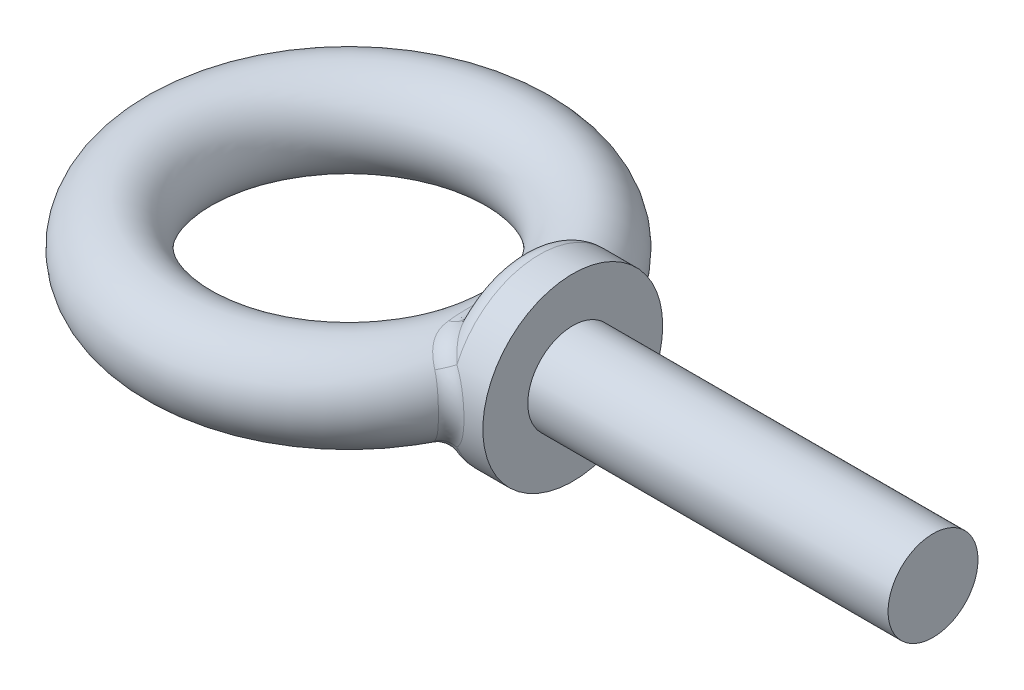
ISO-10303-21;
HEADER;
FILE_DESCRIPTION(('STEP AP214'),'2;1');
FILE_NAME('part.step','',(''),(''),'','','');
FILE_SCHEMA(('AUTOMOTIVE_DESIGN { 1 0 10303 214 1 1 1 1 }'));
ENDSEC;
DATA;
#1=APPLICATION_CONTEXT('core data for automotive mechanical design processes');
#2=APPLICATION_PROTOCOL_DEFINITION('international standard','automotive_design',2000,#1);
#3=PRODUCT_CONTEXT('',#1,'mechanical');
#4=PRODUCT('Part','Part','',(#3));
#5=PRODUCT_RELATED_PRODUCT_CATEGORY('part','',(#4));
#6=PRODUCT_DEFINITION_FORMATION('','',#4);
#7=PRODUCT_DEFINITION_CONTEXT('part definition',#1,'design');
#8=PRODUCT_DEFINITION('design','',#6,#7);
#9=PRODUCT_DEFINITION_SHAPE('','',#8);
#10=(LENGTH_UNIT() NAMED_UNIT(*) SI_UNIT(.MILLI.,.METRE.));
#11=(NAMED_UNIT(*) PLANE_ANGLE_UNIT() SI_UNIT($,.RADIAN.));
#12=(NAMED_UNIT(*) SI_UNIT($,.STERADIAN.) SOLID_ANGLE_UNIT());
#13=UNCERTAINTY_MEASURE_WITH_UNIT(LENGTH_MEASURE(1.E-05),#10,'distance_accuracy_value','');
#14=(GEOMETRIC_REPRESENTATION_CONTEXT(3) GLOBAL_UNCERTAINTY_ASSIGNED_CONTEXT((#13)) GLOBAL_UNIT_ASSIGNED_CONTEXT((#10,
#11,#12)) REPRESENTATION_CONTEXT('',''));
#15=CARTESIAN_POINT('',(0.,0.,0.));
#16=DIRECTION('',(0.,0.,1.));
#17=DIRECTION('',(1.,0.,0.));
#18=AXIS2_PLACEMENT_3D('',#15,#16,#17);
#19=CARTESIAN_POINT('',(0.,0.,0.));
#20=DIRECTION('',(0.,-1.,0.));
#21=DIRECTION('',(0.,0.,-1.));
#22=AXIS2_PLACEMENT_3D('',#19,#20,#21);
#23=TOROIDAL_SURFACE('',#22,11.938,3.175);
#24=CARTESIAN_POINT('',(11.1610620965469,-3.12888149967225,2.3159379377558));
#25=CARTESIAN_POINT('',(12.2742228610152,-3.31759631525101,2.34131547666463));
#26=CARTESIAN_POINT('',(12.2178033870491,-4.44494903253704,2.30558198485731));
#27=CARTESIAN_POINT('',(11.1550049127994,-3.13049728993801,2.39137238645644));
#28=CARTESIAN_POINT('',(12.2580789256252,-3.31364392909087,2.4090312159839));
#29=CARTESIAN_POINT('',(12.2167584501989,-4.43058549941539,2.37285607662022));
#30=CARTESIAN_POINT('',(11.1492563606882,-3.13225133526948,2.46665818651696));
#31=CARTESIAN_POINT('',(12.2424309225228,-3.30955939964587,2.47622807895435));
#32=CARTESIAN_POINT('',(12.216066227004,-4.41609323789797,2.43912467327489));
#33=CARTESIAN_POINT('',(11.138682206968,-3.13599384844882,2.61685483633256));
#34=CARTESIAN_POINT('',(12.2126312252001,-3.30113921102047,2.60895289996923));
#35=CARTESIAN_POINT('',(12.2155757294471,-4.38699003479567,2.56971458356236));
#36=CARTESIAN_POINT('',(11.1338569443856,-3.13798240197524,2.69176553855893));
#37=CARTESIAN_POINT('',(12.1984603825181,-3.29680334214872,2.67452759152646));
#38=CARTESIAN_POINT('',(12.2157777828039,-4.37237905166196,2.63403517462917));
#39=CARTESIAN_POINT('',(11.1212041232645,-3.14424822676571,2.91622032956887));
#40=CARTESIAN_POINT('',(12.1587370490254,-3.28340881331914,2.86849597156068));
#41=CARTESIAN_POINT('',(12.2180140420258,-4.32849758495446,2.82450907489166));
#42=CARTESIAN_POINT('',(11.115242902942,-3.14881461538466,3.06499573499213));
#43=CARTESIAN_POINT('',(12.1356547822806,-3.27388280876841,2.99546943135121));
#44=CARTESIAN_POINT('',(12.2216876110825,-4.29927375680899,2.94773799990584));
#45=CARTESIAN_POINT('',(11.1106535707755,-3.15792128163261,3.36031163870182));
#46=CARTESIAN_POINT('',(12.0983593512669,-3.25327621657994,3.24344533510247));
#47=CARTESIAN_POINT('',(12.2348070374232,-4.24115456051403,3.18774561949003));
#48=CARTESIAN_POINT('',(11.112084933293,-3.1624610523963,3.50682446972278));
#49=CARTESIAN_POINT('',(12.0840530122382,-3.24216982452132,3.36485647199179));
#50=CARTESIAN_POINT('',(12.2442991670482,-4.21226373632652,3.30446433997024));
#51=CARTESIAN_POINT('',(11.1244477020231,-3.17001255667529,3.79447237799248));
#52=CARTESIAN_POINT('',(12.0651508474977,-3.21791339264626,3.60001973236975));
#53=CARTESIAN_POINT('',(12.2701022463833,-4.15458278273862,3.5306662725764));
#54=CARTESIAN_POINT('',(11.1353647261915,-3.17302659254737,3.93561525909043));
#55=CARTESIAN_POINT('',(12.0604285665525,-3.2047525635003,3.71416337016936));
#56=CARTESIAN_POINT('',(12.286402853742,-4.12579256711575,3.64016016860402));
#57=CARTESIAN_POINT('',(11.1632719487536,-3.17524147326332,4.17139015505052));
#58=CARTESIAN_POINT('',(12.0603354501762,-3.17993112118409,3.9031486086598));
#59=CARTESIAN_POINT('',(12.320557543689,-4.07541720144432,3.82195073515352));
#60=CARTESIAN_POINT('',(11.1776219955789,-3.17528809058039,4.26775078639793));
#61=CARTESIAN_POINT('',(12.0626434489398,-3.16893552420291,3.97985867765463));
#62=CARTESIAN_POINT('',(12.336624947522,-4.05413405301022,3.89590841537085));
#63=CARTESIAN_POINT('',(11.2119675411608,-3.17286317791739,4.45632816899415));
#64=CARTESIAN_POINT('',(12.071720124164,-3.14540913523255,4.12932373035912));
#65=CARTESIAN_POINT('',(12.3724444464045,-4.0102976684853,4.04050564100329));
#66=CARTESIAN_POINT('',(11.2319640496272,-3.170391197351,4.5485441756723));
#67=CARTESIAN_POINT('',(12.0784749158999,-3.13287699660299,4.20213831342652));
#68=CARTESIAN_POINT('',(12.39219720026,-3.98774420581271,4.11114459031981));
#69=CARTESIAN_POINT('',(11.2774477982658,-3.16219545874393,4.72784056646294));
#70=CARTESIAN_POINT('',(12.0961013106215,-3.10615833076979,4.34351848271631));
#71=CARTESIAN_POINT('',(12.4351294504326,-3.94080638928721,4.24880626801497));
#72=CARTESIAN_POINT('',(11.3029101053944,-3.15648627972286,4.81494205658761));
#73=CARTESIAN_POINT('',(12.1069420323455,-3.09198244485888,4.41213031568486));
#74=CARTESIAN_POINT('',(12.4582932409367,-3.91643066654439,4.31584374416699));
#75=CARTESIAN_POINT('',(11.3591074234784,-3.14115000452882,4.98400643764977));
#76=CARTESIAN_POINT('',(12.1324534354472,-3.06173718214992,4.54561338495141));
#77=CARTESIAN_POINT('',(12.5078308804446,-3.8651035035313,4.44664780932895));
#78=CARTESIAN_POINT('',(11.3898441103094,-3.13152166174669,5.06596768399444));
#79=CARTESIAN_POINT('',(12.1471112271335,-3.04567500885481,4.61048974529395));
#80=CARTESIAN_POINT('',(12.5342057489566,-3.83815124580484,4.51041335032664));
#81=CARTESIAN_POINT('',(11.4571387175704,-3.10741686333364,5.22677179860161));
#82=CARTESIAN_POINT('',(12.1805121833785,-3.01090538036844,4.73859990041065));
#83=CARTESIAN_POINT('',(12.5906242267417,-3.78021786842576,4.63651098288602));
#84=CARTESIAN_POINT('',(11.4938468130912,-3.09280017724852,5.30544078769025));
#85=CARTESIAN_POINT('',(12.1993490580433,-2.99214445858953,4.80171836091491));
#86=CARTESIAN_POINT('',(12.6207558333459,-3.74913820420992,4.69873838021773));
#87=CARTESIAN_POINT('',(11.57169697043,-3.05833828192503,5.45656801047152));
#88=CARTESIAN_POINT('',(12.2406057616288,-2.95204615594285,4.92437438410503));
#89=CARTESIAN_POINT('',(12.6835038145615,-3.68310246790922,4.81956633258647));
#90=CARTESIAN_POINT('',(11.6128409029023,-3.03849086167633,5.52902360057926));
#91=CARTESIAN_POINT('',(12.2630005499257,-2.93072974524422,4.98389040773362));
#92=CARTESIAN_POINT('',(12.7161212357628,-3.64814476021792,4.87816534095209));
#93=CARTESIAN_POINT('',(11.6987792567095,-2.99326619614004,5.66749616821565));
#94=CARTESIAN_POINT('',(12.3111693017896,-2.88512177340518,5.09950112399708));
#95=CARTESIAN_POINT('',(12.7832823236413,-3.57395593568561,4.99163487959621));
#96=CARTESIAN_POINT('',(11.7435757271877,-2.96788583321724,5.73350948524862));
#97=CARTESIAN_POINT('',(12.3369131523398,-2.86085778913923,5.15557160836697));
#98=CARTESIAN_POINT('',(12.8178270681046,-3.53472241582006,5.04650328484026));
#99=CARTESIAN_POINT('',(11.8359309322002,-2.91149485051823,5.8589226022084));
#100=CARTESIAN_POINT('',(12.3915117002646,-2.80893263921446,5.26431451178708));
#101=CARTESIAN_POINT('',(12.8882329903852,-3.45176353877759,5.15237079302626));
#102=CARTESIAN_POINT('',(11.8834906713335,-2.8804821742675,5.91831997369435));
#103=CARTESIAN_POINT('',(12.4203324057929,-2.78130599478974,5.31696721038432));
#104=CARTESIAN_POINT('',(12.9240946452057,-3.40803654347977,5.20336847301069));
#105=CARTESIAN_POINT('',(12.018832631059,-2.7860852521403,6.0747567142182));
#106=CARTESIAN_POINT('',(12.5044931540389,-2.69901107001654,5.45880503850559));
#107=CARTESIAN_POINT('',(13.0251851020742,-3.2795385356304,5.34014302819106));
#108=CARTESIAN_POINT('',(12.1087254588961,-2.71647444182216,6.16449053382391));
#109=CARTESIAN_POINT('',(12.5630002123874,-2.64005350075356,5.54456177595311));
#110=CARTESIAN_POINT('',(13.0912458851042,-3.18961921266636,5.4215899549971));
#111=CARTESIAN_POINT('',(12.2895124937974,-2.56044659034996,6.3229717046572));
#112=CARTESIAN_POINT('',(12.6864525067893,-2.50746108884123,5.70430975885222));
#113=CARTESIAN_POINT('',(13.2224578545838,-2.9951100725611,5.5714071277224));
#114=CARTESIAN_POINT('',(12.3804073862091,-2.47401727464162,6.39170363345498));
#115=CARTESIAN_POINT('',(12.7512426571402,-2.43408122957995,5.77832922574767));
#116=CARTESIAN_POINT('',(13.2876083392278,-2.89050955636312,5.63976775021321));
#117=CARTESIAN_POINT('',(12.5608961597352,-2.28411449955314,6.51094704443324));
#118=CARTESIAN_POINT('',(12.885176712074,-2.26948214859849,5.91508015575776));
#119=CARTESIAN_POINT('',(13.4157465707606,-2.66478599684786,5.76499199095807));
#120=CARTESIAN_POINT('',(12.6504066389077,-2.18028216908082,6.56098232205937));
#121=CARTESIAN_POINT('',(12.9543372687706,-2.17810882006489,5.97766025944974));
#122=CARTESIAN_POINT('',(13.4786450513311,-2.54332702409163,5.82154076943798));
#123=CARTESIAN_POINT('',(12.7786864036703,-2.01506371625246,6.62225897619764));
#124=CARTESIAN_POINT('',(13.0569976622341,-2.02838622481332,6.06098314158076));
#125=CARTESIAN_POINT('',(13.5680858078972,-2.35148922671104,5.89646025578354));
#126=CARTESIAN_POINT('',(12.820427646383,-1.95844584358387,6.64038238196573));
#127=CARTESIAN_POINT('',(13.0908626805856,-1.9766748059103,6.0868923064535));
#128=CARTESIAN_POINT('',(13.5970671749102,-2.28597321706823,5.9197728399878));
#129=CARTESIAN_POINT('',(12.901503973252,-1.84233681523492,6.67246133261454));
#130=CARTESIAN_POINT('',(13.1575551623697,-1.8693454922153,6.13517713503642));
#131=CARTESIAN_POINT('',(13.6531552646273,-2.15185226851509,5.96324768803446));
#132=CARTESIAN_POINT('',(12.9408401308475,-1.78284696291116,6.68641874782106));
#133=CARTESIAN_POINT('',(13.1903964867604,-1.81374254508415,6.15758142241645));
#134=CARTESIAN_POINT('',(13.6802628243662,-2.08324873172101,5.98341136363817));
#135=CARTESIAN_POINT('',(12.9787775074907,-1.72204367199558,6.6985044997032));
#136=CARTESIAN_POINT('',(13.2225568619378,-1.75604142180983,6.17831039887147));
#137=CARTESIAN_POINT('',(13.7063200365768,-2.01314369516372,6.00207834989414));
#138=(BOUNDED_SURFACE() B_SPLINE_SURFACE(3,2,((#24,#25,#26),(#27,#28,#29),(#30,#31,#32),(#33,
#34,#35),(#36,#37,#38),(#39,#40,#41),(#42,#43,#44),(#45,#46,#47),(#48,#49,#50),(#51,#52,#53),
(#54,#55,#56),(#57,#58,#59),(#60,#61,#62),(#63,#64,#65),(#66,#67,#68),(#69,#70,#71),(#72,#73,
#74),(#75,#76,#77),(#78,#79,#80),(#81,#82,#83),(#84,#85,#86),(#87,#88,#89),(#90,#91,#92),(#93,
#94,#95),(#96,#97,#98),(#99,#100,#101),(#102,#103,#104),(#105,#106,#107),(#108,#109,#110),(#111,
#112,#113),(#114,#115,#116),(#117,#118,#119),(#120,#121,#122),(#123,#124,#125),(#126,#127,#128),
(#129,#130,#131),(#132,#133,#134),(#135,#136,#137)),.UNSPECIFIED.,.F.,.F.,
.F.) B_SPLINE_SURFACE_WITH_KNOTS((4,2,2,2,2,2,2,2,2,2,2,2,2,2,2,2,2,2,4),(3,3),(0.,
0.224607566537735,0.449297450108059,0.90013616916,1.35460757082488,1.80839110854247,
2.13201504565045,2.45569689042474,2.77793245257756,3.10027059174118,3.4325399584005,
3.76494999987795,4.09754783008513,4.43026734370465,5.02567434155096,5.62151752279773,
6.23164222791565,6.5363741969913,6.84096914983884),(0.,1.),
.UNSPECIFIED.) GEOMETRIC_REPRESENTATION_ITEM() RATIONAL_B_SPLINE_SURFACE(((1.,0.747280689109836,
1.),(1.,0.750527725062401,1.),(1.,0.753704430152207,1.),(1.,0.759866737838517,1.),(1.,
0.762852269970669,1.),(1.,0.771461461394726,1.),(1.,0.776715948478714,1.),(1.,0.786105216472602,
1.),(1.,0.790230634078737,1.),(1.,0.797400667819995,1.),(1.,0.800446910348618,1.),(1.,
0.805008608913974,1.),(1.,0.806712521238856,1.),(1.,0.809877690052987,1.),(1.,0.811338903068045,
1.),(1.,0.814160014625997,1.),(1.,0.815520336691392,1.),(1.,0.818280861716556,1.),(1.,
0.819681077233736,1.),(1.,0.82267382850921,1.),(1.,0.824270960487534,1.),(1.,0.82770282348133,
1.),(1.,0.82953765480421,1.),(1.,0.833488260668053,1.),(1.,0.835604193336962,1.),(1.,
0.840122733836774,1.),(1.,0.842525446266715,1.),(1.,0.849605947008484,1.),(1.,0.854582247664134,
1.),(1.,0.865121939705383,1.),(1.,0.870685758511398,1.),(1.,0.882164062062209,1.),(1.,
0.888083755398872,1.),(1.,0.896809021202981,1.),(1.,0.89969020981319,1.),(1.,0.905354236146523,
1.),(1.,0.908137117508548,1.),(1.,0.910848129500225,1.))) REPRESENTATION_ITEM('') SURFACE());
#139=CARTESIAN_POINT('',(12.9787775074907,-1.72204367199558,6.6985044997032));
#140=CARTESIAN_POINT('',(12.9408401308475,-1.78284696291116,6.68641874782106));
#141=CARTESIAN_POINT('',(12.901503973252,-1.84233681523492,6.67246133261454));
#142=CARTESIAN_POINT('',(12.820427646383,-1.95844584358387,6.64038238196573));
#143=CARTESIAN_POINT('',(12.7786864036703,-2.01506371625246,6.62225897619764));
#144=CARTESIAN_POINT('',(12.6504066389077,-2.18028216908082,6.56098232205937));
#145=CARTESIAN_POINT('',(12.5608961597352,-2.28411449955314,6.51094704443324));
#146=CARTESIAN_POINT('',(12.3804073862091,-2.47401727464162,6.39170363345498));
#147=CARTESIAN_POINT('',(12.2895124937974,-2.56044659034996,6.3229717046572));
#148=CARTESIAN_POINT('',(12.1087254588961,-2.71647444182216,6.16449053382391));
#149=CARTESIAN_POINT('',(12.018832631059,-2.7860852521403,6.0747567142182));
#150=CARTESIAN_POINT('',(11.8834906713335,-2.8804821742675,5.91831997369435));
#151=CARTESIAN_POINT('',(11.8359309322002,-2.91149485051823,5.8589226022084));
#152=CARTESIAN_POINT('',(11.7435757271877,-2.96788583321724,5.73350948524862));
#153=CARTESIAN_POINT('',(11.6987792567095,-2.99326619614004,5.66749616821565));
#154=CARTESIAN_POINT('',(11.6128409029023,-3.03849086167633,5.52902360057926));
#155=CARTESIAN_POINT('',(11.57169697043,-3.05833828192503,5.45656801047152));
#156=CARTESIAN_POINT('',(11.4938468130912,-3.09280017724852,5.30544078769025));
#157=CARTESIAN_POINT('',(11.4571387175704,-3.10741686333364,5.22677179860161));
#158=CARTESIAN_POINT('',(11.3898441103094,-3.13152166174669,5.06596768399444));
#159=CARTESIAN_POINT('',(11.3591074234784,-3.14115000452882,4.98400643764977));
#160=CARTESIAN_POINT('',(11.3029101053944,-3.15648627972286,4.81494205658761));
#161=CARTESIAN_POINT('',(11.2774477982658,-3.16219545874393,4.72784056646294));
#162=CARTESIAN_POINT('',(11.2319640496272,-3.170391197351,4.5485441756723));
#163=CARTESIAN_POINT('',(11.2119675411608,-3.17286317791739,4.45632816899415));
#164=CARTESIAN_POINT('',(11.1776219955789,-3.17528809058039,4.26775078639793));
#165=CARTESIAN_POINT('',(11.1632719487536,-3.17524147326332,4.17139015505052));
#166=CARTESIAN_POINT('',(11.1353647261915,-3.17302659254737,3.93561525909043));
#167=CARTESIAN_POINT('',(11.1244477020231,-3.17001255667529,3.79447237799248));
#168=CARTESIAN_POINT('',(11.112084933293,-3.1624610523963,3.50682446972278));
#169=CARTESIAN_POINT('',(11.1106535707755,-3.15792128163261,3.36031163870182));
#170=CARTESIAN_POINT('',(11.115242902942,-3.14881461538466,3.06499573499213));
#171=CARTESIAN_POINT('',(11.1212041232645,-3.14424822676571,2.91622032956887));
#172=CARTESIAN_POINT('',(11.1338569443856,-3.13798240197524,2.69176553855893));
#173=CARTESIAN_POINT('',(11.138682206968,-3.13599384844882,2.61685483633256));
#174=CARTESIAN_POINT('',(11.1492563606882,-3.13225133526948,2.46665818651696));
#175=CARTESIAN_POINT('',(11.1550049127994,-3.13049728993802,2.39137238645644));
#176=CARTESIAN_POINT('',(11.1610620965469,-3.12888149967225,2.3159379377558));
#177=B_SPLINE_CURVE_WITH_KNOTS('',3,(#139,#140,#141,#142,#143,#144,#145,#146,#147,#148,#149,
#150,#151,#152,#153,#154,#155,#156,#157,#158,#159,#160,#161,#162,#163,#164,#165,#166,#167,#168,
#169,#170,#171,#172,#173,#174,#175,#176),.UNSPECIFIED.,.F.,.F.,(4,2,2,2,2,2,2,2,2,2,2,2,2,2,2,2,
2,2,4),(0.,0.304594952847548,0.609326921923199,1.21945162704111,1.81529480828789,
2.41070180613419,2.74342131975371,3.0760191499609,3.40842919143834,3.74069855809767,
4.06303669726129,4.38527225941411,4.7089541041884,5.03257804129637,5.48636157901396,
5.94083298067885,6.39167169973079,6.61636158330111,6.84096914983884),.UNSPECIFIED.);
#178=CARTESIAN_POINT('',(12.6607391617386,-2.164140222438,6.56404399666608));
#179=VERTEX_POINT('',#178);
#180=CARTESIAN_POINT('',(11.1516545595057,-3.17431944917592,4.07324033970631));
#181=VERTEX_POINT('',#180);
#182=EDGE_CURVE('E378',#179,#181,#177,.T.);
#183=ORIENTED_EDGE('',*,*,#182,.F.);
#184=CARTESIAN_POINT('',(11.5227670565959,-2.96508160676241,6.17552646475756));
#185=CARTESIAN_POINT('',(11.6805037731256,-3.01327413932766,5.61475945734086));
#186=CARTESIAN_POINT('',(11.9230284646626,-3.45926187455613,5.32503589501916));
#187=CARTESIAN_POINT('',(11.6008746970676,-2.93644975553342,6.18820808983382));
#188=CARTESIAN_POINT('',(11.7691516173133,-2.98388025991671,5.62987388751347));
#189=CARTESIAN_POINT('',(12.0279459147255,-3.42585804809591,5.34672921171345));
#190=CARTESIAN_POINT('',(11.6769397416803,-2.90474892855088,6.20331419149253));
#191=CARTESIAN_POINT('',(11.8555238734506,-2.95076201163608,5.64671676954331));
#192=CARTESIAN_POINT('',(12.1306309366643,-3.38887374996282,5.37031491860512));
#193=CARTESIAN_POINT('',(11.8245958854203,-2.83543419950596,6.23752607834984));
#194=CARTESIAN_POINT('',(12.0230813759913,-2.87767188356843,5.68306329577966));
#195=CARTESIAN_POINT('',(12.3308201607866,-3.30800656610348,5.42050497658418));
#196=CARTESIAN_POINT('',(11.8961897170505,-2.79782395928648,6.2566293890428));
#197=CARTESIAN_POINT('',(12.1043381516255,-2.83766324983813,5.70258476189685));
#198=CARTESIAN_POINT('',(12.42832752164,-3.26412795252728,5.44710745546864));
#199=CARTESIAN_POINT('',(12.0342387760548,-2.71709764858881,6.29789260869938));
#200=CARTESIAN_POINT('',(12.2607547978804,-2.75150221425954,5.74343481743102));
#201=CARTESIAN_POINT('',(12.6170663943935,-3.16994725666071,5.50244396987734));
#202=CARTESIAN_POINT('',(12.100719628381,-2.674012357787,6.32003548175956));
#203=CARTESIAN_POINT('',(12.3359921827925,-2.70533899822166,5.7647722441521));
#204=CARTESIAN_POINT('',(12.7083289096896,-3.11968108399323,5.53116573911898));
#205=CARTESIAN_POINT('',(12.2287626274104,-2.58249548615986,6.36654256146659));
#206=CARTESIAN_POINT('',(12.4805623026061,-2.60731638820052,5.80856345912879));
#207=CARTESIAN_POINT('',(12.8846980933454,-3.01291140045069,5.5900441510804));
#208=CARTESIAN_POINT('',(12.2903243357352,-2.53406342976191,6.39090696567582));
#209=CARTESIAN_POINT('',(12.5499203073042,-2.55541273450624,5.83103302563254));
#210=CARTESIAN_POINT('',(12.9698042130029,-2.95640733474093,5.6202009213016));
#211=CARTESIAN_POINT('',(12.4624438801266,-2.38554389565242,6.46386047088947));
#212=CARTESIAN_POINT('',(12.7435056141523,-2.39646775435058,5.89715393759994));
#213=CARTESIAN_POINT('',(13.2084584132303,-2.78313454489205,5.70902322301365));
#214=CARTESIAN_POINT('',(12.5663567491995,-2.27870274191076,6.51423733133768));
#215=CARTESIAN_POINT('',(12.8594422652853,-2.28262205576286,5.9412670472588));
#216=CARTESIAN_POINT('',(13.3534664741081,-2.65848653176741,5.76855332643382));
#217=CARTESIAN_POINT('',(12.7555551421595,-2.04905142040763,6.61407947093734));
#218=CARTESIAN_POINT('',(13.0689825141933,-2.04061883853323,6.02633776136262));
#219=CARTESIAN_POINT('',(13.6185853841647,-2.39055998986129,5.88464921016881));
#220=CARTESIAN_POINT('',(12.840807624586,-1.92621353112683,6.66354299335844));
#221=CARTESIAN_POINT('',(13.1624293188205,-1.91227885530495,6.0672852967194));
#222=CARTESIAN_POINT('',(13.7386520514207,-2.24724911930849,5.94120959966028));
#223=CARTESIAN_POINT('',(13.0001250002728,-1.65458917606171,6.76130208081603));
#224=CARTESIAN_POINT('',(13.3358140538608,-1.63193874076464,6.14651146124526));
#225=CARTESIAN_POINT('',(13.9637089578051,-1.93035403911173,6.0520334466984));
#226=CARTESIAN_POINT('',(13.0722473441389,-1.50443776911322,6.80899745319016));
#227=CARTESIAN_POINT('',(13.413175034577,-1.47895520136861,6.18400914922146));
#228=CARTESIAN_POINT('',(14.0660306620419,-1.75517739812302,6.10551543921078));
#229=CARTESIAN_POINT('',(13.193793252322,-1.19242517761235,6.89237635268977));
#230=CARTESIAN_POINT('',(13.5427085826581,-1.16508623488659,6.2484678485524));
#231=CARTESIAN_POINT('',(14.2388362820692,-1.39116270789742,6.19857105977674));
#232=CARTESIAN_POINT('',(13.24327100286,-1.03059303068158,6.9280884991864));
#233=CARTESIAN_POINT('',(13.5946574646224,-1.0044293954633,6.27532663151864));
#234=CARTESIAN_POINT('',(14.3093961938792,-1.20235853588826,6.23817783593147));
#235=CARTESIAN_POINT('',(13.292938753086,-0.815433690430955,6.96462448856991));
#236=CARTESIAN_POINT('',(13.646543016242,-0.793031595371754,6.30250640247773));
#237=CARTESIAN_POINT('',(14.3803084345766,-0.951339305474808,6.27861156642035));
#238=CARTESIAN_POINT('',(13.3033959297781,-0.765392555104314,6.97237864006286));
#239=CARTESIAN_POINT('',(13.6574566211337,-0.743929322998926,6.30825559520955));
#240=CARTESIAN_POINT('',(14.3952458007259,-0.89295798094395,6.28718529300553));
#241=CARTESIAN_POINT('',(13.3451775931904,-0.542674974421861,7.00351888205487));
#242=CARTESIAN_POINT('',(13.7010734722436,-0.52558112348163,6.33131468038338));
#243=CARTESIAN_POINT('',(14.4549467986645,-0.633120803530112,6.32159753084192));
#244=CARTESIAN_POINT('',(13.3656664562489,-0.366656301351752,7.01925430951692));
#245=CARTESIAN_POINT('',(13.7221512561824,-0.354932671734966,6.34269983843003));
#246=CARTESIAN_POINT('',(14.484277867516,-0.427765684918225,6.33892980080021));
#247=CARTESIAN_POINT('',(13.3827644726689,-0.012498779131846,7.03235584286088));
#248=CARTESIAN_POINT('',(13.7398130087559,-0.0118873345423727,6.35222509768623));
#249=CARTESIAN_POINT('',(14.5087512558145,-0.0145819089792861,6.35336429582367));
#250=CARTESIAN_POINT('',(13.3793130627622,0.165644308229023,7.02967536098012));
#251=CARTESIAN_POINT('',(13.7362771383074,0.159949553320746,6.35030043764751));
#252=CARTESIAN_POINT('',(14.5038068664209,0.193251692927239,6.35041521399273));
#253=CARTESIAN_POINT('',(13.3484594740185,0.518478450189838,7.00614743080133));
#254=CARTESIAN_POINT('',(13.7043548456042,0.502333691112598,6.33314529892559));
#255=CARTESIAN_POINT('',(14.4596578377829,0.604891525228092,6.32447995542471));
#256=CARTESIAN_POINT('',(13.3210856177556,0.693173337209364,6.98532146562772));
#257=CARTESIAN_POINT('',(13.676100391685,0.672336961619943,6.31798558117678));
#258=CARTESIAN_POINT('',(14.4204937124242,0.808702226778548,6.3015174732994));
#259=CARTESIAN_POINT('',(13.2424906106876,1.03429961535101,6.92752235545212));
#260=CARTESIAN_POINT('',(13.593837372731,1.00803587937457,6.27490107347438));
#261=CARTESIAN_POINT('',(14.3082828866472,1.20668288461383,6.23755038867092));
#262=CARTESIAN_POINT('',(13.1912794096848,1.20073442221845,6.89055594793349));
#263=CARTESIAN_POINT('',(13.5400775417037,1.17330630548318,6.24710265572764));
#264=CARTESIAN_POINT('',(14.2352503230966,1.4008568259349,6.19655331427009));
#265=CARTESIAN_POINT('',(13.0647613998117,1.521635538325,6.80396633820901));
#266=CARTESIAN_POINT('',(13.4051835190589,1.49632933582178,6.18009311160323));
#267=CARTESIAN_POINT('',(14.0554006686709,1.77524146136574,6.09988522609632));
#268=CARTESIAN_POINT('',(12.9893374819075,1.67603905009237,6.75428186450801));
#269=CARTESIAN_POINT('',(13.3242288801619,1.6538191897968,6.14096617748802));
#270=CARTESIAN_POINT('',(13.948419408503,1.95537889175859,6.04414313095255));
#271=CARTESIAN_POINT('',(12.8143371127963,1.96771726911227,6.64777502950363));
#272=CARTESIAN_POINT('',(13.1335886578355,1.95521192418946,6.05440244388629));
#273=CARTESIAN_POINT('',(13.7013192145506,2.29567014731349,5.92325350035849));
#274=CARTESIAN_POINT('',(12.7147732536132,2.10500085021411,6.59095639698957));
#275=CARTESIAN_POINT('',(13.024210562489,2.09914480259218,6.00706384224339));
#276=CARTESIAN_POINT('',(13.5612175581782,2.4558343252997,5.85811087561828));
#277=CARTESIAN_POINT('',(12.5477876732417,2.29459517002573,6.50606433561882));
#278=CARTESIAN_POINT('',(12.838340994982,2.30002599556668,5.93380108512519));
#279=CARTESIAN_POINT('',(13.3276703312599,2.67702769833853,5.75869630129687));
#280=CARTESIAN_POINT('',(12.4893524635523,2.35494179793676,6.47789243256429));
#281=CARTESIAN_POINT('',(12.7731502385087,2.36419227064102,5.90913871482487));
#282=CARTESIAN_POINT('',(13.246153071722,2.74743209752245,5.72535945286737));
#283=CARTESIAN_POINT('',(12.3665604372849,2.46996539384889,6.42264243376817));
#284=CARTESIAN_POINT('',(12.6356324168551,2.48683259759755,5.85990532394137));
#285=CARTESIAN_POINT('',(13.0754266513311,2.88162629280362,5.65900270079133));
#286=CARTESIAN_POINT('',(12.3022046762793,2.52464336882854,6.39556414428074));
#287=CARTESIAN_POINT('',(12.5633048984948,2.54535326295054,5.83532399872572));
#288=CARTESIAN_POINT('',(12.9862188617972,2.94541726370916,5.62598274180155));
#289=CARTESIAN_POINT('',(12.1674227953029,2.62806389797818,6.34351993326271));
#290=CARTESIAN_POINT('',(12.4113908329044,2.65609147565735,5.78707720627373));
#291=CARTESIAN_POINT('',(12.8000934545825,3.06607454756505,5.56115122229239));
#292=CARTESIAN_POINT('',(12.0969744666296,2.67678302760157,6.31856245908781));
#293=CARTESIAN_POINT('',(12.3317524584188,2.70833919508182,5.76339739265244));
#294=CARTESIAN_POINT('',(12.7031477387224,3.12291353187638,5.52934474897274));
#295=CARTESIAN_POINT('',(11.9504074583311,2.76770066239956,6.27200661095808));
#296=CARTESIAN_POINT('',(12.1658429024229,2.80554514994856,5.71803631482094));
#297=CARTESIAN_POINT('',(12.5023203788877,3.22898410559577,5.46808205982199));
#298=CARTESIAN_POINT('',(11.8742842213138,2.80989384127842,6.25041098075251));
#299=CARTESIAN_POINT('',(12.0795148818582,2.85055478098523,5.69633333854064));
#300=CARTESIAN_POINT('',(12.3984331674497,3.27820948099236,5.43862777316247));
#301=CARTESIAN_POINT('',(11.7954750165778,2.84861323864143,6.23108334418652));
#302=CARTESIAN_POINT('',(11.9899846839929,2.89155264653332,5.67611201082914));
#303=CARTESIAN_POINT('',(12.2913925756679,3.32338211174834,5.41088082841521));
#304=(BOUNDED_SURFACE() B_SPLINE_SURFACE(3,2,((#184,#185,#186),(#187,#188,#189),(#190,#191,
#192),(#193,#194,#195),(#196,#197,#198),(#199,#200,#201),(#202,#203,#204),(#205,#206,#207),
(#208,#209,#210),(#211,#212,#213),(#214,#215,#216),(#217,#218,#219),(#220,#221,#222),(#223,#224,
#225),(#226,#227,#228),(#229,#230,#231),(#232,#233,#234),(#235,#236,#237),(#238,#239,#240),
(#241,#242,#243),(#244,#245,#246),(#247,#248,#249),(#250,#251,#252),(#253,#254,#255),(#256,#257,
#258),(#259,#260,#261),(#262,#263,#264),(#265,#266,#267),(#268,#269,#270),(#271,#272,#273),
(#274,#275,#276),(#277,#278,#279),(#280,#281,#282),(#283,#284,#285),(#286,#287,#288),(#289,#290,
#291),(#292,#293,#294),(#295,#296,#297),(#298,#299,#300),(#301,#302,#303)),.UNSPECIFIED.,.F.,
.F.,.F.) B_SPLINE_SURFACE_WITH_KNOTS((4,2,2,2,2,2,2,2,2,2,2,2,2,2,2,2,2,2,2,4),(3,3),(0.,
0.345715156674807,0.691216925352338,1.03485582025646,1.37852530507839,2.03630341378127,
2.6952369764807,3.41939130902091,4.14180363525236,4.35888386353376,5.10197696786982,
5.84695060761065,6.59104344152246,7.33482596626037,8.0822615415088,8.82930807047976,
9.20099188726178,9.57260956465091,9.94564409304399,10.3189814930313),(0.,1.),
.UNSPECIFIED.) GEOMETRIC_REPRESENTATION_ITEM() RATIONAL_B_SPLINE_SURFACE(((1.,0.908403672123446,
1.),(1.,0.908284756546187,1.),(1.,0.907930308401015,1.),(1.,0.906817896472,1.),(1.,
0.906060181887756,1.),(1.,0.904213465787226,1.),(1.,0.903126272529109,1.),(1.,0.900691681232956,
1.),(1.,0.899344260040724,1.),(1.,0.895141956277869,1.),(1.,0.892034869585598,1.),(1.,
0.885610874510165,1.),(1.,0.882293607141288,1.),(1.,0.875563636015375,1.),(1.,0.872173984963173,
1.),(1.,0.866145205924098,1.),(1.,0.863504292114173,1.),(1.,0.860777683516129,1.),(1.,
0.860196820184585,1.),(1.,0.857858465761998,1.),(1.,0.856660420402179,1.),(1.,0.855663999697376,
1.),(1.,0.855869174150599,1.),(1.,0.857654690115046,1.),(1.,0.859233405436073,1.),(1.,
0.863546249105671,1.),(1.,0.86627989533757,1.),(1.,0.872534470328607,1.),(1.,0.876059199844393,
1.),(1.,0.883364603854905,1.),(1.,0.887145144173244,1.),(1.,0.892513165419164,1.),(1.,
0.894248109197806,1.),(1.,0.897535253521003,1.),(1.,0.899087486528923,1.),(1.,0.901923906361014,
1.),(1.,0.903207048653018,1.),(1.,0.905407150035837,1.),(1.,0.906323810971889,1.),(1.,
0.907010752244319,1.))) REPRESENTATION_ITEM('') SURFACE());
#305=CARTESIAN_POINT('',(11.5227670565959,-2.96508160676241,6.17552646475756));
#306=CARTESIAN_POINT('',(11.6008746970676,-2.93644975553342,6.18820808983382));
#307=CARTESIAN_POINT('',(11.6769397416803,-2.90474892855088,6.20331419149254));
#308=CARTESIAN_POINT('',(11.8245958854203,-2.83543419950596,6.23752607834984));
#309=CARTESIAN_POINT('',(11.8961897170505,-2.79782395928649,6.2566293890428));
#310=CARTESIAN_POINT('',(12.0342387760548,-2.71709764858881,6.29789260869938));
#311=CARTESIAN_POINT('',(12.100719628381,-2.674012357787,6.32003548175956));
#312=CARTESIAN_POINT('',(12.2287626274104,-2.58249548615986,6.36654256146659));
#313=CARTESIAN_POINT('',(12.2903243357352,-2.53406342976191,6.39090696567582));
#314=CARTESIAN_POINT('',(12.4624438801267,-2.38554389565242,6.46386047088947));
#315=CARTESIAN_POINT('',(12.5663567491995,-2.27870274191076,6.51423733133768));
#316=CARTESIAN_POINT('',(12.7555551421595,-2.04905142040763,6.61407947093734));
#317=CARTESIAN_POINT('',(12.840807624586,-1.92621353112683,6.66354299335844));
#318=CARTESIAN_POINT('',(13.0001250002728,-1.6545891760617,6.76130208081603));
#319=CARTESIAN_POINT('',(13.0722473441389,-1.50443776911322,6.80899745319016));
#320=CARTESIAN_POINT('',(13.193793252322,-1.19242517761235,6.89237635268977));
#321=CARTESIAN_POINT('',(13.24327100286,-1.03059303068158,6.9280884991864));
#322=CARTESIAN_POINT('',(13.292938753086,-0.815433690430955,6.96462448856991));
#323=CARTESIAN_POINT('',(13.3033959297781,-0.765392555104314,6.97237864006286));
#324=CARTESIAN_POINT('',(13.3451775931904,-0.54267497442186,7.00351888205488));
#325=CARTESIAN_POINT('',(13.3656664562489,-0.366656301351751,7.01925430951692));
#326=CARTESIAN_POINT('',(13.3827644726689,-0.0124987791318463,7.03235584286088));
#327=CARTESIAN_POINT('',(13.3793130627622,0.165644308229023,7.02967536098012));
#328=CARTESIAN_POINT('',(13.3484594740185,0.518478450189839,7.00614743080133));
#329=CARTESIAN_POINT('',(13.3210856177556,0.693173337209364,6.98532146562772));
#330=CARTESIAN_POINT('',(13.2424906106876,1.03429961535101,6.92752235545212));
#331=CARTESIAN_POINT('',(13.1912794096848,1.20073442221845,6.89055594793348));
#332=CARTESIAN_POINT('',(13.0647613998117,1.521635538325,6.80396633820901));
#333=CARTESIAN_POINT('',(12.9893374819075,1.67603905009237,6.75428186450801));
#334=CARTESIAN_POINT('',(12.8143371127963,1.96771726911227,6.64777502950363));
#335=CARTESIAN_POINT('',(12.7147732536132,2.10500085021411,6.59095639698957));
#336=CARTESIAN_POINT('',(12.5477876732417,2.29459517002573,6.50606433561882));
#337=CARTESIAN_POINT('',(12.4893524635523,2.35494179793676,6.47789243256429));
#338=CARTESIAN_POINT('',(12.3665604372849,2.46996539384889,6.42264243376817));
#339=CARTESIAN_POINT('',(12.3022046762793,2.52464336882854,6.39556414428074));
#340=CARTESIAN_POINT('',(12.1674227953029,2.62806389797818,6.34351993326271));
#341=CARTESIAN_POINT('',(12.0969744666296,2.67678302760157,6.31856245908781));
#342=CARTESIAN_POINT('',(11.9504074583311,2.76770066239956,6.27200661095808));
#343=CARTESIAN_POINT('',(11.8742842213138,2.80989384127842,6.25041098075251));
#344=CARTESIAN_POINT('',(11.7954750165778,2.84861323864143,6.23108334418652));
#345=B_SPLINE_CURVE_WITH_KNOTS('',3,(#305,#306,#307,#308,#309,#310,#311,#312,#313,#314,#315,
#316,#317,#318,#319,#320,#321,#322,#323,#324,#325,#326,#327,#328,#329,#330,#331,#332,#333,#334,
#335,#336,#337,#338,#339,#340,#341,#342,#343,#344),.UNSPECIFIED.,.F.,.F.,(4,2,2,2,2,2,2,2,2,2,2,
2,2,2,2,2,2,2,2,4),(0.,0.345715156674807,0.691216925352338,1.03485582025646,1.37852530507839,
2.03630341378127,2.6952369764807,3.41939130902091,4.14180363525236,4.35888386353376,
5.10197696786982,5.84695060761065,6.59104344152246,7.33482596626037,8.0822615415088,
8.82930807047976,9.20099188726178,9.57260956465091,9.94564409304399,10.3189814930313),.UNSPECIFIED.);
#346=CARTESIAN_POINT('',(12.6607391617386,2.164140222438,6.56404399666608));
#347=VERTEX_POINT('',#346);
#348=EDGE_CURVE('E147',#179,#347,#345,.T.);
#349=ORIENTED_EDGE('',*,*,#348,.T.);
#350=CARTESIAN_POINT('',(13.2268904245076,1.25863028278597,6.75700792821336));
#351=CARTESIAN_POINT('',(13.4377956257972,1.30579080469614,6.29939711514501));
#352=CARTESIAN_POINT('',(13.8754609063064,1.47800355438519,6.11256926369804));
#353=CARTESIAN_POINT('',(13.189630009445,1.34139555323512,6.75140624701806));
#354=CARTESIAN_POINT('',(13.4045552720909,1.38848005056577,6.28342388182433));
#355=CARTESIAN_POINT('',(13.85025239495,1.57391301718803,6.09775162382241));
#356=CARTESIAN_POINT('',(13.1493653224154,1.42267234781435,6.7438378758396));
#357=CARTESIAN_POINT('',(13.3690831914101,1.46838747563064,6.26506719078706));
#358=CARTESIAN_POINT('',(13.8229231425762,1.66783104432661,6.08090754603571));
#359=CARTESIAN_POINT('',(13.0636074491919,1.58177397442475,6.72377456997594));
#360=CARTESIAN_POINT('',(13.294620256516,1.62281345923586,6.22328348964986));
#361=CARTESIAN_POINT('',(13.7644737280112,1.85144662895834,6.04281731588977));
#362=CARTESIAN_POINT('',(13.0181095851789,1.65959563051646,6.71127520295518));
#363=CARTESIAN_POINT('',(13.2555770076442,1.69734207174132,6.19980301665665));
#364=CARTESIAN_POINT('',(13.7333501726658,1.94114030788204,6.02156721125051));
#365=CARTESIAN_POINT('',(12.9226067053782,1.81136552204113,6.68032152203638));
#366=CARTESIAN_POINT('',(13.1750186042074,1.8406768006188,6.14741467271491));
#367=CARTESIAN_POINT('',(13.667721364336,2.11613159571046,5.97427745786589));
#368=CARTESIAN_POINT('',(12.8725898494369,1.88530272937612,6.6618512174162));
#369=CARTESIAN_POINT('',(13.1334600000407,1.9094560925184,6.11843924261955));
#370=CARTESIAN_POINT('',(13.6332072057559,2.20141667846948,5.94822502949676));
#371=CARTESIAN_POINT('',(12.7690698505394,2.02841786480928,6.61817964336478));
#372=CARTESIAN_POINT('',(13.0491155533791,2.04075800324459,6.05505045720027));
#373=CARTESIAN_POINT('',(13.5614145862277,2.36694833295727,5.89114210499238));
#374=CARTESIAN_POINT('',(12.7155682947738,2.09759793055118,6.59298142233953));
#375=CARTESIAN_POINT('',(13.0063081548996,2.10325229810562,6.0205866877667));
#376=CARTESIAN_POINT('',(13.5241373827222,2.44719716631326,5.86011386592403));
#377=CARTESIAN_POINT('',(12.5677357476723,2.27701197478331,6.51495915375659));
#378=CARTESIAN_POINT('',(12.8903285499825,2.26367548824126,5.92002684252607));
#379=CARTESIAN_POINT('',(13.4205606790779,2.65651468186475,5.76939715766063));
#380=CARTESIAN_POINT('',(12.4709125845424,2.38229423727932,6.45511574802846));
#381=CARTESIAN_POINT('',(12.8173130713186,2.35501125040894,5.84891534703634));
#382=CARTESIAN_POINT('',(13.3521248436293,2.78067301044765,5.70479524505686));
#383=CARTESIAN_POINT('',(12.2751745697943,2.57425466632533,6.31165217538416));
#384=CARTESIAN_POINT('',(12.6761408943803,2.51966866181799,5.69231893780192));
#385=CARTESIAN_POINT('',(13.2121391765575,3.01198199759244,5.56027700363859));
#386=CARTESIAN_POINT('',(12.1762642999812,2.6609697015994,6.22807990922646));
#387=CARTESIAN_POINT('',(12.6081072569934,2.59269820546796,5.60673272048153));
#388=CARTESIAN_POINT('',(13.1405958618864,3.11916624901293,5.48039163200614));
#389=CARTESIAN_POINT('',(11.9845794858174,2.81189765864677,6.03822799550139));
#390=CARTESIAN_POINT('',(12.4823435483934,2.72149803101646,5.42455051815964));
#391=CARTESIAN_POINT('',(12.9998321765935,3.31357419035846,5.30750790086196));
#392=CARTESIAN_POINT('',(11.8917134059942,2.876618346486,5.93256739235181));
#393=CARTESIAN_POINT('',(12.4246058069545,2.77736069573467,5.32827028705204));
#394=CARTESIAN_POINT('',(12.9305984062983,3.40122943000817,5.2148867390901));
#395=CARTESIAN_POINT('',(11.7156549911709,2.9856295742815,5.69738614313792));
#396=CARTESIAN_POINT('',(12.3199410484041,2.87708427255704,5.12345520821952));
#397=CARTESIAN_POINT('',(12.7966778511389,3.56016695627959,5.01571316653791));
#398=CARTESIAN_POINT('',(11.6324556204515,3.0299350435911,5.56788303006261));
#399=CARTESIAN_POINT('',(12.273250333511,2.92070354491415,5.0150589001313));
#400=CARTESIAN_POINT('',(12.7319877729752,3.63146118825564,4.90917100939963));
#401=CARTESIAN_POINT('',(11.4859954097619,3.09728886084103,5.29463585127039));
#402=CARTESIAN_POINT('',(12.1947033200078,2.99639967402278,4.79220600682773));
#403=CARTESIAN_POINT('',(12.6147540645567,3.75587261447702,4.68969290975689));
#404=CARTESIAN_POINT('',(11.4218402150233,3.12144923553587,5.15220517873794));
#405=CARTESIAN_POINT('',(12.1622745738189,3.02888790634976,4.67857843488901));
#406=CARTESIAN_POINT('',(12.561715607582,3.80982141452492,4.57751946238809));
#407=CARTESIAN_POINT('',(11.3107297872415,3.15567787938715,4.84880909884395));
#408=CARTESIAN_POINT('',(12.1097209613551,3.08742495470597,4.43836276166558));
#409=CARTESIAN_POINT('',(12.4658998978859,3.908301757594,4.34166834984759));
#410=CARTESIAN_POINT('',(11.2638200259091,3.16570908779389,4.68779614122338));
#411=CARTESIAN_POINT('',(12.0897282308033,3.11339207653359,4.31175490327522));
#412=CARTESIAN_POINT('',(12.4231498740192,3.95280827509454,4.21796133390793));
#413=CARTESIAN_POINT('',(11.2023618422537,3.17402728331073,4.4104371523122));
#414=CARTESIAN_POINT('',(12.0686396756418,3.15156141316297,4.09298829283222));
#415=CARTESIAN_POINT('',(12.3628659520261,4.02147730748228,4.00529258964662));
#416=CARTESIAN_POINT('',(11.1822359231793,3.17521395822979,4.29844614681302));
#417=CARTESIAN_POINT('',(12.0633710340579,3.16540998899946,4.00423731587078));
#418=CARTESIAN_POINT('',(12.3417620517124,4.04726589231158,3.91952558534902));
#419=CARTESIAN_POINT('',(11.1497665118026,3.17472483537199,4.06901988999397));
#420=CARTESIAN_POINT('',(12.0592853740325,3.19112372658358,3.82132296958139));
#421=CARTESIAN_POINT('',(12.3047397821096,4.09765858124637,3.743147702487));
#422=CARTESIAN_POINT('',(11.1374300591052,3.17304645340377,3.95157981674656));
#423=CARTESIAN_POINT('',(12.0605055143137,3.20299175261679,3.7270195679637));
#424=CARTESIAN_POINT('',(12.2888261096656,4.12226159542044,3.65253252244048));
#425=CARTESIAN_POINT('',(11.1200322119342,3.16806511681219,3.71284629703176));
#426=CARTESIAN_POINT('',(12.0696999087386,3.22502793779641,3.53370584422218));
#427=CARTESIAN_POINT('',(12.2621147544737,4.17110374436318,3.46667023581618));
#428=CARTESIAN_POINT('',(11.1149476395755,3.16476738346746,3.59156639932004));
#429=CARTESIAN_POINT('',(12.0777058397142,3.23520961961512,3.43450845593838));
#430=CARTESIAN_POINT('',(12.2513008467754,4.19534379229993,3.3714388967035));
#431=CARTESIAN_POINT('',(11.1109040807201,3.15752614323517,3.34608287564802));
#432=CARTESIAN_POINT('',(12.1001960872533,3.25424234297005,3.23170946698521));
#433=CARTESIAN_POINT('',(12.2342219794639,4.24395842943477,3.17601708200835));
#434=CARTESIAN_POINT('',(11.1119330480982,3.15358392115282,3.22188547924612));
#435=CARTESIAN_POINT('',(12.1147466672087,3.26310390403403,3.12787152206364));
#436=CARTESIAN_POINT('',(12.2279481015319,4.26833265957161,3.07583674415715));
#437=CARTESIAN_POINT('',(11.1154743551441,3.1497982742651,3.09663012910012));
#438=CARTESIAN_POINT('',(12.1323876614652,3.2714407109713,3.02239270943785));
#439=CARTESIAN_POINT('',(12.2236785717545,4.29302947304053,2.97296477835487));
#440=(BOUNDED_SURFACE() B_SPLINE_SURFACE(3,2,((#350,#351,#352),(#353,#354,#355),(#356,#357,
#358),(#359,#360,#361),(#362,#363,#364),(#365,#366,#367),(#368,#369,#370),(#371,#372,#373),
(#374,#375,#376),(#377,#378,#379),(#380,#381,#382),(#383,#384,#385),(#386,#387,#388),(#389,#390,
#391),(#392,#393,#394),(#395,#396,#397),(#398,#399,#400),(#401,#402,#403),(#404,#405,#406),
(#407,#408,#409),(#410,#411,#412),(#413,#414,#415),(#416,#417,#418),(#419,#420,#421),(#422,#423,
#424),(#425,#426,#427),(#428,#429,#430),(#431,#432,#433),(#434,#435,#436),(#437,#438,#439)),
.UNSPECIFIED.,.F.,.F.,.F.) B_SPLINE_SURFACE_WITH_KNOTS((4,2,2,2,2,2,2,2,2,2,2,2,2,2,4),(3,3),
(0.,0.380512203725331,0.761367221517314,1.14325077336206,1.52496158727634,2.17243505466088,
2.81861066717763,3.44865286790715,4.07823359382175,4.67019343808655,5.26370311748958,
5.64719927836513,6.03104152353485,6.41365419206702,6.79551321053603),(0.,1.),
.UNSPECIFIED.) GEOMETRIC_REPRESENTATION_ITEM() RATIONAL_B_SPLINE_SURFACE(((1.,0.92896122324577,
1.),(1.,0.926187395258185,1.),(1.,0.92321193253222,1.),(1.,0.916945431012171,1.),(1.,
0.913654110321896,1.),(1.,0.906839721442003,1.),(1.,0.903316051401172,1.),(1.,0.896143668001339,
1.),(1.,0.892495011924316,1.),(1.,0.882613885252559,1.),(1.,0.876351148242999,1.),(1.,
0.864254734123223,1.),(1.,0.858420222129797,1.),(1.,0.847744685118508,1.),(1.,0.842882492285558,
1.),(1.,0.834212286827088,1.),(1.,0.830403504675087,1.),(1.,0.823909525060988,1.),(1.,
0.821170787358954,1.),(1.,0.815997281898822,1.),(1.,0.813563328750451,1.),(1.,0.809123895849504,
1.),(1.,0.807271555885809,1.),(1.,0.803093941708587,1.),(1.,0.800768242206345,1.),(1.,
0.795434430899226,1.),(1.,0.792428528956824,1.),(1.,0.785634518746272,1.),(1.,0.781847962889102,
1.),(1.,0.777617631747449,1.))) REPRESENTATION_ITEM('') SURFACE());
#441=CARTESIAN_POINT('',(11.1154743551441,3.1497982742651,3.09663012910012));
#442=CARTESIAN_POINT('',(11.1119330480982,3.15358392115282,3.22188547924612));
#443=CARTESIAN_POINT('',(11.1109040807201,3.15752614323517,3.34608287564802));
#444=CARTESIAN_POINT('',(11.1149476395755,3.16476738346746,3.59156639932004));
#445=CARTESIAN_POINT('',(11.1200322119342,3.16806511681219,3.71284629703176));
#446=CARTESIAN_POINT('',(11.1374300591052,3.17304645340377,3.95157981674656));
#447=CARTESIAN_POINT('',(11.1497665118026,3.17472483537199,4.06901988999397));
#448=CARTESIAN_POINT('',(11.1822359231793,3.17521395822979,4.29844614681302));
#449=CARTESIAN_POINT('',(11.2023618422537,3.17402728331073,4.4104371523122));
#450=CARTESIAN_POINT('',(11.2638200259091,3.16570908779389,4.68779614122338));
#451=CARTESIAN_POINT('',(11.3107297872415,3.15567787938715,4.84880909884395));
#452=CARTESIAN_POINT('',(11.4218402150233,3.12144923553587,5.15220517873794));
#453=CARTESIAN_POINT('',(11.4859954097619,3.09728886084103,5.29463585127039));
#454=CARTESIAN_POINT('',(11.6324556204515,3.0299350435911,5.56788303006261));
#455=CARTESIAN_POINT('',(11.7156549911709,2.9856295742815,5.69738614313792));
#456=CARTESIAN_POINT('',(11.8917134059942,2.876618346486,5.93256739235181));
#457=CARTESIAN_POINT('',(11.9845794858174,2.81189765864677,6.03822799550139));
#458=CARTESIAN_POINT('',(12.1762642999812,2.6609697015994,6.22807990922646));
#459=CARTESIAN_POINT('',(12.2751745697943,2.57425466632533,6.31165217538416));
#460=CARTESIAN_POINT('',(12.4709125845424,2.38229423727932,6.45511574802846));
#461=CARTESIAN_POINT('',(12.5677357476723,2.27701197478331,6.51495915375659));
#462=CARTESIAN_POINT('',(12.7155682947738,2.09759793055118,6.59298142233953));
#463=CARTESIAN_POINT('',(12.7690698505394,2.02841786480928,6.61817964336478));
#464=CARTESIAN_POINT('',(12.8725898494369,1.88530272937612,6.6618512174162));
#465=CARTESIAN_POINT('',(12.9226067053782,1.81136552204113,6.68032152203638));
#466=CARTESIAN_POINT('',(13.0181095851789,1.65959563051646,6.71127520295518));
#467=CARTESIAN_POINT('',(13.0636074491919,1.58177397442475,6.72377456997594));
#468=CARTESIAN_POINT('',(13.1493653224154,1.42267234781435,6.7438378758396));
#469=CARTESIAN_POINT('',(13.189630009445,1.34139555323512,6.75140624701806));
#470=CARTESIAN_POINT('',(13.2268904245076,1.25863028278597,6.75700792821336));
#471=B_SPLINE_CURVE_WITH_KNOTS('',3,(#441,#442,#443,#444,#445,#446,#447,#448,#449,#450,#451,
#452,#453,#454,#455,#456,#457,#458,#459,#460,#461,#462,#463,#464,#465,#466,#467,#468,#469,#470),
.UNSPECIFIED.,.F.,.F.,(4,2,2,2,2,2,2,2,2,2,2,2,2,2,4),(0.,0.381859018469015,0.76447168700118,
1.14831393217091,1.53181009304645,2.12531977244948,2.71727961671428,3.34686034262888,
3.9769025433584,4.62307815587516,5.27055162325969,5.65226243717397,6.03414598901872,
6.4150010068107,6.79551321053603),.UNSPECIFIED.);
#472=CARTESIAN_POINT('',(11.1516545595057,3.17431944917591,4.07324033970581));
#473=VERTEX_POINT('',#472);
#474=EDGE_CURVE('E142',#473,#347,#471,.T.);
#475=ORIENTED_EDGE('',*,*,#474,.F.);
#476=CARTESIAN_POINT('',(11.2764169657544,3.15031197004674,4.99494822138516));
#477=CARTESIAN_POINT('',(12.2772486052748,3.05204128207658,4.66986550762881));
#478=CARTESIAN_POINT('',(12.5773253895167,4.06540665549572,4.66320119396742));
#479=CARTESIAN_POINT('',(11.2518358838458,3.16132727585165,4.83393014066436));
#480=CARTESIAN_POINT('',(12.2377552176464,3.0849564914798,4.52581047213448));
#481=CARTESIAN_POINT('',(12.5257757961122,4.07962165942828,4.50019060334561));
#482=CARTESIAN_POINT('',(11.2283990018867,3.16829168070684,4.6706315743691));
#483=CARTESIAN_POINT('',(12.1981221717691,3.11337075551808,4.37690926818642));
#484=CARTESIAN_POINT('',(12.4756344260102,4.08860906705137,4.33637884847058));
#485=CARTESIAN_POINT('',(11.1840015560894,3.17554013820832,4.33979726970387));
#486=CARTESIAN_POINT('',(12.1203484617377,3.16136522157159,4.07299624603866));
#487=CARTESIAN_POINT('',(12.3788578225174,4.09796303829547,4.00764489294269));
#488=CARTESIAN_POINT('',(11.1630385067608,3.17583095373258,4.17226599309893));
#489=CARTESIAN_POINT('',(12.0821617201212,3.18110376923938,3.91800043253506));
#490=CARTESIAN_POINT('',(12.3322190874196,4.0983383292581,3.84272398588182));
#491=CARTESIAN_POINT('',(11.1237262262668,3.17117023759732,3.83296368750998));
#492=CARTESIAN_POINT('',(12.0081188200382,3.21277225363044,3.60254874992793));
#493=CARTESIAN_POINT('',(12.2430305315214,4.09232378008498,3.51193249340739));
#494=CARTESIAN_POINT('',(11.1053769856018,3.16621872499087,3.66119267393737));
#495=CARTESIAN_POINT('',(11.9721975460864,3.22482804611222,3.44203687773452));
#496=CARTESIAN_POINT('',(12.2004806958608,4.08593396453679,3.34606191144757));
#497=CARTESIAN_POINT('',(11.0713667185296,3.1526162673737,3.31342175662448));
#498=CARTESIAN_POINT('',(11.9035626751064,3.2425300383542,3.11625821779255));
#499=CARTESIAN_POINT('',(12.1200599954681,4.06838029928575,3.01341933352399));
#500=CARTESIAN_POINT('',(11.055706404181,3.14396434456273,3.13742074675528));
#501=CARTESIAN_POINT('',(11.870768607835,3.2482687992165,2.95086648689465));
#502=CARTESIAN_POINT('',(12.0821903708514,4.05721518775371,2.84664711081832));
#503=CARTESIAN_POINT('',(11.0133428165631,3.1152501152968,2.60950393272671));
#504=CARTESIAN_POINT('',(11.7801182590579,3.25799837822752,2.45710247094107));
#505=CARTESIAN_POINT('',(11.9777870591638,4.02016012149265,2.35098538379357));
#506=CARTESIAN_POINT('',(10.9905393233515,3.09222622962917,2.25149610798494));
#507=CARTESIAN_POINT('',(11.7270464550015,3.25542230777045,2.11868657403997));
#508=CARTESIAN_POINT('',(11.918795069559,3.99044831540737,2.02073002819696));
#509=CARTESIAN_POINT('',(10.9642373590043,3.06115147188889,1.70389437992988));
#510=CARTESIAN_POINT('',(11.663838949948,3.24741975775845,1.60121255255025));
#511=CARTESIAN_POINT('',(11.8490037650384,3.95034704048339,1.52257232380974));
#512=CARTESIAN_POINT('',(10.9567887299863,3.05137346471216,1.51967551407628));
#513=CARTESIAN_POINT('',(11.6455017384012,3.24408989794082,1.4277074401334));
#514=CARTESIAN_POINT('',(11.8288606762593,3.93772874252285,1.35612819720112));
#515=CARTESIAN_POINT('',(10.9444991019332,3.03436776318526,1.1483322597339));
#516=CARTESIAN_POINT('',(11.61489901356,3.23765947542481,1.07856397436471));
#517=CARTESIAN_POINT('',(11.7952890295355,3.91578326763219,1.02233424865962));
#518=CARTESIAN_POINT('',(10.9396578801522,3.02713985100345,0.961208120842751));
#519=CARTESIAN_POINT('',(11.6025646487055,3.23455050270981,0.902553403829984));
#520=CARTESIAN_POINT('',(11.7818598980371,3.90645580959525,0.85498450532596));
#521=CARTESIAN_POINT('',(10.9331756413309,3.0172232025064,0.617001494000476));
#522=CARTESIAN_POINT('',(11.5859696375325,3.23013254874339,0.579238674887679));
#523=CARTESIAN_POINT('',(11.7637854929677,3.89365859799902,0.548114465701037));
#524=CARTESIAN_POINT('',(10.9311310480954,3.01397242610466,0.460208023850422));
#525=CARTESIAN_POINT('',(11.5806701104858,3.22860201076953,0.431941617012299));
#526=CARTESIAN_POINT('',(11.7580365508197,3.88946354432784,0.408689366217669));
#527=CARTESIAN_POINT('',(10.928830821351,3.01030473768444,0.146095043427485));
#528=CARTESIAN_POINT('',(11.5747131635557,3.22687188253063,0.13716165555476));
#529=CARTESIAN_POINT('',(11.7515647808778,3.88473047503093,0.129659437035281));
#530=CARTESIAN_POINT('',(10.9285751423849,3.00988775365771,-0.0112244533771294));
#531=CARTESIAN_POINT('',(11.5740453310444,3.22666928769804,-0.0105752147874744));
#532=CARTESIAN_POINT('',(11.7508418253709,3.88419236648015,-0.00994538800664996));
#533=CARTESIAN_POINT('',(10.9298526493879,3.01193643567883,-0.325597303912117));
#534=CARTESIAN_POINT('',(11.5773594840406,3.22764264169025,-0.305572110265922));
#535=CARTESIAN_POINT('',(11.7544406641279,3.88683614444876,-0.289079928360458));
#536=CARTESIAN_POINT('',(10.931386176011,3.01440265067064,-0.482650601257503));
#537=CARTESIAN_POINT('',(11.5813481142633,3.22882055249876,-0.453087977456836));
#538=CARTESIAN_POINT('',(11.7587634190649,3.89001873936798,-0.428609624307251));
#539=CARTESIAN_POINT('',(10.9362443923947,3.0219465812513,-0.795678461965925));
#540=CARTESIAN_POINT('',(11.5938333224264,3.23225429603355,-0.746970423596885));
#541=CARTESIAN_POINT('',(11.7723533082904,3.89975401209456,-0.70730439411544));
#542=CARTESIAN_POINT('',(10.9395691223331,3.02702435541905,-0.951653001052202));
#543=CARTESIAN_POINT('',(11.6023510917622,3.23451557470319,-0.893582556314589));
#544=CARTESIAN_POINT('',(11.781620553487,3.90630676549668,-0.846469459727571));
#545=CARTESIAN_POINT('',(10.9522375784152,3.04542797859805,-1.41692468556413));
#546=CARTESIAN_POINT('',(11.6343805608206,3.242097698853,-1.33165445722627));
#547=CARTESIAN_POINT('',(11.8165643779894,3.93005622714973,-1.26311156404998));
#548=CARTESIAN_POINT('',(10.9642756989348,3.06192451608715,-1.72360215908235));
#549=CARTESIAN_POINT('',(11.6644577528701,3.2482251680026,-1.62099638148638));
#550=CARTESIAN_POINT('',(11.8493834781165,3.95134463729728,-1.53976398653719));
#551=CARTESIAN_POINT('',(10.9956022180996,3.09707422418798,-2.32675545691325));
#552=CARTESIAN_POINT('',(11.738546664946,3.25574298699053,-2.18889125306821));
#553=CARTESIAN_POINT('',(11.9317988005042,3.99670454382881,-2.09035875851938));
#554=CARTESIAN_POINT('',(11.0148944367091,3.11572852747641,-2.62322581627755));
#555=CARTESIAN_POINT('',(11.7829594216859,3.25708348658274,-2.46878712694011));
#556=CARTESIAN_POINT('',(11.9814038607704,4.02077750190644,-2.36429960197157));
#557=CARTESIAN_POINT('',(11.0575470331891,3.14562763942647,-3.16444063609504));
#558=CARTESIAN_POINT('',(11.8750960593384,3.24825737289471,-2.97725140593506));
#559=CARTESIAN_POINT('',(12.0868770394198,4.05936163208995,-2.87170079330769));
#560=CARTESIAN_POINT('',(11.0799639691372,3.15754317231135,-3.41062982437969));
#561=CARTESIAN_POINT('',(11.9218693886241,3.23948701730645,-3.20869232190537));
#562=CARTESIAN_POINT('',(12.1409050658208,4.07473835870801,-3.10547530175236));
#563=CARTESIAN_POINT('',(11.1300356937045,3.17309594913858,-3.89445459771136));
#564=CARTESIAN_POINT('',(12.0207779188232,3.20885640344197,-3.66106247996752));
#565=CARTESIAN_POINT('',(12.2577512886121,4.09480886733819,-3.57104929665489));
#566=CARTESIAN_POINT('',(11.1576844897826,3.17674260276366,-4.13209960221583));
#567=CARTESIAN_POINT('',(12.0731189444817,3.18672147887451,-3.88228653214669));
#568=CARTESIAN_POINT('',(12.3205594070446,4.099514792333,-3.80285072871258));
#569=CARTESIAN_POINT('',(11.2179141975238,3.17165514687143,-4.59874447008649));
#570=CARTESIAN_POINT('',(12.1807852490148,3.12614731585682,-4.31257169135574));
#571=CARTESIAN_POINT('',(12.4532799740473,4.09294954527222,-4.26409365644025));
#572=CARTESIAN_POINT('',(11.2504903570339,3.16293289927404,-4.82775240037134));
#573=CARTESIAN_POINT('',(12.2362474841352,3.08732338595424,-4.52167342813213));
#574=CARTESIAN_POINT('',(12.5231855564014,4.08169368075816,-4.49353720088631));
#575=CARTESIAN_POINT('',(11.3200426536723,3.12946576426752,-5.27730539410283));
#576=CARTESIAN_POINT('',(12.34812201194,2.99151183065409,-4.92656878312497));
#577=CARTESIAN_POINT('',(12.6685160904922,4.03850509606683,-4.94956813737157));
#578=CARTESIAN_POINT('',(11.3570345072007,3.10466216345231,-5.49781629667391));
#579=CARTESIAN_POINT('',(12.404583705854,2.93400120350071,-5.12207722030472));
#580=CARTESIAN_POINT('',(12.7439603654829,4.00649660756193,-5.17614194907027));
#581=CARTESIAN_POINT('',(11.3958351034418,3.06999836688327,-5.71320413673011));
#582=CARTESIAN_POINT('',(12.4592830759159,2.86732754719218,-5.3064292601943));
#583=CARTESIAN_POINT('',(12.821089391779,3.96176375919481,-5.40006909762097));
#584=(BOUNDED_SURFACE() B_SPLINE_SURFACE(3,2,((#476,#477,#478),(#479,#480,#481),(#482,#483,
#484),(#485,#486,#487),(#488,#489,#490),(#491,#492,#493),(#494,#495,#496),(#497,#498,#499),
(#500,#501,#502),(#503,#504,#505),(#506,#507,#508),(#509,#510,#511),(#512,#513,#514),(#515,#516,
#517),(#518,#519,#520),(#521,#522,#523),(#524,#525,#526),(#527,#528,#529),(#530,#531,#532),
(#533,#534,#535),(#536,#537,#538),(#539,#540,#541),(#542,#543,#544),(#545,#546,#547),(#548,#549,
#550),(#551,#552,#553),(#554,#555,#556),(#557,#558,#559),(#560,#561,#562),(#563,#564,#565),
(#566,#567,#568),(#569,#570,#571),(#572,#573,#574),(#575,#576,#577),(#578,#579,#580),(#581,#582,
#583)),.UNSPECIFIED.,.F.,.F.,.F.) B_SPLINE_SURFACE_WITH_KNOTS((4,2,2,2,2,2,2,2,2,2,2,2,2,2,2,2,
2,4),(3,3),(0.,0.558109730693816,1.1156538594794,1.67319596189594,2.23088548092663,
3.32595828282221,3.87303273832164,4.42006045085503,4.87428587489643,5.32849975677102,
5.78280013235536,6.23711069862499,7.14563941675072,8.05464723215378,8.83680014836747,
9.61806255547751,10.3985762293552,11.1819557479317),(0.,1.),
.UNSPECIFIED.) GEOMETRIC_REPRESENTATION_ITEM() RATIONAL_B_SPLINE_SURFACE(((1.,0.768653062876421,
1.),(1.,0.775006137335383,1.),(1.,0.781298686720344,1.),(1.,0.793642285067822,1.),(1.,
0.799693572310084,1.),(1.,0.811447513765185,1.),(1.,0.817150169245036,1.),(1.,0.828083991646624,
1.),(1.,0.833315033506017,1.),(1.,0.847922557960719,1.),(1.,0.856436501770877,1.),(1.,
0.866661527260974,1.),(1.,0.869644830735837,1.),(1.,0.874645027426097,1.),(1.,0.876662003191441,
1.),(1.,0.879384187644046,1.),(1.,0.880253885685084,1.),(1.,0.88123325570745,1.),(1.,
0.88134294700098,1.),(1.,0.880797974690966,1.),(1.,0.880143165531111,1.),(1.,0.878092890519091,
1.),(1.,0.876697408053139,1.),(1.,0.871465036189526,1.),(1.,0.866582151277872,1.),(1.,
0.854568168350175,1.),(1.,0.847435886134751,1.),(1.,0.832645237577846,1.),(1.,0.825199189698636,
1.),(1.,0.809465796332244,1.),(1.,0.801179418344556,1.),(1.,0.784095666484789,1.),(1.,
0.77529878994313,1.),(1.,0.757448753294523,1.),(1.,0.748394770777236,1.),(1.,0.739377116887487,1.))) REPRESENTATION_ITEM('') SURFACE());
#585=CARTESIAN_POINT('',(11.2764169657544,3.15031197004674,4.99494822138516));
#586=CARTESIAN_POINT('',(11.2518358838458,3.16132727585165,4.83393014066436));
#587=CARTESIAN_POINT('',(11.2283990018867,3.16829168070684,4.6706315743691));
#588=CARTESIAN_POINT('',(11.1840015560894,3.17554013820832,4.33979726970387));
#589=CARTESIAN_POINT('',(11.1630385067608,3.17583095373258,4.17226599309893));
#590=CARTESIAN_POINT('',(11.1237262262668,3.17117023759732,3.83296368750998));
#591=CARTESIAN_POINT('',(11.1053769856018,3.16621872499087,3.66119267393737));
#592=CARTESIAN_POINT('',(11.0713667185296,3.1526162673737,3.31342175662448));
#593=CARTESIAN_POINT('',(11.055706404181,3.14396434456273,3.13742074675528));
#594=CARTESIAN_POINT('',(11.0133428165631,3.1152501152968,2.60950393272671));
#595=CARTESIAN_POINT('',(10.9905393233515,3.09222622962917,2.25149610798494));
#596=CARTESIAN_POINT('',(10.9642373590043,3.06115147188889,1.70389437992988));
#597=CARTESIAN_POINT('',(10.9567887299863,3.05137346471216,1.51967551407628));
#598=CARTESIAN_POINT('',(10.9444991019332,3.03436776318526,1.1483322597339));
#599=CARTESIAN_POINT('',(10.9396578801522,3.02713985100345,0.961208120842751));
#600=CARTESIAN_POINT('',(10.9331756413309,3.0172232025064,0.617001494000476));
#601=CARTESIAN_POINT('',(10.9311310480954,3.01397242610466,0.460208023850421));
#602=CARTESIAN_POINT('',(10.928830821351,3.01030473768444,0.146095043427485));
#603=CARTESIAN_POINT('',(10.9285751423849,3.00988775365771,-0.0112244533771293));
#604=CARTESIAN_POINT('',(10.9298526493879,3.01193643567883,-0.325597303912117));
#605=CARTESIAN_POINT('',(10.931386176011,3.01440265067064,-0.482650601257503));
#606=CARTESIAN_POINT('',(10.9362443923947,3.0219465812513,-0.795678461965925));
#607=CARTESIAN_POINT('',(10.9395691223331,3.02702435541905,-0.951653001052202));
#608=CARTESIAN_POINT('',(10.9522375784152,3.04542797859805,-1.41692468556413));
#609=CARTESIAN_POINT('',(10.9642756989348,3.06192451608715,-1.72360215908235));
#610=CARTESIAN_POINT('',(10.9956022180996,3.09707422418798,-2.32675545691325));
#611=CARTESIAN_POINT('',(11.0148944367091,3.11572852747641,-2.62322581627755));
#612=CARTESIAN_POINT('',(11.0575470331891,3.14562763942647,-3.16444063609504));
#613=CARTESIAN_POINT('',(11.0799639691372,3.15754317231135,-3.41062982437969));
#614=CARTESIAN_POINT('',(11.1300356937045,3.17309594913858,-3.89445459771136));
#615=CARTESIAN_POINT('',(11.1576844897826,3.17674260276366,-4.13209960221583));
#616=CARTESIAN_POINT('',(11.2179141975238,3.17165514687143,-4.59874447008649));
#617=CARTESIAN_POINT('',(11.2504903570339,3.16293289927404,-4.82775240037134));
#618=CARTESIAN_POINT('',(11.3200426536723,3.12946576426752,-5.27730539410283));
#619=CARTESIAN_POINT('',(11.3570345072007,3.10466216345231,-5.49781629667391));
#620=CARTESIAN_POINT('',(11.3958351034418,3.06999836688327,-5.71320413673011));
#621=B_SPLINE_CURVE_WITH_KNOTS('',3,(#585,#586,#587,#588,#589,#590,#591,#592,#593,#594,#595,
#596,#597,#598,#599,#600,#601,#602,#603,#604,#605,#606,#607,#608,#609,#610,#611,#612,#613,#614,
#615,#616,#617,#618,#619,#620),.UNSPECIFIED.,.F.,.F.,(4,2,2,2,2,2,2,2,2,2,2,2,2,2,2,2,2,4),(0.,
0.558109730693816,1.1156538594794,1.67319596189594,2.23088548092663,3.32595828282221,
3.87303273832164,4.42006045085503,4.87428587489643,5.32849975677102,5.78280013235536,
6.23711069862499,7.14563941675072,8.05464723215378,8.83680014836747,9.61806255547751,
10.3985762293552,11.1819557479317),.UNSPECIFIED.);
#622=CARTESIAN_POINT('',(11.1516545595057,3.17431944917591,-4.0732403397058));
#623=VERTEX_POINT('',#622);
#624=EDGE_CURVE('E145',#473,#623,#621,.T.);
#625=ORIENTED_EDGE('',*,*,#624,.T.);
#626=CARTESIAN_POINT('',(11.1610620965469,3.12888149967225,-2.31593793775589));
#627=CARTESIAN_POINT('',(12.2742228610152,3.317596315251,-2.34131547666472));
#628=CARTESIAN_POINT('',(12.2178033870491,4.44494903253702,-2.3055819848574));
#629=CARTESIAN_POINT('',(11.1550049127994,3.13049728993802,-2.39137238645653));
#630=CARTESIAN_POINT('',(12.2580789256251,3.31364392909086,-2.40903121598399));
#631=CARTESIAN_POINT('',(12.2167584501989,4.43058549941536,-2.3728560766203));
#632=CARTESIAN_POINT('',(11.1492563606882,3.13225133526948,-2.46665818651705));
#633=CARTESIAN_POINT('',(12.2424309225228,3.30955939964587,-2.47622807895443));
#634=CARTESIAN_POINT('',(12.216066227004,4.41609323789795,-2.43912467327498));
#635=CARTESIAN_POINT('',(11.138682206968,3.13599384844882,-2.61685483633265));
#636=CARTESIAN_POINT('',(12.2126312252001,3.30113921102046,-2.60895289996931));
#637=CARTESIAN_POINT('',(12.2155757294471,4.38699003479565,-2.56971458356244));
#638=CARTESIAN_POINT('',(11.1338569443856,3.13798240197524,-2.69176553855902));
#639=CARTESIAN_POINT('',(12.1984603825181,3.29680334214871,-2.67452759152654));
#640=CARTESIAN_POINT('',(12.2157777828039,4.37237905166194,-2.63403517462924));
#641=CARTESIAN_POINT('',(11.1212041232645,3.14424822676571,-2.91622032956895));
#642=CARTESIAN_POINT('',(12.1587370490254,3.28340881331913,-2.86849597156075));
#643=CARTESIAN_POINT('',(12.2180140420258,4.32849758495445,-2.82450907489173));
#644=CARTESIAN_POINT('',(11.115242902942,3.14881461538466,-3.06499573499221));
#645=CARTESIAN_POINT('',(12.1356547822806,3.27388280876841,-2.99546943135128));
#646=CARTESIAN_POINT('',(12.2216876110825,4.29927375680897,-2.9477379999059));
#647=CARTESIAN_POINT('',(11.1106535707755,3.15792128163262,-3.36031163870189));
#648=CARTESIAN_POINT('',(12.0983593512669,3.25327621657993,-3.24344533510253));
#649=CARTESIAN_POINT('',(12.2348070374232,4.24115456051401,-3.18774561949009));
#650=CARTESIAN_POINT('',(11.112084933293,3.1624610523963,-3.50682446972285));
#651=CARTESIAN_POINT('',(12.0840530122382,3.24216982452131,-3.36485647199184));
#652=CARTESIAN_POINT('',(12.2442991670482,4.2122637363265,-3.30446433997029));
#653=CARTESIAN_POINT('',(11.1244477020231,3.17001255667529,-3.79447237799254));
#654=CARTESIAN_POINT('',(12.0651508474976,3.21791339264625,-3.6000197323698));
#655=CARTESIAN_POINT('',(12.2701022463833,4.15458278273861,-3.53066627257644));
#656=CARTESIAN_POINT('',(11.1353647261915,3.17302659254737,-3.93561525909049));
#657=CARTESIAN_POINT('',(12.0604285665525,3.20475256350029,-3.7141633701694));
#658=CARTESIAN_POINT('',(12.286402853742,4.12579256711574,-3.64016016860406));
#659=CARTESIAN_POINT('',(11.1632719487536,3.17524147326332,-4.17139015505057));
#660=CARTESIAN_POINT('',(12.0603354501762,3.17993112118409,-3.90314860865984));
#661=CARTESIAN_POINT('',(12.320557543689,4.07541720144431,-3.82195073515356));
#662=CARTESIAN_POINT('',(11.1776219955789,3.17528809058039,-4.26775078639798));
#663=CARTESIAN_POINT('',(12.0626434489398,3.1689355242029,-3.97985867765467));
#664=CARTESIAN_POINT('',(12.336624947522,4.05413405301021,-3.89590841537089));
#665=CARTESIAN_POINT('',(11.2119675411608,3.17286317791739,-4.4563281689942));
#666=CARTESIAN_POINT('',(12.071720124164,3.14540913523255,-4.12932373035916));
#667=CARTESIAN_POINT('',(12.3724444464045,4.01029766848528,-4.04050564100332));
#668=CARTESIAN_POINT('',(11.2319640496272,3.170391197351,-4.54854417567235));
#669=CARTESIAN_POINT('',(12.0784749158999,3.13287699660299,-4.20213831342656));
#670=CARTESIAN_POINT('',(12.39219720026,3.98774420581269,-4.11114459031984));
#671=CARTESIAN_POINT('',(11.2774477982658,3.16219545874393,-4.72784056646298));
#672=CARTESIAN_POINT('',(12.0961013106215,3.10615833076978,-4.34351848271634));
#673=CARTESIAN_POINT('',(12.4351294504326,3.9408063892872,-4.248806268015));
#674=CARTESIAN_POINT('',(11.3029101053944,3.15648627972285,-4.81494205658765));
#675=CARTESIAN_POINT('',(12.1069420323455,3.09198244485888,-4.41213031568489));
#676=CARTESIAN_POINT('',(12.4582932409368,3.91643066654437,-4.31584374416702));
#677=CARTESIAN_POINT('',(11.3591074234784,3.14115000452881,-4.98400643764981));
#678=CARTESIAN_POINT('',(12.1324534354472,3.06173718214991,-4.54561338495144));
#679=CARTESIAN_POINT('',(12.5078308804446,3.86510350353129,-4.44664780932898));
#680=CARTESIAN_POINT('',(11.3898441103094,3.13152166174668,-5.06596768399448));
#681=CARTESIAN_POINT('',(12.1471112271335,3.04567500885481,-4.61048974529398));
#682=CARTESIAN_POINT('',(12.5342057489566,3.83815124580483,-4.51041335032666));
#683=CARTESIAN_POINT('',(11.4571387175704,3.10741686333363,-5.22677179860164));
#684=CARTESIAN_POINT('',(12.1805121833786,3.01090538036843,-4.73859990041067));
#685=CARTESIAN_POINT('',(12.5906242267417,3.78021786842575,-4.63651098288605));
#686=CARTESIAN_POINT('',(11.4938468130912,3.09280017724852,-5.30544078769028));
#687=CARTESIAN_POINT('',(12.1993490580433,2.99214445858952,-4.80171836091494));
#688=CARTESIAN_POINT('',(12.6207558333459,3.74913820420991,-4.69873838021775));
#689=CARTESIAN_POINT('',(11.57169697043,3.05833828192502,-5.45656801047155));
#690=CARTESIAN_POINT('',(12.2406057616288,2.95204615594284,-4.92437438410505));
#691=CARTESIAN_POINT('',(12.6835038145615,3.68310246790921,-4.8195663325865));
#692=CARTESIAN_POINT('',(11.6128409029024,3.03849086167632,-5.52902360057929));
#693=CARTESIAN_POINT('',(12.2630005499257,2.93072974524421,-4.98389040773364));
#694=CARTESIAN_POINT('',(12.7161212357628,3.6481447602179,-4.87816534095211));
#695=CARTESIAN_POINT('',(11.6987792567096,2.99326619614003,-5.66749616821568));
#696=CARTESIAN_POINT('',(12.3111693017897,2.88512177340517,-5.09950112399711));
#697=CARTESIAN_POINT('',(12.7832823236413,3.57395593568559,-4.99163487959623));
#698=CARTESIAN_POINT('',(11.7435757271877,2.96788583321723,-5.73350948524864));
#699=CARTESIAN_POINT('',(12.3369131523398,2.86085778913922,-5.15557160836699));
#700=CARTESIAN_POINT('',(12.8178270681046,3.53472241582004,-5.04650328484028));
#701=CARTESIAN_POINT('',(11.8359309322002,2.91149485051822,-5.85892260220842));
#702=CARTESIAN_POINT('',(12.3915117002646,2.80893263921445,-5.26431451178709));
#703=CARTESIAN_POINT('',(12.8882329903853,3.45176353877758,-5.15237079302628));
#704=CARTESIAN_POINT('',(11.8834906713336,2.88048217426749,-5.91831997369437));
#705=CARTESIAN_POINT('',(12.4203324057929,2.78130599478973,-5.31696721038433));
#706=CARTESIAN_POINT('',(12.9240946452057,3.40803654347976,-5.20336847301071));
#707=CARTESIAN_POINT('',(12.018832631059,2.78608525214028,-6.07475671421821));
#708=CARTESIAN_POINT('',(12.5044931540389,2.69901107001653,-5.45880503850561));
#709=CARTESIAN_POINT('',(13.0251851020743,3.27953853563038,-5.34014302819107));
#710=CARTESIAN_POINT('',(12.1087254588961,2.71647444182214,-6.16449053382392));
#711=CARTESIAN_POINT('',(12.5630002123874,2.64005350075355,-5.54456177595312));
#712=CARTESIAN_POINT('',(13.0912458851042,3.18961921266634,-5.42158995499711));
#713=CARTESIAN_POINT('',(12.2895124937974,2.56044659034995,-6.32297170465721));
#714=CARTESIAN_POINT('',(12.6864525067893,2.50746108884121,-5.70430975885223));
#715=CARTESIAN_POINT('',(13.2224578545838,2.99511007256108,-5.5714071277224));
#716=CARTESIAN_POINT('',(12.3804073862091,2.4740172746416,-6.39170363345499));
#717=CARTESIAN_POINT('',(12.7512426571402,2.43408122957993,-5.77832922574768));
#718=CARTESIAN_POINT('',(13.2876083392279,2.8905095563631,-5.63976775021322));
#719=CARTESIAN_POINT('',(12.5608961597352,2.28411449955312,-6.51094704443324));
#720=CARTESIAN_POINT('',(12.885176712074,2.26948214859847,-5.91508015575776));
#721=CARTESIAN_POINT('',(13.4157465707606,2.66478599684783,-5.76499199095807));
#722=CARTESIAN_POINT('',(12.6504066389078,2.1802821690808,-6.56098232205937));
#723=CARTESIAN_POINT('',(12.9543372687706,2.17810882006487,-5.97766025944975));
#724=CARTESIAN_POINT('',(13.4786450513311,2.5433270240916,-5.82154076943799));
#725=CARTESIAN_POINT('',(12.7786864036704,2.01506371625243,-6.62225897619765));
#726=CARTESIAN_POINT('',(13.0569976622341,2.0283862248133,-6.06098314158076));
#727=CARTESIAN_POINT('',(13.5680858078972,2.35148922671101,-5.89646025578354));
#728=CARTESIAN_POINT('',(12.8204276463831,1.95844584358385,-6.64038238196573));
#729=CARTESIAN_POINT('',(13.0908626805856,1.97667480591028,-6.0868923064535));
#730=CARTESIAN_POINT('',(13.5970671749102,2.2859732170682,-5.9197728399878));
#731=CARTESIAN_POINT('',(12.901503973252,1.8423368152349,-6.67246133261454));
#732=CARTESIAN_POINT('',(13.1575551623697,1.86934549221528,-6.13517713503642));
#733=CARTESIAN_POINT('',(13.6531552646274,2.15185226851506,-5.96324768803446));
#734=CARTESIAN_POINT('',(12.9408401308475,1.78284696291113,-6.68641874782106));
#735=CARTESIAN_POINT('',(13.1903964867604,1.81374254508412,-6.15758142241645));
#736=CARTESIAN_POINT('',(13.6802628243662,2.08324873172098,-5.98341136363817));
#737=CARTESIAN_POINT('',(12.9787775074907,1.72204367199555,-6.69850449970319));
#738=CARTESIAN_POINT('',(13.2225568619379,1.7560414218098,-6.17831039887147));
#739=CARTESIAN_POINT('',(13.7063200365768,2.01314369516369,-6.00207834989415));
#740=(BOUNDED_SURFACE() B_SPLINE_SURFACE(3,2,((#626,#627,#628),(#629,#630,#631),(#632,#633,
#634),(#635,#636,#637),(#638,#639,#640),(#641,#642,#643),(#644,#645,#646),(#647,#648,#649),
(#650,#651,#652),(#653,#654,#655),(#656,#657,#658),(#659,#660,#661),(#662,#663,#664),(#665,#666,
#667),(#668,#669,#670),(#671,#672,#673),(#674,#675,#676),(#677,#678,#679),(#680,#681,#682),
(#683,#684,#685),(#686,#687,#688),(#689,#690,#691),(#692,#693,#694),(#695,#696,#697),(#698,#699,
#700),(#701,#702,#703),(#704,#705,#706),(#707,#708,#709),(#710,#711,#712),(#713,#714,#715),
(#716,#717,#718),(#719,#720,#721),(#722,#723,#724),(#725,#726,#727),(#728,#729,#730),(#731,#732,
#733),(#734,#735,#736),(#737,#738,#739)),.UNSPECIFIED.,.F.,.F.,
.F.) B_SPLINE_SURFACE_WITH_KNOTS((4,2,2,2,2,2,2,2,2,2,2,2,2,2,2,2,2,2,4),(3,3),(0.,
0.224607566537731,0.44929745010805,0.90013616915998,1.35460757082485,1.80839110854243,
2.13201504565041,2.4556968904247,2.77793245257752,3.10027059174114,3.43253995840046,
3.7649499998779,4.09754783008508,4.43026734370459,5.0256743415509,5.62151752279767,
6.23164222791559,6.53637419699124,6.84096914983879),(0.,1.),
.UNSPECIFIED.) GEOMETRIC_REPRESENTATION_ITEM() RATIONAL_B_SPLINE_SURFACE(((1.,0.74728068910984,
1.),(1.,0.750527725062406,1.),(1.,0.753704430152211,1.),(1.,0.759866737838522,1.),(1.,
0.762852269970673,1.),(1.,0.771461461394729,1.),(1.,0.776715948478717,1.),(1.,0.786105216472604,
1.),(1.,0.790230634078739,1.),(1.,0.797400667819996,1.),(1.,0.80044691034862,1.),(1.,
0.805008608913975,1.),(1.,0.806712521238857,1.),(1.,0.809877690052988,1.),(1.,0.811338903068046,
1.),(1.,0.814160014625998,1.),(1.,0.815520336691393,1.),(1.,0.818280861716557,1.),(1.,
0.819681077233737,1.),(1.,0.822673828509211,1.),(1.,0.824270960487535,1.),(1.,0.827702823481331,
1.),(1.,0.829537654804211,1.),(1.,0.833488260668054,1.),(1.,0.835604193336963,1.),(1.,
0.840122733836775,1.),(1.,0.842525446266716,1.),(1.,0.849605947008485,1.),(1.,0.854582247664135,
1.),(1.,0.865121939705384,1.),(1.,0.8706857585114,1.),(1.,0.882164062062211,1.),(1.,
0.888083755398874,1.),(1.,0.896809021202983,1.),(1.,0.899690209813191,1.),(1.,0.905354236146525,
1.),(1.,0.908137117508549,1.),(1.,0.910848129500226,1.))) REPRESENTATION_ITEM('') SURFACE());
#741=CARTESIAN_POINT('',(12.9787775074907,1.72204367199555,-6.69850449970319));
#742=CARTESIAN_POINT('',(12.9408401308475,1.78284696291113,-6.68641874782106));
#743=CARTESIAN_POINT('',(12.901503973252,1.84233681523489,-6.67246133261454));
#744=CARTESIAN_POINT('',(12.8204276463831,1.95844584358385,-6.64038238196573));
#745=CARTESIAN_POINT('',(12.7786864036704,2.01506371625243,-6.62225897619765));
#746=CARTESIAN_POINT('',(12.6504066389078,2.1802821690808,-6.56098232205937));
#747=CARTESIAN_POINT('',(12.5608961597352,2.28411449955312,-6.51094704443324));
#748=CARTESIAN_POINT('',(12.3804073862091,2.4740172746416,-6.39170363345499));
#749=CARTESIAN_POINT('',(12.2895124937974,2.56044659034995,-6.32297170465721));
#750=CARTESIAN_POINT('',(12.1087254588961,2.71647444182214,-6.16449053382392));
#751=CARTESIAN_POINT('',(12.018832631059,2.78608525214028,-6.07475671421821));
#752=CARTESIAN_POINT('',(11.8834906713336,2.88048217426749,-5.91831997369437));
#753=CARTESIAN_POINT('',(11.8359309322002,2.91149485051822,-5.85892260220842));
#754=CARTESIAN_POINT('',(11.7435757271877,2.96788583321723,-5.73350948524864));
#755=CARTESIAN_POINT('',(11.6987792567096,2.99326619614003,-5.66749616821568));
#756=CARTESIAN_POINT('',(11.6128409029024,3.03849086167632,-5.52902360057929));
#757=CARTESIAN_POINT('',(11.57169697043,3.05833828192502,-5.45656801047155));
#758=CARTESIAN_POINT('',(11.4938468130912,3.09280017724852,-5.30544078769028));
#759=CARTESIAN_POINT('',(11.4571387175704,3.10741686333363,-5.22677179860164));
#760=CARTESIAN_POINT('',(11.3898441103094,3.13152166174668,-5.06596768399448));
#761=CARTESIAN_POINT('',(11.3591074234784,3.14115000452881,-4.98400643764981));
#762=CARTESIAN_POINT('',(11.3029101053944,3.15648627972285,-4.81494205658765));
#763=CARTESIAN_POINT('',(11.2774477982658,3.16219545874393,-4.72784056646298));
#764=CARTESIAN_POINT('',(11.2319640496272,3.170391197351,-4.54854417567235));
#765=CARTESIAN_POINT('',(11.2119675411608,3.17286317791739,-4.4563281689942));
#766=CARTESIAN_POINT('',(11.1776219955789,3.17528809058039,-4.26775078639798));
#767=CARTESIAN_POINT('',(11.1632719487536,3.17524147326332,-4.17139015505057));
#768=CARTESIAN_POINT('',(11.1353647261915,3.17302659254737,-3.93561525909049));
#769=CARTESIAN_POINT('',(11.1244477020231,3.17001255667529,-3.79447237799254));
#770=CARTESIAN_POINT('',(11.112084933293,3.1624610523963,-3.50682446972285));
#771=CARTESIAN_POINT('',(11.1106535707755,3.15792128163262,-3.36031163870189));
#772=CARTESIAN_POINT('',(11.115242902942,3.14881461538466,-3.06499573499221));
#773=CARTESIAN_POINT('',(11.1212041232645,3.14424822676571,-2.91622032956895));
#774=CARTESIAN_POINT('',(11.1338569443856,3.13798240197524,-2.69176553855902));
#775=CARTESIAN_POINT('',(11.138682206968,3.13599384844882,-2.61685483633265));
#776=CARTESIAN_POINT('',(11.1492563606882,3.13225133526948,-2.46665818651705));
#777=CARTESIAN_POINT('',(11.1550049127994,3.13049728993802,-2.39137238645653));
#778=CARTESIAN_POINT('',(11.1610620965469,3.12888149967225,-2.31593793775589));
#779=B_SPLINE_CURVE_WITH_KNOTS('',3,(#741,#742,#743,#744,#745,#746,#747,#748,#749,#750,#751,
#752,#753,#754,#755,#756,#757,#758,#759,#760,#761,#762,#763,#764,#765,#766,#767,#768,#769,#770,
#771,#772,#773,#774,#775,#776,#777,#778),.UNSPECIFIED.,.F.,.F.,(4,2,2,2,2,2,2,2,2,2,2,2,2,2,2,2,
2,2,4),(0.,0.304594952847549,0.609326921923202,1.21945162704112,1.81529480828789,
2.4107018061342,2.74342131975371,3.07601914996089,3.40842919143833,3.74069855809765,
4.06303669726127,4.38527225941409,4.70895410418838,5.03257804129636,5.48636157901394,
5.94083298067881,6.39167169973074,6.61636158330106,6.84096914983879),.UNSPECIFIED.);
#780=CARTESIAN_POINT('',(12.6607391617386,2.164140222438,-6.56404399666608));
#781=VERTEX_POINT('',#780);
#782=EDGE_CURVE('E152',#781,#623,#779,.T.);
#783=ORIENTED_EDGE('',*,*,#782,.F.);
#784=CARTESIAN_POINT('',(11.5227670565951,2.96508160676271,-6.17552646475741));
#785=CARTESIAN_POINT('',(11.6805037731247,3.01327413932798,-5.61475945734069));
#786=CARTESIAN_POINT('',(11.9230284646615,3.45926187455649,-5.32503589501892));
#787=CARTESIAN_POINT('',(11.6008746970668,2.93644975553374,-6.18820808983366));
#788=CARTESIAN_POINT('',(11.7691516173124,2.98388025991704,-5.62987388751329));
#789=CARTESIAN_POINT('',(12.0279459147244,3.42585804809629,-5.34672921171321));
#790=CARTESIAN_POINT('',(11.6769397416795,2.90474892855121,-6.20331419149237));
#791=CARTESIAN_POINT('',(11.8555238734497,2.95076201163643,-5.64671676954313));
#792=CARTESIAN_POINT('',(12.1306309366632,3.38887374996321,-5.37031491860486));
#793=CARTESIAN_POINT('',(11.8245958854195,2.83543419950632,-6.23752607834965));
#794=CARTESIAN_POINT('',(12.0230813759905,2.87767188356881,-5.68306329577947));
#795=CARTESIAN_POINT('',(12.3308201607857,3.3080065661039,-5.42050497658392));
#796=CARTESIAN_POINT('',(11.8961897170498,2.79782395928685,-6.25662938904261));
#797=CARTESIAN_POINT('',(12.1043381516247,2.83766324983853,-5.70258476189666));
#798=CARTESIAN_POINT('',(12.4283275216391,3.26412795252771,-5.44710745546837));
#799=CARTESIAN_POINT('',(12.0342387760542,2.71709764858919,-6.29789260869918));
#800=CARTESIAN_POINT('',(12.2607547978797,2.75150221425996,-5.74343481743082));
#801=CARTESIAN_POINT('',(12.6170663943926,3.16994725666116,-5.50244396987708));
#802=CARTESIAN_POINT('',(12.1007196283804,2.6740123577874,-6.32003548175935));
#803=CARTESIAN_POINT('',(12.3359921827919,2.70533899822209,-5.7647722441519));
#804=CARTESIAN_POINT('',(12.7083289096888,3.11968108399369,-5.53116573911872));
#805=CARTESIAN_POINT('',(12.2287626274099,2.58249548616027,-6.36654256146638));
#806=CARTESIAN_POINT('',(12.4805623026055,2.60731638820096,-5.8085634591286));
#807=CARTESIAN_POINT('',(12.8846980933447,3.01291140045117,-5.59004415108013));
#808=CARTESIAN_POINT('',(12.2903243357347,2.53406342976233,-6.39090696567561));
#809=CARTESIAN_POINT('',(12.5499203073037,2.55541273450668,-5.83103302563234));
#810=CARTESIAN_POINT('',(12.9698042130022,2.95640733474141,-5.62020092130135));
#811=CARTESIAN_POINT('',(12.4624438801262,2.38554389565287,-6.46386047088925));
#812=CARTESIAN_POINT('',(12.7435056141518,2.39646775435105,-5.89715393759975));
#813=CARTESIAN_POINT('',(13.2084584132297,2.78313454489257,-5.70902322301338));
#814=CARTESIAN_POINT('',(12.566356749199,2.27870274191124,-6.51423733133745));
#815=CARTESIAN_POINT('',(12.8594422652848,2.28262205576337,-5.9412670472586));
#816=CARTESIAN_POINT('',(13.3534664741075,2.65848653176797,-5.76855332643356));
#817=CARTESIAN_POINT('',(12.7555551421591,2.04905142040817,-6.61407947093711));
#818=CARTESIAN_POINT('',(13.0689825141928,2.04061883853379,-6.02633776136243));
#819=CARTESIAN_POINT('',(13.6185853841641,2.39055998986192,-5.88464921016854));
#820=CARTESIAN_POINT('',(12.8408076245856,1.9262135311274,-6.66354299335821));
#821=CARTESIAN_POINT('',(13.16242931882,1.91227885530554,-6.06728529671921));
#822=CARTESIAN_POINT('',(13.7386520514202,2.24724911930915,-5.94120959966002));
#823=CARTESIAN_POINT('',(13.0001250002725,1.65458917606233,-6.76130208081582));
#824=CARTESIAN_POINT('',(13.3358140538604,1.63193874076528,-6.14651146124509));
#825=CARTESIAN_POINT('',(13.9637089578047,1.93035403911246,-6.05203344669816));
#826=CARTESIAN_POINT('',(13.0722473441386,1.50443776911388,-6.80899745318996));
#827=CARTESIAN_POINT('',(13.4131750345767,1.47895520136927,-6.1840091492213));
#828=CARTESIAN_POINT('',(14.0660306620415,1.75517739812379,-6.10551543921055));
#829=CARTESIAN_POINT('',(13.1937932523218,1.19242517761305,-6.8923763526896));
#830=CARTESIAN_POINT('',(13.5427085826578,1.1650862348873,-6.24846784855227));
#831=CARTESIAN_POINT('',(14.2388362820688,1.39116270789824,-6.19857105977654));
#832=CARTESIAN_POINT('',(13.2432710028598,1.03059303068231,-6.92808849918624));
#833=CARTESIAN_POINT('',(13.5946574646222,1.00442939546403,-6.27532663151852));
#834=CARTESIAN_POINT('',(14.3093961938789,1.20235853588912,-6.2381778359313));
#835=CARTESIAN_POINT('',(13.2929387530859,0.81543369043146,-6.96462448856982));
#836=CARTESIAN_POINT('',(13.6465430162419,0.793031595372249,-6.30250640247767));
#837=CARTESIAN_POINT('',(14.3803084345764,0.951339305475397,-6.27861156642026));
#838=CARTESIAN_POINT('',(13.303395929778,0.765392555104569,-6.97237864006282));
#839=CARTESIAN_POINT('',(13.6574566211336,0.743929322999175,-6.30825559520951));
#840=CARTESIAN_POINT('',(14.3952458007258,0.892957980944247,-6.28718529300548));
#841=CARTESIAN_POINT('',(13.3451775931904,0.542674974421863,-7.00351888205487));
#842=CARTESIAN_POINT('',(13.7010734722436,0.525581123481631,-6.33131468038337));
#843=CARTESIAN_POINT('',(14.4549467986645,0.633120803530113,-6.32159753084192));
#844=CARTESIAN_POINT('',(13.3656664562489,0.366656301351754,-7.01925430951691));
#845=CARTESIAN_POINT('',(13.7221512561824,0.354932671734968,-6.34269983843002));
#846=CARTESIAN_POINT('',(14.484277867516,0.427765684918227,-6.3389298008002));
#847=CARTESIAN_POINT('',(13.3827644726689,0.0124987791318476,-7.03235584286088));
#848=CARTESIAN_POINT('',(13.7398130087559,0.0118873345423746,-6.35222509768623));
#849=CARTESIAN_POINT('',(14.5087512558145,0.0145819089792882,-6.35336429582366));
#850=CARTESIAN_POINT('',(13.3793130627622,-0.165644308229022,-7.02967536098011));
#851=CARTESIAN_POINT('',(13.7362771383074,-0.159949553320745,-6.35030043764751));
#852=CARTESIAN_POINT('',(14.5038068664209,-0.193251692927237,-6.35041521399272));
#853=CARTESIAN_POINT('',(13.3484594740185,-0.518478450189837,-7.00614743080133));
#854=CARTESIAN_POINT('',(13.7043548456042,-0.502333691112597,-6.33314529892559));
#855=CARTESIAN_POINT('',(14.4596578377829,-0.604891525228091,-6.3244799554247));
#856=CARTESIAN_POINT('',(13.3210856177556,-0.693173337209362,-6.98532146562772));
#857=CARTESIAN_POINT('',(13.676100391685,-0.672336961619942,-6.31798558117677));
#858=CARTESIAN_POINT('',(14.4204937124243,-0.808702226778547,-6.30151747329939));
#859=CARTESIAN_POINT('',(13.2424906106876,-1.03429961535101,-6.92752235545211));
#860=CARTESIAN_POINT('',(13.593837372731,-1.00803587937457,-6.27490107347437));
#861=CARTESIAN_POINT('',(14.3082828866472,-1.20668288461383,-6.23755038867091));
#862=CARTESIAN_POINT('',(13.1912794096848,-1.20073442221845,-6.89055594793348));
#863=CARTESIAN_POINT('',(13.5400775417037,-1.17330630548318,-6.24710265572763));
#864=CARTESIAN_POINT('',(14.2352503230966,-1.4008568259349,-6.19655331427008));
#865=CARTESIAN_POINT('',(13.0647613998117,-1.521635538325,-6.803966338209));
#866=CARTESIAN_POINT('',(13.4051835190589,-1.49632933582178,-6.18009311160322));
#867=CARTESIAN_POINT('',(14.0554006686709,-1.77524146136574,-6.09988522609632));
#868=CARTESIAN_POINT('',(12.9893374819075,-1.67603905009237,-6.75428186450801));
#869=CARTESIAN_POINT('',(13.3242288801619,-1.6538191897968,-6.14096617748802));
#870=CARTESIAN_POINT('',(13.948419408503,-1.95537889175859,-6.04414313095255));
#871=CARTESIAN_POINT('',(12.8143371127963,-1.96771726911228,-6.64777502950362));
#872=CARTESIAN_POINT('',(13.1335886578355,-1.95521192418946,-6.05440244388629));
#873=CARTESIAN_POINT('',(13.7013192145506,-2.29567014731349,-5.92325350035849));
#874=CARTESIAN_POINT('',(12.7147732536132,-2.10500085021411,-6.59095639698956));
#875=CARTESIAN_POINT('',(13.024210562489,-2.09914480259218,-6.00706384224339));
#876=CARTESIAN_POINT('',(13.5612175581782,-2.4558343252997,-5.85811087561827));
#877=CARTESIAN_POINT('',(12.5477876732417,-2.29459517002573,-6.50606433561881));
#878=CARTESIAN_POINT('',(12.838340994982,-2.30002599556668,-5.93380108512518));
#879=CARTESIAN_POINT('',(13.3276703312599,-2.67702769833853,-5.75869630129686));
#880=CARTESIAN_POINT('',(12.4893524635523,-2.35494179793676,-6.47789243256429));
#881=CARTESIAN_POINT('',(12.7731502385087,-2.36419227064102,-5.90913871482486));
#882=CARTESIAN_POINT('',(13.246153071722,-2.74743209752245,-5.72535945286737));
#883=CARTESIAN_POINT('',(12.3665604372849,-2.46996539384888,-6.42264243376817));
#884=CARTESIAN_POINT('',(12.6356324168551,-2.48683259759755,-5.85990532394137));
#885=CARTESIAN_POINT('',(13.0754266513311,-2.88162629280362,-5.65900270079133));
#886=CARTESIAN_POINT('',(12.3022046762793,-2.52464336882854,-6.39556414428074));
#887=CARTESIAN_POINT('',(12.5633048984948,-2.54535326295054,-5.83532399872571));
#888=CARTESIAN_POINT('',(12.9862188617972,-2.94541726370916,-5.62598274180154));
#889=CARTESIAN_POINT('',(12.167422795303,-2.62806389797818,-6.3435199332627));
#890=CARTESIAN_POINT('',(12.4113908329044,-2.65609147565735,-5.78707720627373));
#891=CARTESIAN_POINT('',(12.8000934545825,-3.06607454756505,-5.56115122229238));
#892=CARTESIAN_POINT('',(12.0969744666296,-2.67678302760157,-6.31856245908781));
#893=CARTESIAN_POINT('',(12.3317524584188,-2.70833919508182,-5.76339739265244));
#894=CARTESIAN_POINT('',(12.7031477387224,-3.12291353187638,-5.52934474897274));
#895=CARTESIAN_POINT('',(11.9504074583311,-2.76770066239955,-6.27200661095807));
#896=CARTESIAN_POINT('',(12.1658429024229,-2.80554514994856,-5.71803631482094));
#897=CARTESIAN_POINT('',(12.5023203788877,-3.22898410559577,-5.46808205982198));
#898=CARTESIAN_POINT('',(11.8742842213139,-2.80989384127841,-6.2504109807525));
#899=CARTESIAN_POINT('',(12.0795148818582,-2.85055478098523,-5.69633333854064));
#900=CARTESIAN_POINT('',(12.3984331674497,-3.27820948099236,-5.43862777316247));
#901=CARTESIAN_POINT('',(11.7954750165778,-2.84861323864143,-6.23108334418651));
#902=CARTESIAN_POINT('',(11.9899846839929,-2.89155264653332,-5.67611201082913));
#903=CARTESIAN_POINT('',(12.2913925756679,-3.32338211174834,-5.4108808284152));
#904=(BOUNDED_SURFACE() B_SPLINE_SURFACE(3,2,((#784,#785,#786),(#787,#788,#789),(#790,#791,
#792),(#793,#794,#795),(#796,#797,#798),(#799,#800,#801),(#802,#803,#804),(#805,#806,#807),
(#808,#809,#810),(#811,#812,#813),(#814,#815,#816),(#817,#818,#819),(#820,#821,#822),(#823,#824,
#825),(#826,#827,#828),(#829,#830,#831),(#832,#833,#834),(#835,#836,#837),(#838,#839,#840),
(#841,#842,#843),(#844,#845,#846),(#847,#848,#849),(#850,#851,#852),(#853,#854,#855),(#856,#857,
#858),(#859,#860,#861),(#862,#863,#864),(#865,#866,#867),(#868,#869,#870),(#871,#872,#873),
(#874,#875,#876),(#877,#878,#879),(#880,#881,#882),(#883,#884,#885),(#886,#887,#888),(#889,#890,
#891),(#892,#893,#894),(#895,#896,#897),(#898,#899,#900),(#901,#902,#903)),.UNSPECIFIED.,.F.,
.F.,.F.) B_SPLINE_SURFACE_WITH_KNOTS((4,2,2,2,2,2,2,2,2,2,2,2,2,2,2,2,2,2,2,4),(3,3),(0.,
0.345715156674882,0.691216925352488,1.03485582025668,1.37852530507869,2.03630341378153,
2.69523697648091,3.41939130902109,4.14180363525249,4.35888386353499,5.10197696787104,
5.84695060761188,6.59104344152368,7.3348259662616,8.08226154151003,8.82930807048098,
9.20099188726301,9.57260956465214,9.94564409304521,10.3189814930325),(0.,1.),
.UNSPECIFIED.) GEOMETRIC_REPRESENTATION_ITEM() RATIONAL_B_SPLINE_SURFACE(((1.,0.908403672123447,
1.),(1.,0.90828475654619,1.),(1.,0.907930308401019,1.),(1.,0.906817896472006,1.),(1.,
0.906060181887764,1.),(1.,0.904213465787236,1.),(1.,0.903126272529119,1.),(1.,0.900691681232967,
1.),(1.,0.899344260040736,1.),(1.,0.895141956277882,1.),(1.,0.892034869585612,1.),(1.,
0.885610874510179,1.),(1.,0.882293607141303,1.),(1.,0.87556363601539,1.),(1.,0.872173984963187,
1.),(1.,0.86614520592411,1.),(1.,0.863504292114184,1.),(1.,0.860777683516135,1.),(1.,
0.860196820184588,1.),(1.,0.857858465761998,1.),(1.,0.856660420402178,1.),(1.,0.855663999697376,
1.),(1.,0.855869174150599,1.),(1.,0.857654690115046,1.),(1.,0.859233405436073,1.),(1.,
0.863546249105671,1.),(1.,0.86627989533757,1.),(1.,0.872534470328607,1.),(1.,0.876059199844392,
1.),(1.,0.883364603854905,1.),(1.,0.887145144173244,1.),(1.,0.892513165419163,1.),(1.,
0.894248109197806,1.),(1.,0.897535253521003,1.),(1.,0.899087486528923,1.),(1.,0.901923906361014,
1.),(1.,0.903207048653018,1.),(1.,0.905407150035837,1.),(1.,0.906323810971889,1.),(1.,
0.907010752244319,1.))) REPRESENTATION_ITEM('') SURFACE());
#905=CARTESIAN_POINT('',(11.5227670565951,2.96508160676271,-6.17552646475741));
#906=CARTESIAN_POINT('',(11.6008746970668,2.93644975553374,-6.18820808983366));
#907=CARTESIAN_POINT('',(11.6769397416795,2.90474892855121,-6.20331419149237));
#908=CARTESIAN_POINT('',(11.8245958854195,2.83543419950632,-6.23752607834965));
#909=CARTESIAN_POINT('',(11.8961897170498,2.79782395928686,-6.25662938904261));
#910=CARTESIAN_POINT('',(12.0342387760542,2.71709764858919,-6.29789260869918));
#911=CARTESIAN_POINT('',(12.1007196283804,2.6740123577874,-6.32003548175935));
#912=CARTESIAN_POINT('',(12.2287626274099,2.58249548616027,-6.36654256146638));
#913=CARTESIAN_POINT('',(12.2903243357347,2.53406342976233,-6.39090696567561));
#914=CARTESIAN_POINT('',(12.4624438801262,2.38554389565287,-6.46386047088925));
#915=CARTESIAN_POINT('',(12.566356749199,2.27870274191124,-6.51423733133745));
#916=CARTESIAN_POINT('',(12.7555551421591,2.04905142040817,-6.61407947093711));
#917=CARTESIAN_POINT('',(12.8408076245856,1.9262135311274,-6.66354299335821));
#918=CARTESIAN_POINT('',(13.0001250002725,1.65458917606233,-6.76130208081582));
#919=CARTESIAN_POINT('',(13.0722473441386,1.50443776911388,-6.80899745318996));
#920=CARTESIAN_POINT('',(13.1937932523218,1.19242517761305,-6.8923763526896));
#921=CARTESIAN_POINT('',(13.2432710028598,1.03059303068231,-6.92808849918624));
#922=CARTESIAN_POINT('',(13.2929387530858,0.81543369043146,-6.96462448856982));
#923=CARTESIAN_POINT('',(13.303395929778,0.765392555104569,-6.97237864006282));
#924=CARTESIAN_POINT('',(13.3451775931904,0.542674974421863,-7.00351888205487));
#925=CARTESIAN_POINT('',(13.3656664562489,0.366656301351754,-7.01925430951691));
#926=CARTESIAN_POINT('',(13.3827644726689,0.0124987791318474,-7.03235584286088));
#927=CARTESIAN_POINT('',(13.3793130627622,-0.165644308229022,-7.02967536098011));
#928=CARTESIAN_POINT('',(13.3484594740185,-0.518478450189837,-7.00614743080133));
#929=CARTESIAN_POINT('',(13.3210856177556,-0.693173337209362,-6.98532146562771));
#930=CARTESIAN_POINT('',(13.2424906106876,-1.03429961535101,-6.92752235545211));
#931=CARTESIAN_POINT('',(13.1912794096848,-1.20073442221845,-6.89055594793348));
#932=CARTESIAN_POINT('',(13.0647613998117,-1.521635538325,-6.803966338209));
#933=CARTESIAN_POINT('',(12.9893374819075,-1.67603905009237,-6.75428186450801));
#934=CARTESIAN_POINT('',(12.8143371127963,-1.96771726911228,-6.64777502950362));
#935=CARTESIAN_POINT('',(12.7147732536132,-2.10500085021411,-6.59095639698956));
#936=CARTESIAN_POINT('',(12.5477876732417,-2.29459517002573,-6.50606433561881));
#937=CARTESIAN_POINT('',(12.4893524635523,-2.35494179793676,-6.47789243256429));
#938=CARTESIAN_POINT('',(12.3665604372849,-2.46996539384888,-6.42264243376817));
#939=CARTESIAN_POINT('',(12.3022046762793,-2.52464336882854,-6.39556414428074));
#940=CARTESIAN_POINT('',(12.167422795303,-2.62806389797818,-6.3435199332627));
#941=CARTESIAN_POINT('',(12.0969744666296,-2.67678302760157,-6.31856245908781));
#942=CARTESIAN_POINT('',(11.9504074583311,-2.76770066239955,-6.27200661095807));
#943=CARTESIAN_POINT('',(11.8742842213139,-2.80989384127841,-6.2504109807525));
#944=CARTESIAN_POINT('',(11.7954750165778,-2.84861323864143,-6.23108334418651));
#945=B_SPLINE_CURVE_WITH_KNOTS('',3,(#905,#906,#907,#908,#909,#910,#911,#912,#913,#914,#915,
#916,#917,#918,#919,#920,#921,#922,#923,#924,#925,#926,#927,#928,#929,#930,#931,#932,#933,#934,
#935,#936,#937,#938,#939,#940,#941,#942,#943,#944),.UNSPECIFIED.,.F.,.F.,(4,2,2,2,2,2,2,2,2,2,2,
2,2,2,2,2,2,2,2,4),(0.,0.345715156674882,0.691216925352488,1.03485582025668,1.37852530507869,
2.03630341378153,2.69523697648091,3.41939130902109,4.14180363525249,4.35888386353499,
5.10197696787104,5.84695060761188,6.59104344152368,7.3348259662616,8.08226154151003,
8.82930807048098,9.20099188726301,9.57260956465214,9.94564409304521,10.3189814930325),.UNSPECIFIED.);
#946=CARTESIAN_POINT('',(12.6607391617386,-2.164140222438,-6.56404399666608));
#947=VERTEX_POINT('',#946);
#948=EDGE_CURVE('E118',#781,#947,#945,.T.);
#949=ORIENTED_EDGE('',*,*,#948,.T.);
#950=CARTESIAN_POINT('',(13.2268904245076,-1.25863028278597,-6.75700792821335));
#951=CARTESIAN_POINT('',(13.4377956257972,-1.30579080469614,-6.299397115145));
#952=CARTESIAN_POINT('',(13.8754609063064,-1.47800355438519,-6.11256926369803));
#953=CARTESIAN_POINT('',(13.189630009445,-1.34139555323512,-6.75140624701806));
#954=CARTESIAN_POINT('',(13.4045552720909,-1.38848005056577,-6.28342388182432));
#955=CARTESIAN_POINT('',(13.85025239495,-1.57391301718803,-6.09775162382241));
#956=CARTESIAN_POINT('',(13.1493653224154,-1.42267234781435,-6.74383787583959));
#957=CARTESIAN_POINT('',(13.3690831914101,-1.46838747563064,-6.26506719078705));
#958=CARTESIAN_POINT('',(13.8229231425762,-1.66783104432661,-6.0809075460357));
#959=CARTESIAN_POINT('',(13.0636074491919,-1.58177397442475,-6.72377456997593));
#960=CARTESIAN_POINT('',(13.294620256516,-1.62281345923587,-6.22328348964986));
#961=CARTESIAN_POINT('',(13.7644737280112,-1.85144662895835,-6.04281731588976));
#962=CARTESIAN_POINT('',(13.0181095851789,-1.65959563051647,-6.71127520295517));
#963=CARTESIAN_POINT('',(13.2555770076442,-1.69734207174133,-6.19980301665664));
#964=CARTESIAN_POINT('',(13.7333501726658,-1.94114030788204,-6.0215672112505));
#965=CARTESIAN_POINT('',(12.9226067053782,-1.81136552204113,-6.68032152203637));
#966=CARTESIAN_POINT('',(13.1750186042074,-1.84067680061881,-6.14741467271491));
#967=CARTESIAN_POINT('',(13.667721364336,-2.11613159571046,-5.97427745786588));
#968=CARTESIAN_POINT('',(12.8725898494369,-1.88530272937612,-6.66185121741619));
#969=CARTESIAN_POINT('',(13.1334600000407,-1.90945609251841,-6.11843924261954));
#970=CARTESIAN_POINT('',(13.6332072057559,-2.20141667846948,-5.94822502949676));
#971=CARTESIAN_POINT('',(12.7690698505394,-2.02841786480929,-6.61817964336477));
#972=CARTESIAN_POINT('',(13.0491155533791,-2.04075800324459,-6.05505045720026));
#973=CARTESIAN_POINT('',(13.5614145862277,-2.36694833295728,-5.89114210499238));
#974=CARTESIAN_POINT('',(12.7155682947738,-2.09759793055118,-6.59298142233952));
#975=CARTESIAN_POINT('',(13.0063081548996,-2.10325229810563,-6.0205866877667));
#976=CARTESIAN_POINT('',(13.5241373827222,-2.44719716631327,-5.86011386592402));
#977=CARTESIAN_POINT('',(12.5677357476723,-2.27701197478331,-6.51495915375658));
#978=CARTESIAN_POINT('',(12.8903285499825,-2.26367548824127,-5.92002684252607));
#979=CARTESIAN_POINT('',(13.4205606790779,-2.65651468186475,-5.76939715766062));
#980=CARTESIAN_POINT('',(12.4709125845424,-2.38229423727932,-6.45511574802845));
#981=CARTESIAN_POINT('',(12.8173130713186,-2.35501125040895,-5.84891534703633));
#982=CARTESIAN_POINT('',(13.3521248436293,-2.78067301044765,-5.70479524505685));
#983=CARTESIAN_POINT('',(12.2751745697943,-2.57425466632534,-6.31165217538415));
#984=CARTESIAN_POINT('',(12.6761408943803,-2.519668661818,-5.69231893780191));
#985=CARTESIAN_POINT('',(13.2121391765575,-3.01198199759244,-5.56027700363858));
#986=CARTESIAN_POINT('',(12.1762642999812,-2.6609697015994,-6.22807990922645));
#987=CARTESIAN_POINT('',(12.6081072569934,-2.59269820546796,-5.60673272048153));
#988=CARTESIAN_POINT('',(13.1405958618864,-3.11916624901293,-5.48039163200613));
#989=CARTESIAN_POINT('',(11.9845794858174,-2.81189765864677,-6.03822799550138));
#990=CARTESIAN_POINT('',(12.4823435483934,-2.72149803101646,-5.42455051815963));
#991=CARTESIAN_POINT('',(12.9998321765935,-3.31357419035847,-5.30750790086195));
#992=CARTESIAN_POINT('',(11.8917134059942,-2.87661834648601,-5.9325673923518));
#993=CARTESIAN_POINT('',(12.4246058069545,-2.77736069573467,-5.32827028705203));
#994=CARTESIAN_POINT('',(12.9305984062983,-3.40122943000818,-5.21488673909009));
#995=CARTESIAN_POINT('',(11.7156549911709,-2.9856295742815,-5.69738614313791));
#996=CARTESIAN_POINT('',(12.3199410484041,-2.87708427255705,-5.12345520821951));
#997=CARTESIAN_POINT('',(12.7966778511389,-3.56016695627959,-5.0157131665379));
#998=CARTESIAN_POINT('',(11.6324556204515,-3.0299350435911,-5.5678830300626));
#999=CARTESIAN_POINT('',(12.273250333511,-2.92070354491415,-5.01505890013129));
#1000=CARTESIAN_POINT('',(12.7319877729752,-3.63146118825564,-4.90917100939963));
#1001=CARTESIAN_POINT('',(11.4859954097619,-3.09728886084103,-5.29463585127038));
#1002=CARTESIAN_POINT('',(12.1947033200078,-2.99639967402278,-4.79220600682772));
#1003=CARTESIAN_POINT('',(12.6147540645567,-3.75587261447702,-4.68969290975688));
#1004=CARTESIAN_POINT('',(11.4218402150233,-3.12144923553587,-5.15220517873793));
#1005=CARTESIAN_POINT('',(12.1622745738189,-3.02888790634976,-4.678578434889));
#1006=CARTESIAN_POINT('',(12.561715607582,-3.80982141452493,-4.57751946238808));
#1007=CARTESIAN_POINT('',(11.3107297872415,-3.15567787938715,-4.84880909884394));
#1008=CARTESIAN_POINT('',(12.1097209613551,-3.08742495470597,-4.43836276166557));
#1009=CARTESIAN_POINT('',(12.4658998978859,-3.90830175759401,-4.34166834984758));
#1010=CARTESIAN_POINT('',(11.2638200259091,-3.16570908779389,-4.68779614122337));
#1011=CARTESIAN_POINT('',(12.0897282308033,-3.11339207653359,-4.31175490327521));
#1012=CARTESIAN_POINT('',(12.4231498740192,-3.95280827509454,-4.21796133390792));
#1013=CARTESIAN_POINT('',(11.2023618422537,-3.17402728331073,-4.41043715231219));
#1014=CARTESIAN_POINT('',(12.0686396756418,-3.15156141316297,-4.09298829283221));
#1015=CARTESIAN_POINT('',(12.3628659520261,-4.02147730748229,-4.00529258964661));
#1016=CARTESIAN_POINT('',(11.1822359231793,-3.17521395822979,-4.29844614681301));
#1017=CARTESIAN_POINT('',(12.0633710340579,-3.16540998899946,-4.00423731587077));
#1018=CARTESIAN_POINT('',(12.3417620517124,-4.04726589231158,-3.91952558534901));
#1019=CARTESIAN_POINT('',(11.1497665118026,-3.17472483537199,-4.06901988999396));
#1020=CARTESIAN_POINT('',(12.0592853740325,-3.19112372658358,-3.82132296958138));
#1021=CARTESIAN_POINT('',(12.3047397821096,-4.09765858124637,-3.74314770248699));
#1022=CARTESIAN_POINT('',(11.1374300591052,-3.17304645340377,-3.95157981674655));
#1023=CARTESIAN_POINT('',(12.0605055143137,-3.20299175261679,-3.72701956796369));
#1024=CARTESIAN_POINT('',(12.2888261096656,-4.12226159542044,-3.65253252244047));
#1025=CARTESIAN_POINT('',(11.1200322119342,-3.16806511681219,-3.71284629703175));
#1026=CARTESIAN_POINT('',(12.0696999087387,-3.22502793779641,-3.53370584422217));
#1027=CARTESIAN_POINT('',(12.2621147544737,-4.17110374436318,-3.46667023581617));
#1028=CARTESIAN_POINT('',(11.1149476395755,-3.16476738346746,-3.59156639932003));
#1029=CARTESIAN_POINT('',(12.0777058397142,-3.23520961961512,-3.43450845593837));
#1030=CARTESIAN_POINT('',(12.2513008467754,-4.19534379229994,-3.37143889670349));
#1031=CARTESIAN_POINT('',(11.1109040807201,-3.15752614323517,-3.34608287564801));
#1032=CARTESIAN_POINT('',(12.1001960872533,-3.25424234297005,-3.2317094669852));
#1033=CARTESIAN_POINT('',(12.2342219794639,-4.24395842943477,-3.17601708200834));
#1034=CARTESIAN_POINT('',(11.1119330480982,-3.15358392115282,-3.2218854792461));
#1035=CARTESIAN_POINT('',(12.1147466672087,-3.26310390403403,-3.12787152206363));
#1036=CARTESIAN_POINT('',(12.2279481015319,-4.26833265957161,-3.07583674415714));
#1037=CARTESIAN_POINT('',(11.1154743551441,-3.1497982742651,-3.0966301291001));
#1038=CARTESIAN_POINT('',(12.1323876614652,-3.2714407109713,-3.02239270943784));
#1039=CARTESIAN_POINT('',(12.2236785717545,-4.29302947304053,-2.97296477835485));
#1040=(BOUNDED_SURFACE() B_SPLINE_SURFACE(3,2,((#950,#951,#952),(#953,#954,#955),(#956,#957,
#958),(#959,#960,#961),(#962,#963,#964),(#965,#966,#967),(#968,#969,#970),(#971,#972,#973),
(#974,#975,#976),(#977,#978,#979),(#980,#981,#982),(#983,#984,#985),(#986,#987,#988),(#989,#990,
#991),(#992,#993,#994),(#995,#996,#997),(#998,#999,#1000),(#1001,#1002,#1003),(#1004,#1005,
#1006),(#1007,#1008,#1009),(#1010,#1011,#1012),(#1013,#1014,#1015),(#1016,#1017,#1018),(#1019,
#1020,#1021),(#1022,#1023,#1024),(#1025,#1026,#1027),(#1028,#1029,#1030),(#1031,#1032,#1033),
(#1034,#1035,#1036),(#1037,#1038,#1039)),.UNSPECIFIED.,.F.,.F.,
.F.) B_SPLINE_SURFACE_WITH_KNOTS((4,2,2,2,2,2,2,2,2,2,2,2,2,2,4),(3,3),(0.,0.380512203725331,
0.761367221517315,1.14325077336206,1.52496158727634,2.17243505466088,2.81861066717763,
3.44865286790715,4.07823359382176,4.67019343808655,5.26370311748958,5.64719927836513,
6.03104152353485,6.41365419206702,6.79551321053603),(0.,1.),
.UNSPECIFIED.) GEOMETRIC_REPRESENTATION_ITEM() RATIONAL_B_SPLINE_SURFACE(((1.,0.92896122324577,
1.),(1.,0.926187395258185,1.),(1.,0.92321193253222,1.),(1.,0.916945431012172,1.),(1.,
0.913654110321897,1.),(1.,0.906839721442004,1.),(1.,0.903316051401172,1.),(1.,0.896143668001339,
1.),(1.,0.892495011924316,1.),(1.,0.882613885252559,1.),(1.,0.876351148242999,1.),(1.,
0.864254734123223,1.),(1.,0.858420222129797,1.),(1.,0.847744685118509,1.),(1.,0.842882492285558,
1.),(1.,0.834212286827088,1.),(1.,0.830403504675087,1.),(1.,0.823909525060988,1.),(1.,
0.821170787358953,1.),(1.,0.815997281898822,1.),(1.,0.813563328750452,1.),(1.,0.809123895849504,
1.),(1.,0.807271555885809,1.),(1.,0.803093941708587,1.),(1.,0.800768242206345,1.),(1.,
0.795434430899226,1.),(1.,0.792428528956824,1.),(1.,0.785634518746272,1.),(1.,0.781847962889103,
1.),(1.,0.777617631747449,1.))) REPRESENTATION_ITEM('') SURFACE());
#1041=CARTESIAN_POINT('',(11.1154743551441,-3.1497982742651,-3.0966301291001));
#1042=CARTESIAN_POINT('',(11.1119330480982,-3.15358392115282,-3.22188547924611));
#1043=CARTESIAN_POINT('',(11.1109040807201,-3.15752614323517,-3.34608287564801));
#1044=CARTESIAN_POINT('',(11.1149476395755,-3.16476738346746,-3.59156639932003));
#1045=CARTESIAN_POINT('',(11.1200322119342,-3.16806511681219,-3.71284629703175));
#1046=CARTESIAN_POINT('',(11.1374300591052,-3.17304645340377,-3.95157981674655));
#1047=CARTESIAN_POINT('',(11.1497665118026,-3.17472483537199,-4.06901988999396));
#1048=CARTESIAN_POINT('',(11.1822359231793,-3.17521395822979,-4.29844614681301));
#1049=CARTESIAN_POINT('',(11.2023618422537,-3.17402728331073,-4.41043715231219));
#1050=CARTESIAN_POINT('',(11.2638200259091,-3.16570908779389,-4.68779614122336));
#1051=CARTESIAN_POINT('',(11.3107297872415,-3.15567787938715,-4.84880909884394));
#1052=CARTESIAN_POINT('',(11.4218402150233,-3.12144923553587,-5.15220517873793));
#1053=CARTESIAN_POINT('',(11.4859954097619,-3.09728886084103,-5.29463585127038));
#1054=CARTESIAN_POINT('',(11.6324556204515,-3.0299350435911,-5.5678830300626));
#1055=CARTESIAN_POINT('',(11.7156549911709,-2.9856295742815,-5.69738614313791));
#1056=CARTESIAN_POINT('',(11.8917134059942,-2.87661834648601,-5.9325673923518));
#1057=CARTESIAN_POINT('',(11.9845794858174,-2.81189765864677,-6.03822799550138));
#1058=CARTESIAN_POINT('',(12.1762642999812,-2.6609697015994,-6.22807990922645));
#1059=CARTESIAN_POINT('',(12.2751745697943,-2.57425466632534,-6.31165217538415));
#1060=CARTESIAN_POINT('',(12.4709125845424,-2.38229423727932,-6.45511574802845));
#1061=CARTESIAN_POINT('',(12.5677357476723,-2.27701197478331,-6.51495915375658));
#1062=CARTESIAN_POINT('',(12.7155682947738,-2.09759793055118,-6.59298142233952));
#1063=CARTESIAN_POINT('',(12.7690698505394,-2.02841786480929,-6.61817964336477));
#1064=CARTESIAN_POINT('',(12.8725898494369,-1.88530272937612,-6.66185121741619));
#1065=CARTESIAN_POINT('',(12.9226067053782,-1.81136552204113,-6.68032152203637));
#1066=CARTESIAN_POINT('',(13.0181095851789,-1.65959563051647,-6.71127520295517));
#1067=CARTESIAN_POINT('',(13.0636074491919,-1.58177397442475,-6.72377456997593));
#1068=CARTESIAN_POINT('',(13.1493653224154,-1.42267234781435,-6.74383787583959));
#1069=CARTESIAN_POINT('',(13.189630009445,-1.34139555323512,-6.75140624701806));
#1070=CARTESIAN_POINT('',(13.2268904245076,-1.25863028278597,-6.75700792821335));
#1071=B_SPLINE_CURVE_WITH_KNOTS('',3,(#1041,#1042,#1043,#1044,#1045,#1046,#1047,#1048,#1049,
#1050,#1051,#1052,#1053,#1054,#1055,#1056,#1057,#1058,#1059,#1060,#1061,#1062,#1063,#1064,#1065,
#1066,#1067,#1068,#1069,#1070),.UNSPECIFIED.,.F.,.F.,(4,2,2,2,2,2,2,2,2,2,2,2,2,2,4),(0.,
0.381859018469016,0.764471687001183,1.14831393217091,1.53181009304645,2.12531977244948,
2.71727961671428,3.34686034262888,3.9769025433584,4.62307815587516,5.27055162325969,
5.65226243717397,6.03414598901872,6.4150010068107,6.79551321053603),.UNSPECIFIED.);
#1072=CARTESIAN_POINT('',(11.1516545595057,-3.17431944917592,-4.0732403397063));
#1073=VERTEX_POINT('',#1072);
#1074=EDGE_CURVE('E112',#1073,#947,#1071,.T.);
#1075=ORIENTED_EDGE('',*,*,#1074,.F.);
#1076=CARTESIAN_POINT('',(11.2764169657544,-3.15031197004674,-4.99494822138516));
#1077=CARTESIAN_POINT('',(12.2772486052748,-3.05204128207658,-4.66986550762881));
#1078=CARTESIAN_POINT('',(12.5773253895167,-4.06540665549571,-4.66320119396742));
#1079=CARTESIAN_POINT('',(11.2518358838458,-3.16132727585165,-4.83393014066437));
#1080=CARTESIAN_POINT('',(12.2377552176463,-3.0849564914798,-4.52581047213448));
#1081=CARTESIAN_POINT('',(12.5257757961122,-4.07962165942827,-4.50019060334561));
#1082=CARTESIAN_POINT('',(11.2283990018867,-3.16829168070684,-4.6706315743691));
#1083=CARTESIAN_POINT('',(12.1981221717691,-3.11337075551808,-4.37690926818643));
#1084=CARTESIAN_POINT('',(12.4756344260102,-4.08860906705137,-4.33637884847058));
#1085=CARTESIAN_POINT('',(11.1840015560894,-3.17554013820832,-4.33979726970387));
#1086=CARTESIAN_POINT('',(12.1203484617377,-3.16136522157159,-4.07299624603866));
#1087=CARTESIAN_POINT('',(12.3788578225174,-4.09796303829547,-4.00764489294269));
#1088=CARTESIAN_POINT('',(11.1630385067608,-3.17583095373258,-4.17226599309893));
#1089=CARTESIAN_POINT('',(12.0821617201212,-3.18110376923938,-3.91800043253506));
#1090=CARTESIAN_POINT('',(12.3322190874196,-4.0983383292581,-3.84272398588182));
#1091=CARTESIAN_POINT('',(11.1237262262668,-3.17117023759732,-3.83296368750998));
#1092=CARTESIAN_POINT('',(12.0081188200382,-3.21277225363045,-3.60254874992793));
#1093=CARTESIAN_POINT('',(12.2430305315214,-4.09232378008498,-3.51193249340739));
#1094=CARTESIAN_POINT('',(11.1053769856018,-3.16621872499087,-3.66119267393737));
#1095=CARTESIAN_POINT('',(11.9721975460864,-3.22482804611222,-3.44203687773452));
#1096=CARTESIAN_POINT('',(12.2004806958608,-4.08593396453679,-3.34606191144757));
#1097=CARTESIAN_POINT('',(11.0713667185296,-3.1526162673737,-3.31342175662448));
#1098=CARTESIAN_POINT('',(11.9035626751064,-3.2425300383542,-3.11625821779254));
#1099=CARTESIAN_POINT('',(12.1200599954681,-4.06838029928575,-3.01341933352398));
#1100=CARTESIAN_POINT('',(11.055706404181,-3.14396434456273,-3.13742074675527));
#1101=CARTESIAN_POINT('',(11.870768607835,-3.2482687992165,-2.95086648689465));
#1102=CARTESIAN_POINT('',(12.0821903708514,-4.05721518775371,-2.84664711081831));
#1103=CARTESIAN_POINT('',(11.0133428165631,-3.1152501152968,-2.6095039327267));
#1104=CARTESIAN_POINT('',(11.7801182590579,-3.25799837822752,-2.45710247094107));
#1105=CARTESIAN_POINT('',(11.9777870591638,-4.02016012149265,-2.35098538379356));
#1106=CARTESIAN_POINT('',(10.9905393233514,-3.09222622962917,-2.25149610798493));
#1107=CARTESIAN_POINT('',(11.7270464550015,-3.25542230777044,-2.11868657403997));
#1108=CARTESIAN_POINT('',(11.918795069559,-3.99044831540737,-2.02073002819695));
#1109=CARTESIAN_POINT('',(10.9642373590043,-3.06115147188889,-1.70389437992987));
#1110=CARTESIAN_POINT('',(11.663838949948,-3.24741975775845,-1.60121255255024));
#1111=CARTESIAN_POINT('',(11.8490037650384,-3.95034704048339,-1.52257232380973));
#1112=CARTESIAN_POINT('',(10.9567887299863,-3.05137346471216,-1.51967551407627));
#1113=CARTESIAN_POINT('',(11.6455017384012,-3.24408989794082,-1.42770744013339));
#1114=CARTESIAN_POINT('',(11.8288606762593,-3.93772874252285,-1.35612819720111));
#1115=CARTESIAN_POINT('',(10.9444991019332,-3.03436776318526,-1.14833225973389));
#1116=CARTESIAN_POINT('',(11.61489901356,-3.23765947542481,-1.07856397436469));
#1117=CARTESIAN_POINT('',(11.7952890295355,-3.91578326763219,-1.02233424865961));
#1118=CARTESIAN_POINT('',(10.9396578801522,-3.02713985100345,-0.961208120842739));
#1119=CARTESIAN_POINT('',(11.6025646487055,-3.23455050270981,-0.902553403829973));
#1120=CARTESIAN_POINT('',(11.7818598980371,-3.90645580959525,-0.854984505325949));
#1121=CARTESIAN_POINT('',(10.9331756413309,-3.0172232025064,-0.617001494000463));
#1122=CARTESIAN_POINT('',(11.5859696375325,-3.23013254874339,-0.579238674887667));
#1123=CARTESIAN_POINT('',(11.7637854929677,-3.89365859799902,-0.548114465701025));
#1124=CARTESIAN_POINT('',(10.9311310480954,-3.01397242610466,-0.460208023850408));
#1125=CARTESIAN_POINT('',(11.5806701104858,-3.22860201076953,-0.431941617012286));
#1126=CARTESIAN_POINT('',(11.7580365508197,-3.88946354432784,-0.408689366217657));
#1127=CARTESIAN_POINT('',(10.928830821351,-3.01030473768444,-0.146095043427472));
#1128=CARTESIAN_POINT('',(11.5747131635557,-3.22687188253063,-0.137161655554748));
#1129=CARTESIAN_POINT('',(11.7515647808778,-3.88473047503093,-0.129659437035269));
#1130=CARTESIAN_POINT('',(10.9285751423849,-3.00988775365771,0.0112244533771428));
#1131=CARTESIAN_POINT('',(11.5740453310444,-3.22666928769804,0.0105752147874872));
#1132=CARTESIAN_POINT('',(11.7508418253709,-3.88419236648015,0.00994538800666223));
#1133=CARTESIAN_POINT('',(10.9298526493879,-3.01193643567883,0.325597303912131));
#1134=CARTESIAN_POINT('',(11.5773594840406,-3.22764264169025,0.305572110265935));
#1135=CARTESIAN_POINT('',(11.7544406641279,-3.88683614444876,0.289079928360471));
#1136=CARTESIAN_POINT('',(10.931386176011,-3.01440265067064,0.482650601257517));
#1137=CARTESIAN_POINT('',(11.5813481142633,-3.22882055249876,0.453087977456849));
#1138=CARTESIAN_POINT('',(11.7587634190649,-3.89001873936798,0.428609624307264));
#1139=CARTESIAN_POINT('',(10.9362443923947,-3.0219465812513,0.795678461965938));
#1140=CARTESIAN_POINT('',(11.5938333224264,-3.23225429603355,0.746970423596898));
#1141=CARTESIAN_POINT('',(11.7723533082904,-3.89975401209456,0.707304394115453));
#1142=CARTESIAN_POINT('',(10.9395691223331,-3.02702435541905,0.951653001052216));
#1143=CARTESIAN_POINT('',(11.6023510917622,-3.23451557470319,0.893582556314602));
#1144=CARTESIAN_POINT('',(11.781620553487,-3.90630676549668,0.846469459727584));
#1145=CARTESIAN_POINT('',(10.9522375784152,-3.04542797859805,1.41692468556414));
#1146=CARTESIAN_POINT('',(11.6343805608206,-3.242097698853,1.33165445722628));
#1147=CARTESIAN_POINT('',(11.8165643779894,-3.93005622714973,1.26311156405));
#1148=CARTESIAN_POINT('',(10.9642756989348,-3.06192451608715,1.72360215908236));
#1149=CARTESIAN_POINT('',(11.6644577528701,-3.2482251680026,1.62099638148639));
#1150=CARTESIAN_POINT('',(11.8493834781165,-3.95134463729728,1.53976398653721));
#1151=CARTESIAN_POINT('',(10.9956022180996,-3.09707422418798,2.32675545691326));
#1152=CARTESIAN_POINT('',(11.738546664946,-3.25574298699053,2.18889125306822));
#1153=CARTESIAN_POINT('',(11.9317988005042,-3.99670454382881,2.0903587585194));
#1154=CARTESIAN_POINT('',(11.0148944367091,-3.11572852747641,2.62322581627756));
#1155=CARTESIAN_POINT('',(11.7829594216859,-3.25708348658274,2.46878712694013));
#1156=CARTESIAN_POINT('',(11.9814038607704,-4.02077750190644,2.36429960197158));
#1157=CARTESIAN_POINT('',(11.0575470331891,-3.14562763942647,3.16444063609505));
#1158=CARTESIAN_POINT('',(11.8750960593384,-3.24825737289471,2.97725140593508));
#1159=CARTESIAN_POINT('',(12.0868770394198,-4.05936163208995,2.8717007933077));
#1160=CARTESIAN_POINT('',(11.0799639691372,-3.15754317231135,3.41062982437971));
#1161=CARTESIAN_POINT('',(11.9218693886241,-3.23948701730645,3.20869232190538));
#1162=CARTESIAN_POINT('',(12.1409050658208,-4.07473835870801,3.10547530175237));
#1163=CARTESIAN_POINT('',(11.1300356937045,-3.17309594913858,3.89445459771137));
#1164=CARTESIAN_POINT('',(12.0207779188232,-3.20885640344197,3.66106247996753));
#1165=CARTESIAN_POINT('',(12.2577512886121,-4.09480886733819,3.57104929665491));
#1166=CARTESIAN_POINT('',(11.1576844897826,-3.17674260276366,4.13209960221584));
#1167=CARTESIAN_POINT('',(12.0731189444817,-3.18672147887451,3.8822865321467));
#1168=CARTESIAN_POINT('',(12.3205594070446,-4.099514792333,3.80285072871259));
#1169=CARTESIAN_POINT('',(11.2179141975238,-3.17165514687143,4.5987444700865));
#1170=CARTESIAN_POINT('',(12.1807852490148,-3.12614731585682,4.31257169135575));
#1171=CARTESIAN_POINT('',(12.4532799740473,-4.09294954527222,4.26409365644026));
#1172=CARTESIAN_POINT('',(11.2504903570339,-3.16293289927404,4.82775240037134));
#1173=CARTESIAN_POINT('',(12.2362474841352,-3.08732338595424,4.52167342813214));
#1174=CARTESIAN_POINT('',(12.5231855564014,-4.08169368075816,4.49353720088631));
#1175=CARTESIAN_POINT('',(11.3200426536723,-3.12946576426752,5.27730539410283));
#1176=CARTESIAN_POINT('',(12.34812201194,-2.99151183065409,4.92656878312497));
#1177=CARTESIAN_POINT('',(12.6685160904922,-4.03850509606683,4.94956813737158));
#1178=CARTESIAN_POINT('',(11.3570345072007,-3.10466216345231,5.49781629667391));
#1179=CARTESIAN_POINT('',(12.404583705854,-2.93400120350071,5.12207722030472));
#1180=CARTESIAN_POINT('',(12.7439603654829,-4.00649660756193,5.17614194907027));
#1181=CARTESIAN_POINT('',(11.3958351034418,-3.06999836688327,5.71320413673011));
#1182=CARTESIAN_POINT('',(12.4592830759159,-2.86732754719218,5.3064292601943));
#1183=CARTESIAN_POINT('',(12.821089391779,-3.96176375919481,5.40006909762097));
#1184=(BOUNDED_SURFACE() B_SPLINE_SURFACE(3,2,((#1076,#1077,#1078),(#1079,#1080,#1081),(#1082,
#1083,#1084),(#1085,#1086,#1087),(#1088,#1089,#1090),(#1091,#1092,#1093),(#1094,#1095,#1096),
(#1097,#1098,#1099),(#1100,#1101,#1102),(#1103,#1104,#1105),(#1106,#1107,#1108),(#1109,#1110,
#1111),(#1112,#1113,#1114),(#1115,#1116,#1117),(#1118,#1119,#1120),(#1121,#1122,#1123),(#1124,
#1125,#1126),(#1127,#1128,#1129),(#1130,#1131,#1132),(#1133,#1134,#1135),(#1136,#1137,#1138),
(#1139,#1140,#1141),(#1142,#1143,#1144),(#1145,#1146,#1147),(#1148,#1149,#1150),(#1151,#1152,
#1153),(#1154,#1155,#1156),(#1157,#1158,#1159),(#1160,#1161,#1162),(#1163,#1164,#1165),(#1166,
#1167,#1168),(#1169,#1170,#1171),(#1172,#1173,#1174),(#1175,#1176,#1177),(#1178,#1179,#1180),
(#1181,#1182,#1183)),.UNSPECIFIED.,.F.,.F.,.F.) B_SPLINE_SURFACE_WITH_KNOTS((4,2,2,2,2,2,2,2,2,
2,2,2,2,2,2,2,2,4),(3,3),(0.,0.558109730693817,1.11565385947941,1.67319596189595,
2.23088548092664,3.32595828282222,3.87303273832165,4.42006045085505,4.87428587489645,
5.32849975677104,5.78280013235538,6.237110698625,7.14563941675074,8.0546472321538,
8.83680014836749,9.61806255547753,10.3985762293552,11.1819557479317),(0.,1.),
.UNSPECIFIED.) GEOMETRIC_REPRESENTATION_ITEM() RATIONAL_B_SPLINE_SURFACE(((1.,0.768653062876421,
1.),(1.,0.775006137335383,1.),(1.,0.781298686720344,1.),(1.,0.793642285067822,1.),(1.,
0.799693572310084,1.),(1.,0.811447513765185,1.),(1.,0.817150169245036,1.),(1.,0.828083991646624,
1.),(1.,0.833315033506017,1.),(1.,0.847922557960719,1.),(1.,0.856436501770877,1.),(1.,
0.866661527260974,1.),(1.,0.869644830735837,1.),(1.,0.874645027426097,1.),(1.,0.876662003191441,
1.),(1.,0.879384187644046,1.),(1.,0.880253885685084,1.),(1.,0.881233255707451,1.),(1.,
0.88134294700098,1.),(1.,0.880797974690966,1.),(1.,0.880143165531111,1.),(1.,0.878092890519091,
1.),(1.,0.876697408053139,1.),(1.,0.871465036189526,1.),(1.,0.866582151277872,1.),(1.,
0.854568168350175,1.),(1.,0.847435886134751,1.),(1.,0.832645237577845,1.),(1.,0.825199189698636,
1.),(1.,0.809465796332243,1.),(1.,0.801179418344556,1.),(1.,0.784095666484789,1.),(1.,
0.775298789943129,1.),(1.,0.757448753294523,1.),(1.,0.748394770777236,1.),(1.,0.739377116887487,1.))) REPRESENTATION_ITEM('') SURFACE());
#1185=CARTESIAN_POINT('',(11.2764169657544,-3.15031197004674,-4.99494822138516));
#1186=CARTESIAN_POINT('',(11.2518358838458,-3.16132727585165,-4.83393014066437));
#1187=CARTESIAN_POINT('',(11.2283990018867,-3.16829168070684,-4.6706315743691));
#1188=CARTESIAN_POINT('',(11.1840015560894,-3.17554013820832,-4.33979726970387));
#1189=CARTESIAN_POINT('',(11.1630385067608,-3.17583095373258,-4.17226599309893));
#1190=CARTESIAN_POINT('',(11.1237262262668,-3.17117023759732,-3.83296368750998));
#1191=CARTESIAN_POINT('',(11.1053769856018,-3.16621872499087,-3.66119267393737));
#1192=CARTESIAN_POINT('',(11.0713667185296,-3.1526162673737,-3.31342175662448));
#1193=CARTESIAN_POINT('',(11.055706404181,-3.14396434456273,-3.13742074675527));
#1194=CARTESIAN_POINT('',(11.0133428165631,-3.1152501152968,-2.6095039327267));
#1195=CARTESIAN_POINT('',(10.9905393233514,-3.09222622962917,-2.25149610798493));
#1196=CARTESIAN_POINT('',(10.9642373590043,-3.06115147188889,-1.70389437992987));
#1197=CARTESIAN_POINT('',(10.9567887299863,-3.05137346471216,-1.51967551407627));
#1198=CARTESIAN_POINT('',(10.9444991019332,-3.03436776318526,-1.14833225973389));
#1199=CARTESIAN_POINT('',(10.9396578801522,-3.02713985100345,-0.961208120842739));
#1200=CARTESIAN_POINT('',(10.9331756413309,-3.0172232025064,-0.617001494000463));
#1201=CARTESIAN_POINT('',(10.9311310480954,-3.01397242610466,-0.460208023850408));
#1202=CARTESIAN_POINT('',(10.928830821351,-3.01030473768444,-0.146095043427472));
#1203=CARTESIAN_POINT('',(10.9285751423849,-3.00988775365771,0.0112244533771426));
#1204=CARTESIAN_POINT('',(10.9298526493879,-3.01193643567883,0.325597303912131));
#1205=CARTESIAN_POINT('',(10.931386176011,-3.01440265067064,0.482650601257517));
#1206=CARTESIAN_POINT('',(10.9362443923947,-3.0219465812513,0.795678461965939));
#1207=CARTESIAN_POINT('',(10.9395691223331,-3.02702435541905,0.951653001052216));
#1208=CARTESIAN_POINT('',(10.9522375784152,-3.04542797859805,1.41692468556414));
#1209=CARTESIAN_POINT('',(10.9642756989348,-3.06192451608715,1.72360215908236));
#1210=CARTESIAN_POINT('',(10.9956022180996,-3.09707422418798,2.32675545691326));
#1211=CARTESIAN_POINT('',(11.0148944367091,-3.11572852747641,2.62322581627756));
#1212=CARTESIAN_POINT('',(11.0575470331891,-3.14562763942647,3.16444063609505));
#1213=CARTESIAN_POINT('',(11.0799639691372,-3.15754317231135,3.41062982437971));
#1214=CARTESIAN_POINT('',(11.1300356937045,-3.17309594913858,3.89445459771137));
#1215=CARTESIAN_POINT('',(11.1576844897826,-3.17674260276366,4.13209960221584));
#1216=CARTESIAN_POINT('',(11.2179141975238,-3.17165514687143,4.5987444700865));
#1217=CARTESIAN_POINT('',(11.2504903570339,-3.16293289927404,4.82775240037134));
#1218=CARTESIAN_POINT('',(11.3200426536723,-3.12946576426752,5.27730539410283));
#1219=CARTESIAN_POINT('',(11.3570345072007,-3.10466216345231,5.49781629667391));
#1220=CARTESIAN_POINT('',(11.3958351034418,-3.06999836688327,5.71320413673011));
#1221=B_SPLINE_CURVE_WITH_KNOTS('',3,(#1185,#1186,#1187,#1188,#1189,#1190,#1191,#1192,#1193,
#1194,#1195,#1196,#1197,#1198,#1199,#1200,#1201,#1202,#1203,#1204,#1205,#1206,#1207,#1208,#1209,
#1210,#1211,#1212,#1213,#1214,#1215,#1216,#1217,#1218,#1219,#1220),.UNSPECIFIED.,.F.,.F.,(4,2,2,
2,2,2,2,2,2,2,2,2,2,2,2,2,2,4),(0.,0.558109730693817,1.11565385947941,1.67319596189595,
2.23088548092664,3.32595828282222,3.87303273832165,4.42006045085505,4.87428587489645,
5.32849975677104,5.78280013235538,6.237110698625,7.14563941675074,8.0546472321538,
8.83680014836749,9.61806255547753,10.3985762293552,11.1819557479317),.UNSPECIFIED.);
#1222=EDGE_CURVE('E120',#1073,#181,#1221,.T.);
#1223=ORIENTED_EDGE('',*,*,#1222,.T.);
#1224=EDGE_LOOP('',(#183,#349,#475,#625,#783,#949,#1075,#1223));
#1225=FACE_BOUND('',#1224,.T.);
#1226=ADVANCED_FACE('F41',(#1225),#23,.T.);
#1227=CARTESIAN_POINT('',(26.2027223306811,0.,0.));
#1228=DIRECTION('',(1.,0.,0.));
#1229=DIRECTION('',(0.,0.,-1.));
#1230=AXIS2_PLACEMENT_3D('',#1227,#1228,#1229);
#1231=SPHERICAL_SURFACE('',#1230,14.9641043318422);
#1232=CARTESIAN_POINT('',(12.821089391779,3.96176375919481,-5.40006909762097));
#1233=CARTESIAN_POINT('',(12.7439603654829,4.00649660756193,-5.17614194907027));
#1234=CARTESIAN_POINT('',(12.6685160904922,4.03850509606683,-4.94956813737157));
#1235=CARTESIAN_POINT('',(12.5231855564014,4.08169368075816,-4.49353720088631));
#1236=CARTESIAN_POINT('',(12.4532799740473,4.09294954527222,-4.26409365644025));
#1237=CARTESIAN_POINT('',(12.3205594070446,4.099514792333,-3.80285072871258));
#1238=CARTESIAN_POINT('',(12.2577512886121,4.09480886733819,-3.57104929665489));
#1239=CARTESIAN_POINT('',(12.1409050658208,4.07473835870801,-3.10547530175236));
#1240=CARTESIAN_POINT('',(12.0868770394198,4.05936163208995,-2.87170079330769));
#1241=CARTESIAN_POINT('',(11.9814038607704,4.02077750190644,-2.36429960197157));
#1242=CARTESIAN_POINT('',(11.9317988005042,3.99670454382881,-2.09035875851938));
#1243=CARTESIAN_POINT('',(11.8493834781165,3.95134463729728,-1.53976398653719));
#1244=CARTESIAN_POINT('',(11.8165643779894,3.93005622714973,-1.26311156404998));
#1245=CARTESIAN_POINT('',(11.781620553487,3.90630676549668,-0.846469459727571));
#1246=CARTESIAN_POINT('',(11.7723533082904,3.89975401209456,-0.70730439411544));
#1247=CARTESIAN_POINT('',(11.7587634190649,3.89001873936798,-0.428609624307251));
#1248=CARTESIAN_POINT('',(11.7544406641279,3.88683614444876,-0.289079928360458));
#1249=CARTESIAN_POINT('',(11.7508418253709,3.88419236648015,-0.00994538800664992));
#1250=CARTESIAN_POINT('',(11.7515647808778,3.88473047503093,0.129659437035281));
#1251=CARTESIAN_POINT('',(11.7580365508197,3.88946354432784,0.408689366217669));
#1252=CARTESIAN_POINT('',(11.7637854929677,3.89365859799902,0.548114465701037));
#1253=CARTESIAN_POINT('',(11.7818598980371,3.90645580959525,0.85498450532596));
#1254=CARTESIAN_POINT('',(11.7952890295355,3.91578326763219,1.02233424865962));
#1255=CARTESIAN_POINT('',(11.8288606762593,3.93772874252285,1.35612819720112));
#1256=CARTESIAN_POINT('',(11.8490037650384,3.95034704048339,1.52257232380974));
#1257=CARTESIAN_POINT('',(11.918795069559,3.99044831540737,2.02073002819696));
#1258=CARTESIAN_POINT('',(11.9777870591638,4.02016012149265,2.35098538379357));
#1259=CARTESIAN_POINT('',(12.0821903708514,4.05721518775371,2.84664711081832));
#1260=CARTESIAN_POINT('',(12.1200599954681,4.06838029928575,3.01341933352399));
#1261=CARTESIAN_POINT('',(12.2004806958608,4.08593396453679,3.34606191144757));
#1262=CARTESIAN_POINT('',(12.2430305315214,4.09232378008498,3.51193249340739));
#1263=CARTESIAN_POINT('',(12.3322190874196,4.0983383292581,3.84272398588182));
#1264=CARTESIAN_POINT('',(12.3788578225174,4.09796303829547,4.00764489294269));
#1265=CARTESIAN_POINT('',(12.4756344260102,4.08860906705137,4.33637884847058));
#1266=CARTESIAN_POINT('',(12.5257757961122,4.07962165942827,4.50019060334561));
#1267=CARTESIAN_POINT('',(12.5773253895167,4.06540665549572,4.66320119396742));
#1268=B_SPLINE_CURVE_WITH_KNOTS('',3,(#1232,#1233,#1234,#1235,#1236,#1237,#1238,#1239,#1240,
#1241,#1242,#1243,#1244,#1245,#1246,#1247,#1248,#1249,#1250,#1251,#1252,#1253,#1254,#1255,#1256,
#1257,#1258,#1259,#1260,#1261,#1262,#1263,#1264,#1265,#1266,#1267),.UNSPECIFIED.,.F.,.F.,(4,2,2,
2,2,2,2,2,2,2,2,2,2,2,2,2,2,4),(0.,0.783379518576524,1.56389319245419,2.34515559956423,
3.12730851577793,4.03631633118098,4.94484504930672,5.39915561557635,5.85345599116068,
6.30766987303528,6.76189529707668,7.30892300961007,7.8559974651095,8.95107026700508,
9.50875978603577,10.0663018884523,10.6238460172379,11.1819557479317),.UNSPECIFIED.);
#1269=CARTESIAN_POINT('',(12.3063394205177,4.09638776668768,-3.74627384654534));
#1270=VERTEX_POINT('',#1269);
#1271=CARTESIAN_POINT('',(12.3063394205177,4.09638776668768,3.74627384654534));
#1272=VERTEX_POINT('',#1271);
#1273=EDGE_CURVE('E54',#1270,#1272,#1268,.T.);
#1274=ORIENTED_EDGE('',*,*,#1273,.T.);
#1275=CARTESIAN_POINT('',(12.3063394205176,0.,0.));
#1276=DIRECTION('',(1.,0.,0.));
#1277=DIRECTION('',(0.,0.,-1.));
#1278=AXIS2_PLACEMENT_3D('',#1275,#1276,#1277);
#1279=CIRCLE('',#1278,5.55112245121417);
#1280=EDGE_CURVE('E11',#1272,#1270,#1279,.F.);
#1281=ORIENTED_EDGE('',*,*,#1280,.T.);
#1282=EDGE_LOOP('',(#1274,#1281));
#1283=FACE_BOUND('',#1282,.T.);
#1284=ADVANCED_FACE('F192',(#1283),#1231,.T.);
#1285=CARTESIAN_POINT('',(12.3063394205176,0.,0.));
#1286=DIRECTION('',(1.,0.,0.));
#1287=DIRECTION('',(0.,0.,-1.));
#1288=AXIS2_PLACEMENT_3D('',#1285,#1286,#1287);
#1289=CIRCLE('',#1288,5.55112245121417);
#1290=CARTESIAN_POINT('',(12.3063394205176,-4.09638776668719,-3.74627384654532));
#1291=VERTEX_POINT('',#1290);
#1292=CARTESIAN_POINT('',(12.3063394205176,-4.09638776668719,3.74627384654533));
#1293=VERTEX_POINT('',#1292);
#1294=EDGE_CURVE('E372',#1291,#1293,#1289,.F.);
#1295=ORIENTED_EDGE('',*,*,#1294,.T.);
#1296=CARTESIAN_POINT('',(12.821089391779,-3.96176375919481,5.40006909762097));
#1297=CARTESIAN_POINT('',(12.7439603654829,-4.00649660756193,5.17614194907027));
#1298=CARTESIAN_POINT('',(12.6685160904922,-4.03850509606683,4.94956813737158));
#1299=CARTESIAN_POINT('',(12.5231855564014,-4.08169368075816,4.49353720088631));
#1300=CARTESIAN_POINT('',(12.4532799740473,-4.09294954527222,4.26409365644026));
#1301=CARTESIAN_POINT('',(12.3205594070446,-4.099514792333,3.80285072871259));
#1302=CARTESIAN_POINT('',(12.2577512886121,-4.09480886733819,3.57104929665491));
#1303=CARTESIAN_POINT('',(12.1409050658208,-4.07473835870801,3.10547530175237));
#1304=CARTESIAN_POINT('',(12.0868770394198,-4.05936163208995,2.8717007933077));
#1305=CARTESIAN_POINT('',(11.9814038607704,-4.02077750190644,2.36429960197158));
#1306=CARTESIAN_POINT('',(11.9317988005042,-3.99670454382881,2.0903587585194));
#1307=CARTESIAN_POINT('',(11.8493834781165,-3.95134463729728,1.53976398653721));
#1308=CARTESIAN_POINT('',(11.8165643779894,-3.93005622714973,1.26311156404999));
#1309=CARTESIAN_POINT('',(11.781620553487,-3.90630676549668,0.846469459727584));
#1310=CARTESIAN_POINT('',(11.7723533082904,-3.89975401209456,0.707304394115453));
#1311=CARTESIAN_POINT('',(11.7587634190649,-3.89001873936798,0.428609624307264));
#1312=CARTESIAN_POINT('',(11.7544406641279,-3.88683614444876,0.289079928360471));
#1313=CARTESIAN_POINT('',(11.7508418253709,-3.88419236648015,0.00994538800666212));
#1314=CARTESIAN_POINT('',(11.7515647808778,-3.88473047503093,-0.129659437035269));
#1315=CARTESIAN_POINT('',(11.7580365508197,-3.88946354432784,-0.408689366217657));
#1316=CARTESIAN_POINT('',(11.7637854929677,-3.89365859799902,-0.548114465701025));
#1317=CARTESIAN_POINT('',(11.7818598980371,-3.90645580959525,-0.854984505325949));
#1318=CARTESIAN_POINT('',(11.7952890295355,-3.91578326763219,-1.02233424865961));
#1319=CARTESIAN_POINT('',(11.8288606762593,-3.93772874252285,-1.35612819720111));
#1320=CARTESIAN_POINT('',(11.8490037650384,-3.95034704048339,-1.52257232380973));
#1321=CARTESIAN_POINT('',(11.918795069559,-3.99044831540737,-2.02073002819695));
#1322=CARTESIAN_POINT('',(11.9777870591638,-4.02016012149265,-2.35098538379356));
#1323=CARTESIAN_POINT('',(12.0821903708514,-4.05721518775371,-2.84664711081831));
#1324=CARTESIAN_POINT('',(12.1200599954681,-4.06838029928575,-3.01341933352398));
#1325=CARTESIAN_POINT('',(12.2004806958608,-4.08593396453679,-3.34606191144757));
#1326=CARTESIAN_POINT('',(12.2430305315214,-4.09232378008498,-3.51193249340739));
#1327=CARTESIAN_POINT('',(12.3322190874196,-4.0983383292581,-3.84272398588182));
#1328=CARTESIAN_POINT('',(12.3788578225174,-4.09796303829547,-4.00764489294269));
#1329=CARTESIAN_POINT('',(12.4756344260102,-4.08860906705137,-4.33637884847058));
#1330=CARTESIAN_POINT('',(12.5257757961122,-4.07962165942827,-4.50019060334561));
#1331=CARTESIAN_POINT('',(12.5773253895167,-4.06540665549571,-4.66320119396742));
#1332=B_SPLINE_CURVE_WITH_KNOTS('',3,(#1296,#1297,#1298,#1299,#1300,#1301,#1302,#1303,#1304,
#1305,#1306,#1307,#1308,#1309,#1310,#1311,#1312,#1313,#1314,#1315,#1316,#1317,#1318,#1319,#1320,
#1321,#1322,#1323,#1324,#1325,#1326,#1327,#1328,#1329,#1330,#1331),.UNSPECIFIED.,.F.,.F.,(4,2,2,
2,2,2,2,2,2,2,2,2,2,2,2,2,2,4),(0.,0.783379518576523,1.56389319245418,2.34515559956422,
3.12730851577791,4.03631633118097,4.94484504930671,5.39915561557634,5.85345599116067,
6.30766987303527,6.76189529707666,7.30892300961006,7.85599746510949,8.95107026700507,
9.50875978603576,10.0663018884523,10.6238460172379,11.1819557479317),.UNSPECIFIED.);
#1333=EDGE_CURVE('E376',#1293,#1291,#1332,.T.);
#1334=ORIENTED_EDGE('',*,*,#1333,.T.);
#1335=EDGE_LOOP('',(#1295,#1334));
#1336=FACE_BOUND('',#1335,.T.);
#1337=ADVANCED_FACE('F364',(#1336),#1231,.T.);
#1338=CARTESIAN_POINT('',(41.275,0.,0.));
#1339=DIRECTION('',(1.,0.,0.));
#1340=DIRECTION('',(0.,0.,-1.));
#1341=AXIS2_PLACEMENT_3D('',#1338,#1339,#1340);
#1342=CYLINDRICAL_SURFACE('',#1341,6.35);
#1343=CARTESIAN_POINT('',(13.4857221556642,0.,0.));
#1344=DIRECTION('',(1.,0.,0.));
#1345=DIRECTION('',(0.,0.,-1.));
#1346=AXIS2_PLACEMENT_3D('',#1343,#1344,#1345);
#1347=CIRCLE('',#1346,6.35);
#1348=CARTESIAN_POINT('',(13.4857221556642,2.524830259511,-5.82646824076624));
#1349=VERTEX_POINT('',#1348);
#1350=CARTESIAN_POINT('',(13.4857221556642,2.524830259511,5.82646824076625));
#1351=VERTEX_POINT('',#1350);
#1352=EDGE_CURVE('E419',#1349,#1351,#1347,.T.);
#1353=ORIENTED_EDGE('',*,*,#1352,.T.);
#1354=CARTESIAN_POINT('',(12.2913925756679,3.32338211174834,5.41088082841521));
#1355=CARTESIAN_POINT('',(12.3984331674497,3.27820948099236,5.43862777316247));
#1356=CARTESIAN_POINT('',(12.5023203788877,3.22898410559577,5.46808205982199));
#1357=CARTESIAN_POINT('',(12.7031477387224,3.12291353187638,5.52934474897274));
#1358=CARTESIAN_POINT('',(12.8000934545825,3.06607454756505,5.56115122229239));
#1359=CARTESIAN_POINT('',(12.9862188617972,2.94541726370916,5.62598274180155));
#1360=CARTESIAN_POINT('',(13.0754266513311,2.88162629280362,5.65900270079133));
#1361=CARTESIAN_POINT('',(13.246153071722,2.74743209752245,5.72535945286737));
#1362=CARTESIAN_POINT('',(13.3276703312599,2.67702769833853,5.75869630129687));
#1363=CARTESIAN_POINT('',(13.5612175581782,2.4558343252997,5.85811087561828));
#1364=CARTESIAN_POINT('',(13.7013192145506,2.29567014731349,5.92325350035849));
#1365=CARTESIAN_POINT('',(13.948419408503,1.95537889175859,6.04414313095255));
#1366=CARTESIAN_POINT('',(14.0554006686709,1.77524146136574,6.09988522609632));
#1367=CARTESIAN_POINT('',(14.2352503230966,1.4008568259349,6.19655331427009));
#1368=CARTESIAN_POINT('',(14.3082828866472,1.20668288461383,6.23755038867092));
#1369=CARTESIAN_POINT('',(14.4204937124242,0.808702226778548,6.3015174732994));
#1370=CARTESIAN_POINT('',(14.4596578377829,0.604891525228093,6.32447995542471));
#1371=CARTESIAN_POINT('',(14.5038068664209,0.193251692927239,6.35041521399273));
#1372=CARTESIAN_POINT('',(14.5087512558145,-0.0145819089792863,6.35336429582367));
#1373=CARTESIAN_POINT('',(14.484277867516,-0.427765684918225,6.33892980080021));
#1374=CARTESIAN_POINT('',(14.4549467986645,-0.633120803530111,6.32159753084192));
#1375=CARTESIAN_POINT('',(14.3952458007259,-0.89295798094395,6.28718529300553));
#1376=CARTESIAN_POINT('',(14.3803084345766,-0.951339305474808,6.27861156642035));
#1377=CARTESIAN_POINT('',(14.3093961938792,-1.20235853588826,6.23817783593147));
#1378=CARTESIAN_POINT('',(14.2388362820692,-1.39116270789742,6.19857105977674));
#1379=CARTESIAN_POINT('',(14.0660306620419,-1.75517739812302,6.10551543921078));
#1380=CARTESIAN_POINT('',(13.9637089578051,-1.93035403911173,6.0520334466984));
#1381=CARTESIAN_POINT('',(13.7386520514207,-2.24724911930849,5.94120959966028));
#1382=CARTESIAN_POINT('',(13.6185853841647,-2.39055998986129,5.88464921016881));
#1383=CARTESIAN_POINT('',(13.3534664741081,-2.65848653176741,5.76855332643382));
#1384=CARTESIAN_POINT('',(13.2084584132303,-2.78313454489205,5.70902322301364));
#1385=CARTESIAN_POINT('',(12.9698042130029,-2.95640733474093,5.62020092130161));
#1386=CARTESIAN_POINT('',(12.8846980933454,-3.01291140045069,5.5900441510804));
#1387=CARTESIAN_POINT('',(12.7083289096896,-3.11968108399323,5.53116573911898));
#1388=CARTESIAN_POINT('',(12.6170663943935,-3.16994725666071,5.50244396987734));
#1389=CARTESIAN_POINT('',(12.42832752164,-3.26412795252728,5.44710745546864));
#1390=CARTESIAN_POINT('',(12.3308201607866,-3.30800656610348,5.42050497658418));
#1391=CARTESIAN_POINT('',(12.1306309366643,-3.38887374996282,5.37031491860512));
#1392=CARTESIAN_POINT('',(12.0279459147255,-3.42585804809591,5.34672921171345));
#1393=CARTESIAN_POINT('',(11.9230284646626,-3.45926187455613,5.32503589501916));
#1394=B_SPLINE_CURVE_WITH_KNOTS('',3,(#1354,#1355,#1356,#1357,#1358,#1359,#1360,#1361,#1362,
#1363,#1364,#1365,#1366,#1367,#1368,#1369,#1370,#1371,#1372,#1373,#1374,#1375,#1376,#1377,#1378,
#1379,#1380,#1381,#1382,#1383,#1384,#1385,#1386,#1387,#1388,#1389,#1390,#1391,#1392,#1393),
.UNSPECIFIED.,.F.,.F.,(4,2,2,2,2,2,2,2,2,2,2,2,2,2,2,2,2,2,2,4),(0.,0.373337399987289,
0.746371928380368,1.1179896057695,1.48967342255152,2.23671995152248,2.98415552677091,
3.72793805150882,4.47203088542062,5.21700452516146,5.96009762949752,6.17717785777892,
6.89959018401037,7.62374451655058,8.28267807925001,8.94045618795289,9.28412567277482,
9.62776456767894,9.97326633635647,10.3189814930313),.UNSPECIFIED.);
#1395=CARTESIAN_POINT('',(13.4857221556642,-2.524830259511,5.82646824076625));
#1396=VERTEX_POINT('',#1395);
#1397=EDGE_CURVE('E399',#1351,#1396,#1394,.T.);
#1398=ORIENTED_EDGE('',*,*,#1397,.T.);
#1399=CARTESIAN_POINT('',(13.4857221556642,0.,0.));
#1400=DIRECTION('',(1.,0.,0.));
#1401=DIRECTION('',(0.,0.,-1.));
#1402=AXIS2_PLACEMENT_3D('',#1399,#1400,#1401);
#1403=CIRCLE('',#1402,6.35);
#1404=CARTESIAN_POINT('',(13.4857221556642,-2.524830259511,-5.82646824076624));
#1405=VERTEX_POINT('',#1404);
#1406=EDGE_CURVE('E381',#1396,#1405,#1403,.T.);
#1407=ORIENTED_EDGE('',*,*,#1406,.T.);
#1408=CARTESIAN_POINT('',(12.2913925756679,-3.32338211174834,-5.4108808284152));
#1409=CARTESIAN_POINT('',(12.3984331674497,-3.27820948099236,-5.43862777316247));
#1410=CARTESIAN_POINT('',(12.5023203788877,-3.22898410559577,-5.46808205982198));
#1411=CARTESIAN_POINT('',(12.7031477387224,-3.12291353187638,-5.52934474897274));
#1412=CARTESIAN_POINT('',(12.8000934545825,-3.06607454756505,-5.56115122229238));
#1413=CARTESIAN_POINT('',(12.9862188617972,-2.94541726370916,-5.62598274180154));
#1414=CARTESIAN_POINT('',(13.0754266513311,-2.88162629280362,-5.65900270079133));
#1415=CARTESIAN_POINT('',(13.246153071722,-2.74743209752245,-5.72535945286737));
#1416=CARTESIAN_POINT('',(13.3276703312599,-2.67702769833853,-5.75869630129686));
#1417=CARTESIAN_POINT('',(13.5612175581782,-2.4558343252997,-5.85811087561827));
#1418=CARTESIAN_POINT('',(13.7013192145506,-2.29567014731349,-5.92325350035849));
#1419=CARTESIAN_POINT('',(13.948419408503,-1.95537889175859,-6.04414313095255));
#1420=CARTESIAN_POINT('',(14.0554006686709,-1.77524146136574,-6.09988522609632));
#1421=CARTESIAN_POINT('',(14.2352503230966,-1.4008568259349,-6.19655331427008));
#1422=CARTESIAN_POINT('',(14.3082828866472,-1.20668288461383,-6.23755038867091));
#1423=CARTESIAN_POINT('',(14.4204937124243,-0.808702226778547,-6.30151747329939));
#1424=CARTESIAN_POINT('',(14.4596578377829,-0.604891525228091,-6.3244799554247));
#1425=CARTESIAN_POINT('',(14.5038068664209,-0.193251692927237,-6.35041521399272));
#1426=CARTESIAN_POINT('',(14.5087512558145,0.0145819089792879,-6.35336429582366));
#1427=CARTESIAN_POINT('',(14.484277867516,0.427765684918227,-6.3389298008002));
#1428=CARTESIAN_POINT('',(14.4549467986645,0.633120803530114,-6.32159753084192));
#1429=CARTESIAN_POINT('',(14.3952458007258,0.892957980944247,-6.28718529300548));
#1430=CARTESIAN_POINT('',(14.3803084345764,0.951339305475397,-6.27861156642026));
#1431=CARTESIAN_POINT('',(14.3093961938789,1.20235853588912,-6.2381778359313));
#1432=CARTESIAN_POINT('',(14.2388362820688,1.39116270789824,-6.19857105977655));
#1433=CARTESIAN_POINT('',(14.0660306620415,1.75517739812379,-6.10551543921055));
#1434=CARTESIAN_POINT('',(13.9637089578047,1.93035403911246,-6.05203344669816));
#1435=CARTESIAN_POINT('',(13.7386520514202,2.24724911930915,-5.94120959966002));
#1436=CARTESIAN_POINT('',(13.6185853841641,2.39055998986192,-5.88464921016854));
#1437=CARTESIAN_POINT('',(13.3534664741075,2.65848653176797,-5.76855332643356));
#1438=CARTESIAN_POINT('',(13.2084584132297,2.78313454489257,-5.70902322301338));
#1439=CARTESIAN_POINT('',(12.9698042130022,2.95640733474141,-5.62020092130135));
#1440=CARTESIAN_POINT('',(12.8846980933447,3.01291140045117,-5.59004415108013));
#1441=CARTESIAN_POINT('',(12.7083289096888,3.11968108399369,-5.53116573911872));
#1442=CARTESIAN_POINT('',(12.6170663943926,3.16994725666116,-5.50244396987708));
#1443=CARTESIAN_POINT('',(12.4283275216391,3.26412795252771,-5.44710745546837));
#1444=CARTESIAN_POINT('',(12.3308201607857,3.3080065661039,-5.42050497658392));
#1445=CARTESIAN_POINT('',(12.1306309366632,3.38887374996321,-5.37031491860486));
#1446=CARTESIAN_POINT('',(12.0279459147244,3.42585804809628,-5.34672921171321));
#1447=CARTESIAN_POINT('',(11.9230284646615,3.45926187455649,-5.32503589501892));
#1448=B_SPLINE_CURVE_WITH_KNOTS('',3,(#1408,#1409,#1410,#1411,#1412,#1413,#1414,#1415,#1416,
#1417,#1418,#1419,#1420,#1421,#1422,#1423,#1424,#1425,#1426,#1427,#1428,#1429,#1430,#1431,#1432,
#1433,#1434,#1435,#1436,#1437,#1438,#1439,#1440,#1441,#1442,#1443,#1444,#1445,#1446,#1447),
.UNSPECIFIED.,.F.,.F.,(4,2,2,2,2,2,2,2,2,2,2,2,2,2,2,2,2,2,2,4),(0.,0.373337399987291,
0.746371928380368,1.1179896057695,1.48967342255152,2.23671995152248,2.98415552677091,
3.72793805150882,4.47203088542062,5.21700452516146,5.96009762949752,6.17717785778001,
6.89959018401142,7.62374451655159,8.28267807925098,8.94045618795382,9.28412567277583,
9.62776456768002,9.97326633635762,10.3189814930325),.UNSPECIFIED.);
#1449=EDGE_CURVE('E387',#1405,#1349,#1448,.T.);
#1450=ORIENTED_EDGE('',*,*,#1449,.T.);
#1451=EDGE_LOOP('',(#1353,#1398,#1407,#1450));
#1452=FACE_BOUND('',#1451,.T.);
#1453=CARTESIAN_POINT('',(15.8372204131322,0.,0.));
#1454=DIRECTION('',(1.,0.,0.));
#1455=DIRECTION('',(0.,0.,-1.));
#1456=AXIS2_PLACEMENT_3D('',#1453,#1454,#1455);
#1457=CIRCLE('',#1456,6.35);
#1458=CARTESIAN_POINT('',(15.8372204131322,0.,-6.35));
#1459=VERTEX_POINT('',#1458);
#1460=EDGE_CURVE('E334',#1459,#1459,#1457,.T.);
#1461=ORIENTED_EDGE('',*,*,#1460,.F.);
#1462=EDGE_LOOP('',(#1461));
#1463=FACE_BOUND('',#1462,.T.);
#1464=ADVANCED_FACE('F266',(#1452,#1463),#1342,.T.);
#1465=CARTESIAN_POINT('',(41.275,0.,-3.175));
#1466=DIRECTION('',(1.,0.,0.));
#1467=DIRECTION('',(0.,0.,-1.));
#1468=AXIS2_PLACEMENT_3D('',#1465,#1466,#1467);
#1469=PLANE('',#1468);
#1470=CARTESIAN_POINT('',(41.275,0.,0.));
#1471=DIRECTION('',(1.,0.,0.));
#1472=DIRECTION('',(0.,0.,-1.));
#1473=AXIS2_PLACEMENT_3D('',#1470,#1471,#1472);
#1474=CIRCLE('',#1473,3.175);
#1475=CARTESIAN_POINT('',(41.275,0.,-3.175));
#1476=VERTEX_POINT('',#1475);
#1477=EDGE_CURVE('E124',#1476,#1476,#1474,.T.);
#1478=ORIENTED_EDGE('',*,*,#1477,.T.);
#1479=EDGE_LOOP('',(#1478));
#1480=FACE_BOUND('',#1479,.T.);
#1481=ADVANCED_FACE('F371',(#1480),#1469,.T.);
#1482=CARTESIAN_POINT('',(41.275,0.,0.));
#1483=DIRECTION('',(1.,0.,0.));
#1484=DIRECTION('',(0.,0.,-1.));
#1485=AXIS2_PLACEMENT_3D('',#1482,#1483,#1484);
#1486=CYLINDRICAL_SURFACE('',#1485,3.175);
#1487=CARTESIAN_POINT('',(15.8372204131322,0.,0.));
#1488=DIRECTION('',(1.,0.,0.));
#1489=DIRECTION('',(0.,0.,-1.));
#1490=AXIS2_PLACEMENT_3D('',#1487,#1488,#1489);
#1491=CIRCLE('',#1490,3.175);
#1492=CARTESIAN_POINT('',(15.8372204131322,0.,-3.175));
#1493=VERTEX_POINT('',#1492);
#1494=EDGE_CURVE('E471',#1493,#1493,#1491,.T.);
#1495=ORIENTED_EDGE('',*,*,#1494,.T.);
#1496=EDGE_LOOP('',(#1495));
#1497=FACE_BOUND('',#1496,.T.);
#1498=ORIENTED_EDGE('',*,*,#1477,.F.);
#1499=EDGE_LOOP('',(#1498));
#1500=FACE_BOUND('',#1499,.T.);
#1501=ADVANCED_FACE('F357',(#1497,#1500),#1486,.T.);
#1502=CARTESIAN_POINT('',(15.8372204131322,0.,-6.35));
#1503=DIRECTION('',(1.,0.,0.));
#1504=DIRECTION('',(0.,0.,-1.));
#1505=AXIS2_PLACEMENT_3D('',#1502,#1503,#1504);
#1506=PLANE('',#1505);
#1507=ORIENTED_EDGE('',*,*,#1460,.T.);
#1508=EDGE_LOOP('',(#1507));
#1509=FACE_BOUND('',#1508,.T.);
#1510=ORIENTED_EDGE('',*,*,#1494,.F.);
#1511=EDGE_LOOP('',(#1510));
#1512=FACE_BOUND('',#1511,.T.);
#1513=ADVANCED_FACE('F349',(#1509,#1512),#1506,.T.);
#1514=CARTESIAN_POINT('',(11.1269566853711,4.44404722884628,4.06421922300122));
#1515=DIRECTION('',(-0.263565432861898,-0.0119797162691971,-0.964567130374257));
#1516=DIRECTION('',(-0.964636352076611,0.,0.263584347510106));
#1517=AXIS2_PLACEMENT_3D('',#1514,#1515,#1516);
#1518=CIRCLE('',#1517,1.27);
#1519=EDGE_CURVE('E316',#1272,#473,#1518,.T.);
#1520=ORIENTED_EDGE('',*,*,#1519,.F.);
#1521=ORIENTED_EDGE('',*,*,#1273,.F.);
#1522=CARTESIAN_POINT('',(11.1269566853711,4.44404722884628,-4.06421922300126));
#1523=DIRECTION('',(-0.263565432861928,-0.0119797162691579,0.96456713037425));
#1524=DIRECTION('',(0.964636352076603,0.,0.263584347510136));
#1525=AXIS2_PLACEMENT_3D('',#1522,#1523,#1524);
#1526=CIRCLE('',#1525,1.27);
#1527=EDGE_CURVE('E70',#623,#1270,#1526,.T.);
#1528=ORIENTED_EDGE('',*,*,#1527,.F.);
#1529=ORIENTED_EDGE('',*,*,#624,.F.);
#1530=EDGE_LOOP('',(#1520,#1521,#1528,#1529));
#1531=FACE_BOUND('',#1530,.T.);
#1532=ADVANCED_FACE('F345',(#1531),#584,.F.);
#1533=CARTESIAN_POINT('',(13.4857221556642,0.,0.));
#1534=DIRECTION('',(1.,0.,0.));
#1535=DIRECTION('',(0.,0.,-1.));
#1536=AXIS2_PLACEMENT_3D('',#1533,#1534,#1535);
#1537=TOROIDAL_SURFACE('',#1536,5.08,1.27);
#1538=CARTESIAN_POINT('',(12.2178033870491,4.44494903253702,-2.3055819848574));
#1539=CARTESIAN_POINT('',(12.2167584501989,4.43058549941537,-2.3728560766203));
#1540=CARTESIAN_POINT('',(12.216066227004,4.41609323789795,-2.43912467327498));
#1541=CARTESIAN_POINT('',(12.2155757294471,4.38699003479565,-2.56971458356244));
#1542=CARTESIAN_POINT('',(12.2157777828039,4.37237905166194,-2.63403517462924));
#1543=CARTESIAN_POINT('',(12.2180140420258,4.32849758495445,-2.82450907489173));
#1544=CARTESIAN_POINT('',(12.2216876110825,4.29927375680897,-2.9477379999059));
#1545=CARTESIAN_POINT('',(12.2348070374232,4.24115456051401,-3.18774561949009));
#1546=CARTESIAN_POINT('',(12.2442991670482,4.2122637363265,-3.30446433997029));
#1547=CARTESIAN_POINT('',(12.2701022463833,4.15458278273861,-3.53066627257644));
#1548=CARTESIAN_POINT('',(12.286402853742,4.12579256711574,-3.64016016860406));
#1549=CARTESIAN_POINT('',(12.320557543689,4.07541720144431,-3.82195073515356));
#1550=CARTESIAN_POINT('',(12.336624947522,4.05413405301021,-3.89590841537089));
#1551=CARTESIAN_POINT('',(12.3724444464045,4.01029766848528,-4.04050564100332));
#1552=CARTESIAN_POINT('',(12.39219720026,3.98774420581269,-4.11114459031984));
#1553=CARTESIAN_POINT('',(12.4351294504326,3.9408063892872,-4.248806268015));
#1554=CARTESIAN_POINT('',(12.4582932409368,3.91643066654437,-4.31584374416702));
#1555=CARTESIAN_POINT('',(12.5078308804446,3.86510350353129,-4.44664780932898));
#1556=CARTESIAN_POINT('',(12.5342057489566,3.83815124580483,-4.51041335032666));
#1557=CARTESIAN_POINT('',(12.5906242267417,3.78021786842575,-4.63651098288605));
#1558=CARTESIAN_POINT('',(12.6207558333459,3.74913820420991,-4.69873838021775));
#1559=CARTESIAN_POINT('',(12.6835038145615,3.68310246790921,-4.8195663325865));
#1560=CARTESIAN_POINT('',(12.7161212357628,3.6481447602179,-4.87816534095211));
#1561=CARTESIAN_POINT('',(12.7832823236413,3.57395593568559,-4.99163487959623));
#1562=CARTESIAN_POINT('',(12.8178270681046,3.53472241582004,-5.04650328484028));
#1563=CARTESIAN_POINT('',(12.8882329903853,3.45176353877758,-5.15237079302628));
#1564=CARTESIAN_POINT('',(12.9240946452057,3.40803654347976,-5.20336847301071));
#1565=CARTESIAN_POINT('',(13.0251851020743,3.27953853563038,-5.34014302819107));
#1566=CARTESIAN_POINT('',(13.0912458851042,3.18961921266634,-5.42158995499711));
#1567=CARTESIAN_POINT('',(13.2224578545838,2.99511007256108,-5.5714071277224));
#1568=CARTESIAN_POINT('',(13.2876083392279,2.8905095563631,-5.63976775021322));
#1569=CARTESIAN_POINT('',(13.4157465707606,2.66478599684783,-5.76499199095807));
#1570=CARTESIAN_POINT('',(13.4786450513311,2.5433270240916,-5.82154076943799));
#1571=CARTESIAN_POINT('',(13.5680858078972,2.35148922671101,-5.89646025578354));
#1572=CARTESIAN_POINT('',(13.5970671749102,2.2859732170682,-5.9197728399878));
#1573=CARTESIAN_POINT('',(13.6531552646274,2.15185226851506,-5.96324768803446));
#1574=CARTESIAN_POINT('',(13.6802628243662,2.08324873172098,-5.98341136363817));
#1575=CARTESIAN_POINT('',(13.7063200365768,2.01314369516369,-6.00207834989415));
#1576=B_SPLINE_CURVE_WITH_KNOTS('',3,(#1538,#1539,#1540,#1541,#1542,#1543,#1544,#1545,#1546,
#1547,#1548,#1549,#1550,#1551,#1552,#1553,#1554,#1555,#1556,#1557,#1558,#1559,#1560,#1561,#1562,
#1563,#1564,#1565,#1566,#1567,#1568,#1569,#1570,#1571,#1572,#1573,#1574,#1575),.UNSPECIFIED.,
.F.,.F.,(4,2,2,2,2,2,2,2,2,2,2,2,2,2,2,2,2,2,4),(0.,0.224607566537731,0.44929745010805,
0.90013616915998,1.35460757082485,1.80839110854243,2.13201504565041,2.4556968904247,
2.77793245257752,3.10027059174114,3.43253995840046,3.7649499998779,4.09754783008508,
4.43026734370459,5.0256743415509,5.62151752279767,6.23164222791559,6.53637419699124,
6.84096914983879),.UNSPECIFIED.);
#1577=EDGE_CURVE('E326',#1270,#1349,#1576,.T.);
#1578=ORIENTED_EDGE('',*,*,#1577,.F.);
#1579=ORIENTED_EDGE('',*,*,#1280,.F.);
#1580=CARTESIAN_POINT('',(13.8754609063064,1.47800355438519,6.11256926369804));
#1581=CARTESIAN_POINT('',(13.85025239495,1.57391301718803,6.09775162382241));
#1582=CARTESIAN_POINT('',(13.8229231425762,1.66783104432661,6.08090754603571));
#1583=CARTESIAN_POINT('',(13.7644737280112,1.85144662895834,6.04281731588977));
#1584=CARTESIAN_POINT('',(13.7333501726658,1.94114030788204,6.02156721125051));
#1585=CARTESIAN_POINT('',(13.667721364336,2.11613159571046,5.97427745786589));
#1586=CARTESIAN_POINT('',(13.6332072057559,2.20141667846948,5.94822502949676));
#1587=CARTESIAN_POINT('',(13.5614145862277,2.36694833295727,5.89114210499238));
#1588=CARTESIAN_POINT('',(13.5241373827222,2.44719716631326,5.86011386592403));
#1589=CARTESIAN_POINT('',(13.4205606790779,2.65651468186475,5.76939715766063));
#1590=CARTESIAN_POINT('',(13.3521248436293,2.78067301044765,5.70479524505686));
#1591=CARTESIAN_POINT('',(13.2121391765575,3.01198199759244,5.56027700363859));
#1592=CARTESIAN_POINT('',(13.1405958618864,3.11916624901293,5.48039163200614));
#1593=CARTESIAN_POINT('',(12.9998321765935,3.31357419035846,5.30750790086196));
#1594=CARTESIAN_POINT('',(12.9305984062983,3.40122943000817,5.2148867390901));
#1595=CARTESIAN_POINT('',(12.7966778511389,3.56016695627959,5.01571316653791));
#1596=CARTESIAN_POINT('',(12.7319877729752,3.63146118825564,4.90917100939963));
#1597=CARTESIAN_POINT('',(12.6147540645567,3.75587261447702,4.68969290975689));
#1598=CARTESIAN_POINT('',(12.561715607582,3.80982141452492,4.57751946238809));
#1599=CARTESIAN_POINT('',(12.4658998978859,3.908301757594,4.34166834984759));
#1600=CARTESIAN_POINT('',(12.4231498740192,3.95280827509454,4.21796133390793));
#1601=CARTESIAN_POINT('',(12.3628659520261,4.02147730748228,4.00529258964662));
#1602=CARTESIAN_POINT('',(12.3417620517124,4.04726589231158,3.91952558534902));
#1603=CARTESIAN_POINT('',(12.3047397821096,4.09765858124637,3.743147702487));
#1604=CARTESIAN_POINT('',(12.2888261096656,4.12226159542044,3.65253252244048));
#1605=CARTESIAN_POINT('',(12.2621147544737,4.17110374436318,3.46667023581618));
#1606=CARTESIAN_POINT('',(12.2513008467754,4.19534379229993,3.3714388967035));
#1607=CARTESIAN_POINT('',(12.2342219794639,4.24395842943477,3.17601708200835));
#1608=CARTESIAN_POINT('',(12.2279481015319,4.26833265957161,3.07583674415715));
#1609=CARTESIAN_POINT('',(12.2236785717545,4.29302947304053,2.97296477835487));
#1610=B_SPLINE_CURVE_WITH_KNOTS('',3,(#1580,#1581,#1582,#1583,#1584,#1585,#1586,#1587,#1588,
#1589,#1590,#1591,#1592,#1593,#1594,#1595,#1596,#1597,#1598,#1599,#1600,#1601,#1602,#1603,#1604,
#1605,#1606,#1607,#1608,#1609),.UNSPECIFIED.,.F.,.F.,(4,2,2,2,2,2,2,2,2,2,2,2,2,2,4),(0.,
0.380512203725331,0.761367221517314,1.14325077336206,1.52496158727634,2.17243505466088,
2.81861066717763,3.44865286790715,4.07823359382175,4.67019343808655,5.26370311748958,
5.64719927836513,6.03104152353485,6.41365419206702,6.79551321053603),.UNSPECIFIED.);
#1611=EDGE_CURVE('E295',#1351,#1272,#1610,.T.);
#1612=ORIENTED_EDGE('',*,*,#1611,.F.);
#1613=ORIENTED_EDGE('',*,*,#1352,.F.);
#1614=EDGE_LOOP('',(#1578,#1579,#1612,#1613));
#1615=FACE_BOUND('',#1614,.T.);
#1616=ADVANCED_FACE('F308',(#1615),#1537,.T.);
#1617=ORIENTED_EDGE('',*,*,#1527,.T.);
#1618=ORIENTED_EDGE('',*,*,#1577,.T.);
#1619=CARTESIAN_POINT('',(13.4857221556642,3.0297963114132,-6.99176188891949));
#1620=DIRECTION('',(0.603387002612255,-0.731702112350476,-0.31707435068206));
#1621=DIRECTION('',(0.771511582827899,0.636215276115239,0.));
#1622=AXIS2_PLACEMENT_3D('',#1619,#1620,#1621);
#1623=CIRCLE('',#1622,1.27);
#1624=EDGE_CURVE('E273',#781,#1349,#1623,.F.);
#1625=ORIENTED_EDGE('',*,*,#1624,.F.);
#1626=ORIENTED_EDGE('',*,*,#782,.T.);
#1627=EDGE_LOOP('',(#1617,#1618,#1625,#1626));
#1628=FACE_BOUND('',#1627,.T.);
#1629=ADVANCED_FACE('F306',(#1628),#740,.F.);
#1630=ORIENTED_EDGE('',*,*,#1519,.T.);
#1631=ORIENTED_EDGE('',*,*,#474,.T.);
#1632=CARTESIAN_POINT('',(13.4857221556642,3.0297963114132,6.99176188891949));
#1633=DIRECTION('',(0.603387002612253,-0.731702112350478,0.31707435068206));
#1634=DIRECTION('',(0.7715115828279,0.636215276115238,0.));
#1635=AXIS2_PLACEMENT_3D('',#1632,#1633,#1634);
#1636=CIRCLE('',#1635,1.27);
#1637=EDGE_CURVE('E243',#1351,#347,#1636,.F.);
#1638=ORIENTED_EDGE('',*,*,#1637,.F.);
#1639=ORIENTED_EDGE('',*,*,#1611,.T.);
#1640=EDGE_LOOP('',(#1630,#1631,#1638,#1639));
#1641=FACE_BOUND('',#1640,.T.);
#1642=ADVANCED_FACE('F284',(#1641),#440,.F.);
#1643=ORIENTED_EDGE('',*,*,#1624,.T.);
#1644=ORIENTED_EDGE('',*,*,#1449,.F.);
#1645=CARTESIAN_POINT('',(13.4857221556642,-3.0297963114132,-6.99176188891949));
#1646=DIRECTION('',(0.603387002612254,0.731702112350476,-0.31707435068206));
#1647=DIRECTION('',(-0.771511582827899,0.636215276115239,0.));
#1648=AXIS2_PLACEMENT_3D('',#1645,#1646,#1647);
#1649=CIRCLE('',#1648,1.27);
#1650=EDGE_CURVE('E242',#947,#1405,#1649,.T.);
#1651=ORIENTED_EDGE('',*,*,#1650,.F.);
#1652=ORIENTED_EDGE('',*,*,#948,.F.);
#1653=EDGE_LOOP('',(#1643,#1644,#1651,#1652));
#1654=FACE_BOUND('',#1653,.T.);
#1655=ADVANCED_FACE('F262',(#1654),#904,.F.);
#1656=ORIENTED_EDGE('',*,*,#1637,.T.);
#1657=ORIENTED_EDGE('',*,*,#348,.F.);
#1658=CARTESIAN_POINT('',(13.4857221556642,-3.0297963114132,6.99176188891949));
#1659=DIRECTION('',(0.603387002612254,0.731702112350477,0.31707435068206));
#1660=DIRECTION('',(-0.7715115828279,0.636215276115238,0.));
#1661=AXIS2_PLACEMENT_3D('',#1658,#1659,#1660);
#1662=CIRCLE('',#1661,1.27);
#1663=EDGE_CURVE('E227',#1396,#179,#1662,.T.);
#1664=ORIENTED_EDGE('',*,*,#1663,.F.);
#1665=ORIENTED_EDGE('',*,*,#1397,.F.);
#1666=EDGE_LOOP('',(#1656,#1657,#1664,#1665));
#1667=FACE_BOUND('',#1666,.T.);
#1668=ADVANCED_FACE('F258',(#1667),#304,.F.);
#1669=CARTESIAN_POINT('',(13.4857221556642,0.,0.));
#1670=DIRECTION('',(1.,0.,0.));
#1671=DIRECTION('',(0.,0.,-1.));
#1672=AXIS2_PLACEMENT_3D('',#1669,#1670,#1671);
#1673=TOROIDAL_SURFACE('',#1672,5.08,1.27);
#1674=CARTESIAN_POINT('',(13.8754609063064,-1.47800355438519,-6.11256926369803));
#1675=CARTESIAN_POINT('',(13.85025239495,-1.57391301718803,-6.0977516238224));
#1676=CARTESIAN_POINT('',(13.8229231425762,-1.66783104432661,-6.0809075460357));
#1677=CARTESIAN_POINT('',(13.7644737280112,-1.85144662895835,-6.04281731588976));
#1678=CARTESIAN_POINT('',(13.7333501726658,-1.94114030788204,-6.0215672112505));
#1679=CARTESIAN_POINT('',(13.667721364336,-2.11613159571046,-5.97427745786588));
#1680=CARTESIAN_POINT('',(13.6332072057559,-2.20141667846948,-5.94822502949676));
#1681=CARTESIAN_POINT('',(13.5614145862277,-2.36694833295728,-5.89114210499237));
#1682=CARTESIAN_POINT('',(13.5241373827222,-2.44719716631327,-5.86011386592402));
#1683=CARTESIAN_POINT('',(13.4205606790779,-2.65651468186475,-5.76939715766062));
#1684=CARTESIAN_POINT('',(13.3521248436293,-2.78067301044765,-5.70479524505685));
#1685=CARTESIAN_POINT('',(13.2121391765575,-3.01198199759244,-5.56027700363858));
#1686=CARTESIAN_POINT('',(13.1405958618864,-3.11916624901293,-5.48039163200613));
#1687=CARTESIAN_POINT('',(12.9998321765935,-3.31357419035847,-5.30750790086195));
#1688=CARTESIAN_POINT('',(12.9305984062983,-3.40122943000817,-5.21488673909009));
#1689=CARTESIAN_POINT('',(12.7966778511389,-3.56016695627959,-5.0157131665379));
#1690=CARTESIAN_POINT('',(12.7319877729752,-3.63146118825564,-4.90917100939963));
#1691=CARTESIAN_POINT('',(12.6147540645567,-3.75587261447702,-4.68969290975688));
#1692=CARTESIAN_POINT('',(12.561715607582,-3.80982141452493,-4.57751946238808));
#1693=CARTESIAN_POINT('',(12.4658998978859,-3.90830175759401,-4.34166834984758));
#1694=CARTESIAN_POINT('',(12.4231498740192,-3.95280827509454,-4.21796133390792));
#1695=CARTESIAN_POINT('',(12.3628659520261,-4.02147730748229,-4.00529258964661));
#1696=CARTESIAN_POINT('',(12.3417620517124,-4.04726589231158,-3.91952558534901));
#1697=CARTESIAN_POINT('',(12.3047397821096,-4.09765858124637,-3.74314770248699));
#1698=CARTESIAN_POINT('',(12.2888261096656,-4.12226159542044,-3.65253252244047));
#1699=CARTESIAN_POINT('',(12.2621147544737,-4.17110374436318,-3.46667023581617));
#1700=CARTESIAN_POINT('',(12.2513008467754,-4.19534379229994,-3.37143889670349));
#1701=CARTESIAN_POINT('',(12.2342219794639,-4.24395842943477,-3.17601708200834));
#1702=CARTESIAN_POINT('',(12.2279481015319,-4.26833265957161,-3.07583674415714));
#1703=CARTESIAN_POINT('',(12.2236785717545,-4.29302947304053,-2.97296477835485));
#1704=B_SPLINE_CURVE_WITH_KNOTS('',3,(#1674,#1675,#1676,#1677,#1678,#1679,#1680,#1681,#1682,
#1683,#1684,#1685,#1686,#1687,#1688,#1689,#1690,#1691,#1692,#1693,#1694,#1695,#1696,#1697,#1698,
#1699,#1700,#1701,#1702,#1703),.UNSPECIFIED.,.F.,.F.,(4,2,2,2,2,2,2,2,2,2,2,2,2,2,4),(0.,
0.380512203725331,0.761367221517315,1.14325077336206,1.52496158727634,2.17243505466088,
2.81861066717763,3.44865286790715,4.07823359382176,4.67019343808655,5.26370311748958,
5.64719927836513,6.03104152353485,6.41365419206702,6.79551321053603),.UNSPECIFIED.);
#1705=EDGE_CURVE('E130',#1405,#1291,#1704,.T.);
#1706=ORIENTED_EDGE('',*,*,#1705,.F.);
#1707=ORIENTED_EDGE('',*,*,#1406,.F.);
#1708=CARTESIAN_POINT('',(12.2178033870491,-4.44494903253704,2.30558198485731));
#1709=CARTESIAN_POINT('',(12.2167584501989,-4.43058549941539,2.37285607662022));
#1710=CARTESIAN_POINT('',(12.216066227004,-4.41609323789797,2.43912467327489));
#1711=CARTESIAN_POINT('',(12.2155757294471,-4.38699003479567,2.56971458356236));
#1712=CARTESIAN_POINT('',(12.2157777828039,-4.37237905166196,2.63403517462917));
#1713=CARTESIAN_POINT('',(12.2180140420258,-4.32849758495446,2.82450907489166));
#1714=CARTESIAN_POINT('',(12.2216876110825,-4.29927375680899,2.94773799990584));
#1715=CARTESIAN_POINT('',(12.2348070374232,-4.24115456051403,3.18774561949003));
#1716=CARTESIAN_POINT('',(12.2442991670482,-4.21226373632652,3.30446433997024));
#1717=CARTESIAN_POINT('',(12.2701022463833,-4.15458278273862,3.5306662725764));
#1718=CARTESIAN_POINT('',(12.286402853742,-4.12579256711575,3.64016016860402));
#1719=CARTESIAN_POINT('',(12.320557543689,-4.07541720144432,3.82195073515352));
#1720=CARTESIAN_POINT('',(12.336624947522,-4.05413405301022,3.89590841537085));
#1721=CARTESIAN_POINT('',(12.3724444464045,-4.0102976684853,4.04050564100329));
#1722=CARTESIAN_POINT('',(12.39219720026,-3.98774420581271,4.11114459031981));
#1723=CARTESIAN_POINT('',(12.4351294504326,-3.94080638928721,4.24880626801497));
#1724=CARTESIAN_POINT('',(12.4582932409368,-3.91643066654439,4.31584374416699));
#1725=CARTESIAN_POINT('',(12.5078308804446,-3.8651035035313,4.44664780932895));
#1726=CARTESIAN_POINT('',(12.5342057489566,-3.83815124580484,4.51041335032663));
#1727=CARTESIAN_POINT('',(12.5906242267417,-3.78021786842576,4.63651098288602));
#1728=CARTESIAN_POINT('',(12.6207558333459,-3.74913820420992,4.69873838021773));
#1729=CARTESIAN_POINT('',(12.6835038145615,-3.68310246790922,4.81956633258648));
#1730=CARTESIAN_POINT('',(12.7161212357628,-3.64814476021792,4.87816534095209));
#1731=CARTESIAN_POINT('',(12.7832823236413,-3.57395593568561,4.99163487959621));
#1732=CARTESIAN_POINT('',(12.8178270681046,-3.53472241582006,5.04650328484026));
#1733=CARTESIAN_POINT('',(12.8882329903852,-3.45176353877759,5.15237079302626));
#1734=CARTESIAN_POINT('',(12.9240946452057,-3.40803654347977,5.20336847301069));
#1735=CARTESIAN_POINT('',(13.0251851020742,-3.2795385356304,5.34014302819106));
#1736=CARTESIAN_POINT('',(13.0912458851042,-3.18961921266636,5.4215899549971));
#1737=CARTESIAN_POINT('',(13.2224578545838,-2.9951100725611,5.5714071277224));
#1738=CARTESIAN_POINT('',(13.2876083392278,-2.89050955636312,5.63976775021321));
#1739=CARTESIAN_POINT('',(13.4157465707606,-2.66478599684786,5.76499199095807));
#1740=CARTESIAN_POINT('',(13.4786450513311,-2.54332702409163,5.82154076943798));
#1741=CARTESIAN_POINT('',(13.5680858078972,-2.35148922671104,5.89646025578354));
#1742=CARTESIAN_POINT('',(13.5970671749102,-2.28597321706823,5.9197728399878));
#1743=CARTESIAN_POINT('',(13.6531552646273,-2.15185226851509,5.96324768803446));
#1744=CARTESIAN_POINT('',(13.6802628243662,-2.08324873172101,5.98341136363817));
#1745=CARTESIAN_POINT('',(13.7063200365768,-2.01314369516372,6.00207834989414));
#1746=B_SPLINE_CURVE_WITH_KNOTS('',3,(#1708,#1709,#1710,#1711,#1712,#1713,#1714,#1715,#1716,
#1717,#1718,#1719,#1720,#1721,#1722,#1723,#1724,#1725,#1726,#1727,#1728,#1729,#1730,#1731,#1732,
#1733,#1734,#1735,#1736,#1737,#1738,#1739,#1740,#1741,#1742,#1743,#1744,#1745),.UNSPECIFIED.,
.F.,.F.,(4,2,2,2,2,2,2,2,2,2,2,2,2,2,2,2,2,2,4),(0.,0.224607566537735,0.449297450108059,
0.90013616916,1.35460757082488,1.80839110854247,2.13201504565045,2.45569689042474,
2.77793245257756,3.10027059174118,3.4325399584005,3.76494999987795,4.09754783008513,
4.43026734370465,5.02567434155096,5.62151752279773,6.23164222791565,6.5363741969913,
6.84096914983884),.UNSPECIFIED.);
#1747=EDGE_CURVE('E131',#1293,#1396,#1746,.T.);
#1748=ORIENTED_EDGE('',*,*,#1747,.F.);
#1749=ORIENTED_EDGE('',*,*,#1294,.F.);
#1750=EDGE_LOOP('',(#1706,#1707,#1748,#1749));
#1751=FACE_BOUND('',#1750,.T.);
#1752=ADVANCED_FACE('F217',(#1751),#1673,.T.);
#1753=ORIENTED_EDGE('',*,*,#1650,.T.);
#1754=ORIENTED_EDGE('',*,*,#1705,.T.);
#1755=CARTESIAN_POINT('',(11.1269566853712,-4.44404722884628,-4.06421922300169));
#1756=DIRECTION('',(-0.26356543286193,0.0119797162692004,0.964567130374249));
#1757=DIRECTION('',(0.964636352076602,0.,0.263584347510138));
#1758=AXIS2_PLACEMENT_3D('',#1755,#1756,#1757);
#1759=CIRCLE('',#1758,1.27);
#1760=EDGE_CURVE('E128',#1073,#1291,#1759,.F.);
#1761=ORIENTED_EDGE('',*,*,#1760,.F.);
#1762=ORIENTED_EDGE('',*,*,#1074,.T.);
#1763=EDGE_LOOP('',(#1753,#1754,#1761,#1762));
#1764=FACE_BOUND('',#1763,.T.);
#1765=ADVANCED_FACE('F129',(#1764),#1040,.F.);
#1766=ORIENTED_EDGE('',*,*,#1663,.T.);
#1767=ORIENTED_EDGE('',*,*,#182,.T.);
#1768=CARTESIAN_POINT('',(11.1269566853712,-4.44404722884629,4.06421922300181));
#1769=DIRECTION('',(-0.263565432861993,0.0119797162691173,-0.964567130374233));
#1770=DIRECTION('',(-0.964636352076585,0.,0.263584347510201));
#1771=AXIS2_PLACEMENT_3D('',#1768,#1769,#1770);
#1772=CIRCLE('',#1771,1.27);
#1773=EDGE_CURVE('E133',#1293,#181,#1772,.F.);
#1774=ORIENTED_EDGE('',*,*,#1773,.F.);
#1775=ORIENTED_EDGE('',*,*,#1747,.T.);
#1776=EDGE_LOOP('',(#1766,#1767,#1774,#1775));
#1777=FACE_BOUND('',#1776,.T.);
#1778=ADVANCED_FACE('F190',(#1777),#138,.F.);
#1779=ORIENTED_EDGE('',*,*,#1760,.T.);
#1780=ORIENTED_EDGE('',*,*,#1333,.F.);
#1781=ORIENTED_EDGE('',*,*,#1773,.T.);
#1782=ORIENTED_EDGE('',*,*,#1222,.F.);
#1783=EDGE_LOOP('',(#1779,#1780,#1781,#1782));
#1784=FACE_BOUND('',#1783,.T.);
#1785=ADVANCED_FACE('F140',(#1784),#1184,.F.);
#1786=CLOSED_SHELL('',(#1226,#1284,#1337,#1464,#1481,#1501,#1513,#1532,#1616,#1629,#1642,#1655,
#1668,#1752,#1765,#1778,#1785));
#1787=MANIFOLD_SOLID_BREP('B2',#1786);
#1788=ADVANCED_BREP_SHAPE_REPRESENTATION('',(#18,#1787),#14);
#1789=SHAPE_DEFINITION_REPRESENTATION(#9,#1788);
ENDSEC;
END-ISO-10303-21;
